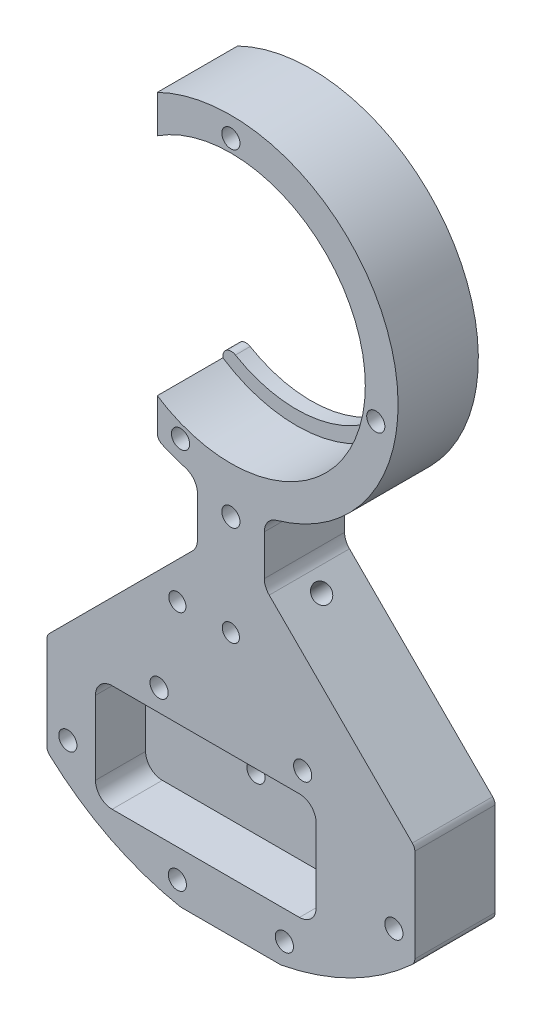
ISO-10303-21;
HEADER;
FILE_DESCRIPTION(('STEP AP214'),'2;1');
FILE_NAME('part.step','',(''),(''),'','','');
FILE_SCHEMA(('AUTOMOTIVE_DESIGN { 1 0 10303 214 1 1 1 1 }'));
ENDSEC;
DATA;
#1=APPLICATION_CONTEXT('core data for automotive mechanical design processes');
#2=APPLICATION_PROTOCOL_DEFINITION('international standard','automotive_design',2000,#1);
#3=PRODUCT_CONTEXT('',#1,'mechanical');
#4=PRODUCT('Part','Part','',(#3));
#5=PRODUCT_RELATED_PRODUCT_CATEGORY('part','',(#4));
#6=PRODUCT_DEFINITION_FORMATION('','',#4);
#7=PRODUCT_DEFINITION_CONTEXT('part definition',#1,'design');
#8=PRODUCT_DEFINITION('design','',#6,#7);
#9=PRODUCT_DEFINITION_SHAPE('','',#8);
#10=(LENGTH_UNIT() NAMED_UNIT(*) SI_UNIT(.MILLI.,.METRE.));
#11=(NAMED_UNIT(*) PLANE_ANGLE_UNIT() SI_UNIT($,.RADIAN.));
#12=(NAMED_UNIT(*) SI_UNIT($,.STERADIAN.) SOLID_ANGLE_UNIT());
#13=UNCERTAINTY_MEASURE_WITH_UNIT(LENGTH_MEASURE(1.E-05),#10,'distance_accuracy_value','');
#14=(GEOMETRIC_REPRESENTATION_CONTEXT(3) GLOBAL_UNCERTAINTY_ASSIGNED_CONTEXT((#13)) GLOBAL_UNIT_ASSIGNED_CONTEXT((#10,
#11,#12)) REPRESENTATION_CONTEXT('',''));
#15=CARTESIAN_POINT('',(0.,0.,0.));
#16=DIRECTION('',(0.,0.,1.));
#17=DIRECTION('',(1.,0.,0.));
#18=AXIS2_PLACEMENT_3D('',#15,#16,#17);
#19=CARTESIAN_POINT('',(-8.88178419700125E-13,-8.88178419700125E-13,-15.2400000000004));
#20=DIRECTION('',(0.,0.,0.999999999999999));
#21=DIRECTION('',(1.,0.,0.));
#22=AXIS2_PLACEMENT_3D('',#19,#20,#21);
#23=CYLINDRICAL_SURFACE('',#22,31.75);
#24=DIRECTION('',(0.,0.,0.999999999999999));
#25=VECTOR('',#24,1.);
#26=CARTESIAN_POINT('',(-13.9700000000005,28.5114292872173,-15.2400000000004));
#27=LINE('',#26,#25);
#28=CARTESIAN_POINT('',(-13.9700000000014,28.5114292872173,8.88178419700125E-13));
#29=VERTEX_POINT('',#28);
#30=CARTESIAN_POINT('',(-13.9700000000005,28.5114292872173,-15.2400000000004));
#31=VERTEX_POINT('',#30);
#32=EDGE_CURVE('E799',#29,#31,#27,.F.);
#33=ORIENTED_EDGE('',*,*,#32,.F.);
#34=CARTESIAN_POINT('',(0.,0.,0.));
#35=DIRECTION('',(0.,0.,1.));
#36=DIRECTION('',(1.,0.,0.));
#37=AXIS2_PLACEMENT_3D('',#34,#35,#36);
#38=CIRCLE('',#37,31.75);
#39=CARTESIAN_POINT('',(8.65909090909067,-30.5464015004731,0.));
#40=VERTEX_POINT('',#39);
#41=EDGE_CURVE('E410',#40,#29,#38,.T.);
#42=ORIENTED_EDGE('',*,*,#41,.F.);
#43=DIRECTION('',(0.,0.,0.999999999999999));
#44=VECTOR('',#43,1.);
#45=CARTESIAN_POINT('',(8.65909090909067,-30.5464015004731,-15.2399999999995));
#46=LINE('',#45,#44);
#47=CARTESIAN_POINT('',(8.65909090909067,-30.5464015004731,-15.2399999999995));
#48=VERTEX_POINT('',#47);
#49=EDGE_CURVE('E458',#40,#48,#46,.F.);
#50=ORIENTED_EDGE('',*,*,#49,.T.);
#51=CARTESIAN_POINT('',(-8.88178419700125E-13,-8.88178419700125E-13,-15.2400000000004));
#52=DIRECTION('',(0.,0.,1.));
#53=DIRECTION('',(1.,0.,0.));
#54=AXIS2_PLACEMENT_3D('',#51,#52,#53);
#55=CIRCLE('',#54,31.75);
#56=EDGE_CURVE('E379',#48,#31,#55,.T.);
#57=ORIENTED_EDGE('',*,*,#56,.T.);
#58=EDGE_LOOP('',(#33,#42,#50,#57));
#59=FACE_BOUND('',#58,.T.);
#60=ADVANCED_FACE('F36',(#59),#23,.T.);
#61=CARTESIAN_POINT('',(-8.88178419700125E-13,-8.88178419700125E-13,-15.2400000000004));
#62=DIRECTION('',(0.,0.,0.999999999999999));
#63=DIRECTION('',(1.,0.,0.));
#64=AXIS2_PLACEMENT_3D('',#61,#62,#63);
#65=CYLINDRICAL_SURFACE('',#64,22.86);
#66=CARTESIAN_POINT('',(-8.88178419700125E-13,-8.88178419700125E-13,-15.2400000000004));
#67=DIRECTION('',(0.,0.,1.));
#68=DIRECTION('',(1.,0.,0.));
#69=AXIS2_PLACEMENT_3D('',#66,#67,#68);
#70=CIRCLE('',#69,22.86);
#71=CARTESIAN_POINT('',(-11.5784415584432,-19.710892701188,-15.2400000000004));
#72=VERTEX_POINT('',#71);
#73=CARTESIAN_POINT('',(-11.5784415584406,19.710892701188,-15.2400000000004));
#74=VERTEX_POINT('',#73);
#75=EDGE_CURVE('E375',#72,#74,#70,.T.);
#76=ORIENTED_EDGE('',*,*,#75,.F.);
#77=DIRECTION('',(0.,0.,0.999999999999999));
#78=VECTOR('',#77,1.);
#79=CARTESIAN_POINT('',(-11.5784415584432,-19.710892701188,-15.2400000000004));
#80=LINE('',#79,#78);
#81=CARTESIAN_POINT('',(-11.5784415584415,-19.7108927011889,-12.4459999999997));
#82=VERTEX_POINT('',#81);
#83=EDGE_CURVE('E633',#72,#82,#80,.T.);
#84=ORIENTED_EDGE('',*,*,#83,.T.);
#85=CARTESIAN_POINT('',(0.,-4.44089209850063E-13,-12.4459999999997));
#86=DIRECTION('',(0.,0.,1.));
#87=DIRECTION('',(1.,0.,0.));
#88=AXIS2_PLACEMENT_3D('',#85,#86,#87);
#89=CIRCLE('',#88,22.86);
#90=CARTESIAN_POINT('',(-11.5784415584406,19.710892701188,-12.4459999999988));
#91=VERTEX_POINT('',#90);
#92=EDGE_CURVE('E372',#91,#82,#89,.F.);
#93=ORIENTED_EDGE('',*,*,#92,.F.);
#94=DIRECTION('',(0.,0.,0.999999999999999));
#95=VECTOR('',#94,1.);
#96=CARTESIAN_POINT('',(-11.5784415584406,19.710892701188,-15.2400000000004));
#97=LINE('',#96,#95);
#98=EDGE_CURVE('E630',#91,#74,#97,.F.);
#99=ORIENTED_EDGE('',*,*,#98,.T.);
#100=EDGE_LOOP('',(#76,#84,#93,#99));
#101=FACE_BOUND('',#100,.T.);
#102=ADVANCED_FACE('F746',(#101),#65,.F.);
#103=CARTESIAN_POINT('',(-13.0342105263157,-28.9511978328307,0.));
#104=VERTEX_POINT('',#103);
#105=CARTESIAN_POINT('',(-8.65909090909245,-30.5464015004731,8.88178419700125E-13));
#106=VERTEX_POINT('',#105);
#107=EDGE_CURVE('E378',#104,#106,#38,.T.);
#108=ORIENTED_EDGE('',*,*,#107,.F.);
#109=DIRECTION('',(0.,0.,0.999999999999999));
#110=VECTOR('',#109,1.);
#111=CARTESIAN_POINT('',(-13.0342105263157,-28.9511978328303,-15.2399999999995));
#112=LINE('',#111,#110);
#113=CARTESIAN_POINT('',(-13.0342105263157,-28.9511978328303,-15.2399999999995));
#114=VERTEX_POINT('',#113);
#115=EDGE_CURVE('E628',#104,#114,#112,.F.);
#116=ORIENTED_EDGE('',*,*,#115,.T.);
#117=CARTESIAN_POINT('',(-8.65909090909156,-30.5464015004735,-15.2399999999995));
#118=VERTEX_POINT('',#117);
#119=EDGE_CURVE('E383',#114,#118,#55,.T.);
#120=ORIENTED_EDGE('',*,*,#119,.T.);
#121=DIRECTION('',(0.,0.,0.999999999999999));
#122=VECTOR('',#121,1.);
#123=CARTESIAN_POINT('',(-8.65909090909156,-30.5464015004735,-15.2399999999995));
#124=LINE('',#123,#122);
#125=EDGE_CURVE('E455',#118,#106,#124,.T.);
#126=ORIENTED_EDGE('',*,*,#125,.T.);
#127=EDGE_LOOP('',(#108,#116,#120,#126));
#128=FACE_BOUND('',#127,.T.);
#129=ADVANCED_FACE('F749',(#128),#23,.T.);
#130=CARTESIAN_POINT('',(6.3500000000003,-42.6051663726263,-15.2400000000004));
#131=DIRECTION('',(0.999999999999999,0.,0.));
#132=DIRECTION('',(0.,0.,-1.));
#133=AXIS2_PLACEMENT_3D('',#130,#131,#132);
#134=PLANE('',#133);
#135=DIRECTION('',(0.,1.,0.));
#136=VECTOR('',#135,1.);
#137=CARTESIAN_POINT('',(6.34999999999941,-42.6051663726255,8.88178419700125E-13));
#138=LINE('',#137,#136);
#139=CARTESIAN_POINT('',(6.35000000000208,-41.2900383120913,0.));
#140=VERTEX_POINT('',#139);
#141=CARTESIAN_POINT('',(6.34999999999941,-33.6010416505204,0.));
#142=VERTEX_POINT('',#141);
#143=EDGE_CURVE('E436',#140,#142,#138,.T.);
#144=ORIENTED_EDGE('',*,*,#143,.F.);
#145=DIRECTION('',(0.,0.,1.));
#146=VECTOR('',#145,1.);
#147=CARTESIAN_POINT('',(6.3500000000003,-41.2900383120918,-15.2400000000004));
#148=LINE('',#147,#146);
#149=CARTESIAN_POINT('',(6.3500000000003,-41.2900383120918,-15.2400000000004));
#150=VERTEX_POINT('',#149);
#151=EDGE_CURVE('E453',#140,#150,#148,.F.);
#152=ORIENTED_EDGE('',*,*,#151,.T.);
#153=DIRECTION('',(0.,1.,0.));
#154=VECTOR('',#153,1.);
#155=CARTESIAN_POINT('',(6.3500000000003,-42.6051663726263,-15.2400000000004));
#156=LINE('',#155,#154);
#157=CARTESIAN_POINT('',(6.35000000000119,-33.6010416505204,-15.2400000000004));
#158=VERTEX_POINT('',#157);
#159=EDGE_CURVE('E406',#150,#158,#156,.T.);
#160=ORIENTED_EDGE('',*,*,#159,.T.);
#161=DIRECTION('',(0.,0.,-1.));
#162=VECTOR('',#161,1.);
#163=CARTESIAN_POINT('',(6.34999999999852,-33.6010416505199,-8.88178419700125E-13));
#164=LINE('',#163,#162);
#165=EDGE_CURVE('E450',#158,#142,#164,.F.);
#166=ORIENTED_EDGE('',*,*,#165,.T.);
#167=EDGE_LOOP('',(#144,#152,#160,#166));
#168=FACE_BOUND('',#167,.T.);
#169=ADVANCED_FACE('F759',(#168),#134,.T.);
#170=CARTESIAN_POINT('',(34.9249999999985,-71.1801663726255,-15.2400000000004));
#171=DIRECTION('',(0.707106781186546,0.707106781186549,0.));
#172=DIRECTION('',(-0.707106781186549,0.707106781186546,0.));
#173=AXIS2_PLACEMENT_3D('',#170,#171,#172);
#174=PLANE('',#173);
#175=CARTESIAN_POINT('',(9.61480256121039,-45.8699689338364,-7.62000000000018));
#176=DIRECTION('',(0.707106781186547,0.707106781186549,0.));
#177=DIRECTION('',(-0.707106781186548,0.707106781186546,0.));
#178=AXIS2_PLACEMENT_3D('',#175,#176,#177);
#179=CIRCLE('',#178,1.7272);
#180=CARTESIAN_POINT('',(8.39348772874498,-44.648654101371,-7.62000000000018));
#181=VERTEX_POINT('',#180);
#182=EDGE_CURVE('E339',#181,#181,#179,.T.);
#183=ORIENTED_EDGE('',*,*,#182,.F.);
#184=EDGE_LOOP('',(#183));
#185=FACE_BOUND('',#184,.T.);
#186=DIRECTION('',(-0.707106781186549,0.707106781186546,0.));
#187=VECTOR('',#186,1.);
#188=CARTESIAN_POINT('',(34.9249999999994,-71.1801663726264,0.));
#189=LINE('',#188,#187);
#190=CARTESIAN_POINT('',(34.4600320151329,-70.7151983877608,0.));
#191=VERTEX_POINT('',#190);
#192=CARTESIAN_POINT('',(7.27993596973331,-43.5351023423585,1.77635683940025E-12));
#193=VERTEX_POINT('',#192);
#194=EDGE_CURVE('E434',#191,#193,#189,.T.);
#195=ORIENTED_EDGE('',*,*,#194,.F.);
#196=DIRECTION('',(0.,0.,1.));
#197=VECTOR('',#196,1.);
#198=CARTESIAN_POINT('',(34.4600320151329,-70.715198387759,-15.2399999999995));
#199=LINE('',#198,#197);
#200=CARTESIAN_POINT('',(34.4600320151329,-70.715198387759,-15.2399999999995));
#201=VERTEX_POINT('',#200);
#202=EDGE_CURVE('E613',#191,#201,#199,.F.);
#203=ORIENTED_EDGE('',*,*,#202,.T.);
#204=DIRECTION('',(-0.707106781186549,0.707106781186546,0.));
#205=VECTOR('',#204,1.);
#206=CARTESIAN_POINT('',(34.9249999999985,-71.1801663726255,-15.2400000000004));
#207=LINE('',#206,#205);
#208=CARTESIAN_POINT('',(7.27993596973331,-43.5351023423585,-15.2400000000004));
#209=VERTEX_POINT('',#208);
#210=EDGE_CURVE('E404',#201,#209,#207,.T.);
#211=ORIENTED_EDGE('',*,*,#210,.T.);
#212=DIRECTION('',(0.,0.,1.));
#213=VECTOR('',#212,1.);
#214=CARTESIAN_POINT('',(7.27993596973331,-43.5351023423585,1.77635683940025E-12));
#215=LINE('',#214,#213);
#216=EDGE_CURVE('E447',#209,#193,#215,.T.);
#217=ORIENTED_EDGE('',*,*,#216,.T.);
#218=EDGE_LOOP('',(#195,#203,#211,#217));
#219=FACE_BOUND('',#218,.T.);
#220=ADVANCED_FACE('F764',(#185,#219),#174,.T.);
#221=CARTESIAN_POINT('',(34.9250000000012,-90.2301663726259,-15.2399999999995));
#222=DIRECTION('',(1.,0.,0.));
#223=DIRECTION('',(0.,1.,0.));
#224=AXIS2_PLACEMENT_3D('',#221,#222,#223);
#225=PLANE('',#224);
#226=DIRECTION('',(0.,1.,0.));
#227=VECTOR('',#226,1.);
#228=CARTESIAN_POINT('',(34.9250000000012,-90.2301663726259,-15.2399999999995));
#229=LINE('',#228,#227);
#230=CARTESIAN_POINT('',(34.9250000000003,-89.5405697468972,-15.2399999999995));
#231=VERTEX_POINT('',#230);
#232=CARTESIAN_POINT('',(34.9250000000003,-71.8377304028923,-15.2400000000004));
#233=VERTEX_POINT('',#232);
#234=EDGE_CURVE('E401',#231,#233,#229,.T.);
#235=ORIENTED_EDGE('',*,*,#234,.T.);
#236=DIRECTION('',(0.,0.,1.));
#237=VECTOR('',#236,1.);
#238=CARTESIAN_POINT('',(34.9250000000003,-71.8377304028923,-15.2400000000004));
#239=LINE('',#238,#237);
#240=CARTESIAN_POINT('',(34.9249999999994,-71.8377304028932,0.));
#241=VERTEX_POINT('',#240);
#242=EDGE_CURVE('E610',#233,#241,#239,.T.);
#243=ORIENTED_EDGE('',*,*,#242,.T.);
#244=DIRECTION('',(0.,1.,0.));
#245=VECTOR('',#244,1.);
#246=CARTESIAN_POINT('',(34.9250000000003,-90.2301663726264,8.88178419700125E-13));
#247=LINE('',#246,#245);
#248=CARTESIAN_POINT('',(34.9249999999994,-89.5405697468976,0.));
#249=VERTEX_POINT('',#248);
#250=EDGE_CURVE('E431',#249,#241,#247,.T.);
#251=ORIENTED_EDGE('',*,*,#250,.F.);
#252=DIRECTION('',(0.,0.,1.));
#253=VECTOR('',#252,1.);
#254=CARTESIAN_POINT('',(34.9250000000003,-89.5405697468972,-15.2399999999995));
#255=LINE('',#254,#253);
#256=EDGE_CURVE('E608',#249,#231,#255,.F.);
#257=ORIENTED_EDGE('',*,*,#256,.T.);
#258=EDGE_LOOP('',(#235,#243,#251,#257));
#259=FACE_BOUND('',#258,.T.);
#260=ADVANCED_FACE('F879',(#259),#225,.T.);
#261=CARTESIAN_POINT('',(-8.88178419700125E-13,-53.3399999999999,-15.2400000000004));
#262=DIRECTION('',(0.,0.,0.999999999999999));
#263=DIRECTION('',(1.,0.,0.));
#264=AXIS2_PLACEMENT_3D('',#261,#262,#263);
#265=CYLINDRICAL_SURFACE('',#264,50.8);
#266=CARTESIAN_POINT('',(8.88178419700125E-13,-53.3400000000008,1.77635683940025E-12));
#267=DIRECTION('',(0.,0.,1.));
#268=DIRECTION('',(1.,0.,0.));
#269=AXIS2_PLACEMENT_3D('',#266,#267,#268);
#270=CIRCLE('',#269,50.8);
#271=CARTESIAN_POINT('',(9.67601305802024,-103.209978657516,-8.88178419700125E-13));
#272=VERTEX_POINT('',#271);
#273=CARTESIAN_POINT('',(34.4129032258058,-90.7083300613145,0.));
#274=VERTEX_POINT('',#273);
#275=EDGE_CURVE('E428',#272,#274,#270,.T.);
#276=ORIENTED_EDGE('',*,*,#275,.F.);
#277=DIRECTION('',(0.,0.,0.999999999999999));
#278=VECTOR('',#277,1.);
#279=CARTESIAN_POINT('',(9.67601305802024,-103.209978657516,-15.2399999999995));
#280=LINE('',#279,#278);
#281=CARTESIAN_POINT('',(9.67601305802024,-103.209978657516,-15.2399999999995));
#282=VERTEX_POINT('',#281);
#283=EDGE_CURVE('E606',#272,#282,#280,.F.);
#284=ORIENTED_EDGE('',*,*,#283,.T.);
#285=CARTESIAN_POINT('',(-8.88178419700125E-13,-53.3399999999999,-15.2400000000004));
#286=DIRECTION('',(0.,0.,1.));
#287=DIRECTION('',(1.,0.,0.));
#288=AXIS2_PLACEMENT_3D('',#285,#286,#287);
#289=CIRCLE('',#288,50.8);
#290=CARTESIAN_POINT('',(34.4129032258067,-90.7083300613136,-15.2399999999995));
#291=VERTEX_POINT('',#290);
#292=EDGE_CURVE('E398',#282,#291,#289,.T.);
#293=ORIENTED_EDGE('',*,*,#292,.T.);
#294=DIRECTION('',(0.,0.,0.999999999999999));
#295=VECTOR('',#294,1.);
#296=CARTESIAN_POINT('',(34.4129032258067,-90.7083300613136,-15.2399999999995));
#297=LINE('',#296,#295);
#298=EDGE_CURVE('E603',#291,#274,#297,.T.);
#299=ORIENTED_EDGE('',*,*,#298,.T.);
#300=EDGE_LOOP('',(#276,#284,#293,#299));
#301=FACE_BOUND('',#300,.T.);
#302=ADVANCED_FACE('F883',(#301),#265,.T.);
#303=CARTESIAN_POINT('',(9.52500000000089,-103.239041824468,-15.2399999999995));
#304=DIRECTION('',(0.,-1.,0.));
#305=DIRECTION('',(0.,0.,-1.));
#306=AXIS2_PLACEMENT_3D('',#303,#304,#305);
#307=PLANE('',#306);
#308=DIRECTION('',(0.999999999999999,0.,0.));
#309=VECTOR('',#308,1.);
#310=CARTESIAN_POINT('',(9.52500000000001,-103.239041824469,0.));
#311=LINE('',#310,#309);
#312=CARTESIAN_POINT('',(-9.37363764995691,-103.239041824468,-1.77635683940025E-12));
#313=VERTEX_POINT('',#312);
#314=CARTESIAN_POINT('',(9.3736376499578,-103.239041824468,-8.88178419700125E-13));
#315=VERTEX_POINT('',#314);
#316=EDGE_CURVE('E425',#313,#315,#311,.T.);
#317=ORIENTED_EDGE('',*,*,#316,.F.);
#318=DIRECTION('',(0.,0.,1.));
#319=VECTOR('',#318,1.);
#320=CARTESIAN_POINT('',(-9.37363764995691,-103.239041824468,-15.2400000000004));
#321=LINE('',#320,#319);
#322=CARTESIAN_POINT('',(-9.37363764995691,-103.239041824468,-15.2400000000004));
#323=VERTEX_POINT('',#322);
#324=EDGE_CURVE('E583',#313,#323,#321,.F.);
#325=ORIENTED_EDGE('',*,*,#324,.T.);
#326=DIRECTION('',(0.999999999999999,0.,0.));
#327=VECTOR('',#326,1.);
#328=CARTESIAN_POINT('',(9.52500000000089,-103.239041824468,-15.2399999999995));
#329=LINE('',#328,#327);
#330=CARTESIAN_POINT('',(9.37363764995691,-103.239041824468,-15.2399999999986));
#331=VERTEX_POINT('',#330);
#332=EDGE_CURVE('E395',#323,#331,#329,.T.);
#333=ORIENTED_EDGE('',*,*,#332,.T.);
#334=DIRECTION('',(0.,0.,1.));
#335=VECTOR('',#334,1.);
#336=CARTESIAN_POINT('',(9.37363764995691,-103.239041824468,-15.2399999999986));
#337=LINE('',#336,#335);
#338=EDGE_CURVE('E580',#331,#315,#337,.T.);
#339=ORIENTED_EDGE('',*,*,#338,.T.);
#340=EDGE_LOOP('',(#317,#325,#333,#339));
#341=FACE_BOUND('',#340,.T.);
#342=ADVANCED_FACE('F887',(#341),#307,.T.);
#343=CARTESIAN_POINT('',(-8.88178419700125E-13,-53.3399999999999,-15.2400000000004));
#344=DIRECTION('',(0.,0.,0.999999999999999));
#345=DIRECTION('',(1.,0.,0.));
#346=AXIS2_PLACEMENT_3D('',#343,#344,#345);
#347=CYLINDRICAL_SURFACE('',#346,50.8);
#348=CARTESIAN_POINT('',(-8.88178419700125E-13,-53.3399999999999,-15.2400000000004));
#349=DIRECTION('',(0.,0.,1.));
#350=DIRECTION('',(1.,0.,0.));
#351=AXIS2_PLACEMENT_3D('',#348,#349,#350);
#352=CIRCLE('',#351,50.8);
#353=CARTESIAN_POINT('',(-34.4129032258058,-90.7083300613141,-15.2400000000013));
#354=VERTEX_POINT('',#353);
#355=CARTESIAN_POINT('',(-9.67601305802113,-103.209978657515,-15.2400000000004));
#356=VERTEX_POINT('',#355);
#357=EDGE_CURVE('E392',#354,#356,#352,.T.);
#358=ORIENTED_EDGE('',*,*,#357,.T.);
#359=DIRECTION('',(0.,0.,0.999999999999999));
#360=VECTOR('',#359,1.);
#361=CARTESIAN_POINT('',(-9.67601305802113,-103.209978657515,-15.2400000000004));
#362=LINE('',#361,#360);
#363=CARTESIAN_POINT('',(-9.67601305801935,-103.209978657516,0.));
#364=VERTEX_POINT('',#363);
#365=EDGE_CURVE('E563',#356,#364,#362,.T.);
#366=ORIENTED_EDGE('',*,*,#365,.T.);
#367=CARTESIAN_POINT('',(8.88178419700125E-13,-53.3400000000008,1.77635683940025E-12));
#368=DIRECTION('',(0.,0.,1.));
#369=DIRECTION('',(1.,0.,0.));
#370=AXIS2_PLACEMENT_3D('',#367,#368,#369);
#371=CIRCLE('',#370,50.8);
#372=CARTESIAN_POINT('',(-34.4129032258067,-90.7083300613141,8.88178419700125E-13));
#373=VERTEX_POINT('',#372);
#374=EDGE_CURVE('E422',#373,#364,#371,.T.);
#375=ORIENTED_EDGE('',*,*,#374,.F.);
#376=DIRECTION('',(0.,0.,0.999999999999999));
#377=VECTOR('',#376,1.);
#378=CARTESIAN_POINT('',(-34.4129032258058,-90.7083300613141,-15.2400000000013));
#379=LINE('',#378,#377);
#380=EDGE_CURVE('E561',#373,#354,#379,.F.);
#381=ORIENTED_EDGE('',*,*,#380,.T.);
#382=EDGE_LOOP('',(#358,#366,#375,#381));
#383=FACE_BOUND('',#382,.T.);
#384=ADVANCED_FACE('F891',(#383),#347,.T.);
#385=CARTESIAN_POINT('',(-34.9249999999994,-71.1801663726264,-15.2399999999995));
#386=DIRECTION('',(-0.999999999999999,0.,0.));
#387=DIRECTION('',(0.,-1.,0.));
#388=AXIS2_PLACEMENT_3D('',#385,#386,#387);
#389=PLANE('',#388);
#390=DIRECTION('',(0.,-1.,0.));
#391=VECTOR('',#390,1.);
#392=CARTESIAN_POINT('',(-34.9249999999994,-71.1801663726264,-15.2399999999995));
#393=LINE('',#392,#391);
#394=CARTESIAN_POINT('',(-34.9250000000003,-71.8377304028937,-15.2399999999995));
#395=VERTEX_POINT('',#394);
#396=CARTESIAN_POINT('',(-34.9250000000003,-89.5405697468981,-15.2400000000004));
#397=VERTEX_POINT('',#396);
#398=EDGE_CURVE('E389',#395,#397,#393,.T.);
#399=ORIENTED_EDGE('',*,*,#398,.T.);
#400=DIRECTION('',(0.,0.,1.));
#401=VECTOR('',#400,1.);
#402=CARTESIAN_POINT('',(-34.9250000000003,-89.5405697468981,-15.2400000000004));
#403=LINE('',#402,#401);
#404=CARTESIAN_POINT('',(-34.9249999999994,-89.5405697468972,0.));
#405=VERTEX_POINT('',#404);
#406=EDGE_CURVE('E617',#397,#405,#403,.T.);
#407=ORIENTED_EDGE('',*,*,#406,.T.);
#408=DIRECTION('',(0.,-1.,0.));
#409=VECTOR('',#408,1.);
#410=CARTESIAN_POINT('',(-34.9249999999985,-71.1801663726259,1.77635683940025E-12));
#411=LINE('',#410,#409);
#412=CARTESIAN_POINT('',(-34.9249999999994,-71.8377304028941,-1.77635683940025E-12));
#413=VERTEX_POINT('',#412);
#414=EDGE_CURVE('E419',#413,#405,#411,.T.);
#415=ORIENTED_EDGE('',*,*,#414,.F.);
#416=DIRECTION('',(0.,0.,1.));
#417=VECTOR('',#416,1.);
#418=CARTESIAN_POINT('',(-34.9250000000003,-71.8377304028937,-15.2399999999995));
#419=LINE('',#418,#417);
#420=EDGE_CURVE('E615',#413,#395,#419,.F.);
#421=ORIENTED_EDGE('',*,*,#420,.T.);
#422=EDGE_LOOP('',(#399,#407,#415,#421));
#423=FACE_BOUND('',#422,.T.);
#424=ADVANCED_FACE('F895',(#423),#389,.T.);
#425=CARTESIAN_POINT('',(-6.34999999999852,-42.6051663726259,-15.2400000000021));
#426=DIRECTION('',(-0.707106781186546,0.707106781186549,0.));
#427=DIRECTION('',(-0.707106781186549,-0.707106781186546,0.));
#428=AXIS2_PLACEMENT_3D('',#425,#426,#427);
#429=PLANE('',#428);
#430=DIRECTION('',(-0.707106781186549,-0.707106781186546,0.));
#431=VECTOR('',#430,1.);
#432=CARTESIAN_POINT('',(-6.34999999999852,-42.6051663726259,-15.2400000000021));
#433=LINE('',#432,#431);
#434=CARTESIAN_POINT('',(-7.27993596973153,-43.5351023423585,-15.2399999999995));
#435=VERTEX_POINT('',#434);
#436=CARTESIAN_POINT('',(-34.4600320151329,-70.715198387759,-15.2399999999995));
#437=VERTEX_POINT('',#436);
#438=EDGE_CURVE('E386',#435,#437,#433,.T.);
#439=ORIENTED_EDGE('',*,*,#438,.T.);
#440=DIRECTION('',(0.,0.,1.));
#441=VECTOR('',#440,1.);
#442=CARTESIAN_POINT('',(-34.4600320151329,-70.715198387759,-15.2399999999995));
#443=LINE('',#442,#441);
#444=CARTESIAN_POINT('',(-34.4600320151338,-70.7151983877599,8.88178419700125E-13));
#445=VERTEX_POINT('',#444);
#446=EDGE_CURVE('E620',#437,#445,#443,.T.);
#447=ORIENTED_EDGE('',*,*,#446,.T.);
#448=DIRECTION('',(-0.707106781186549,-0.707106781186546,0.));
#449=VECTOR('',#448,1.);
#450=CARTESIAN_POINT('',(-6.34999999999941,-42.6051663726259,0.));
#451=LINE('',#450,#449);
#452=CARTESIAN_POINT('',(-7.27993596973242,-43.5351023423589,0.));
#453=VERTEX_POINT('',#452);
#454=EDGE_CURVE('E416',#453,#445,#451,.T.);
#455=ORIENTED_EDGE('',*,*,#454,.F.);
#456=DIRECTION('',(0.,0.,1.));
#457=VECTOR('',#456,1.);
#458=CARTESIAN_POINT('',(-7.27993596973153,-43.5351023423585,-15.2399999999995));
#459=LINE('',#458,#457);
#460=EDGE_CURVE('E445',#453,#435,#459,.F.);
#461=ORIENTED_EDGE('',*,*,#460,.T.);
#462=EDGE_LOOP('',(#439,#447,#455,#461));
#463=FACE_BOUND('',#462,.T.);
#464=ADVANCED_FACE('F899',(#463),#429,.T.);
#465=CARTESIAN_POINT('',(-6.35000000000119,-31.1085197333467,-15.2400000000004));
#466=DIRECTION('',(-0.999999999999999,0.,0.));
#467=DIRECTION('',(0.,0.,1.));
#468=AXIS2_PLACEMENT_3D('',#465,#466,#467);
#469=PLANE('',#468);
#470=DIRECTION('',(0.,-1.,0.));
#471=VECTOR('',#470,1.);
#472=CARTESIAN_POINT('',(-6.35000000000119,-31.1085197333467,-15.2400000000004));
#473=LINE('',#472,#471);
#474=CARTESIAN_POINT('',(-6.34999999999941,-33.6010416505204,-15.2400000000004));
#475=VERTEX_POINT('',#474);
#476=CARTESIAN_POINT('',(-6.34999999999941,-41.2900383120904,-15.2400000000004));
#477=VERTEX_POINT('',#476);
#478=EDGE_CURVE('E382',#475,#477,#473,.T.);
#479=ORIENTED_EDGE('',*,*,#478,.T.);
#480=DIRECTION('',(0.,0.,1.));
#481=VECTOR('',#480,1.);
#482=CARTESIAN_POINT('',(-6.34999999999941,-41.2900383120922,8.88178419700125E-13));
#483=LINE('',#482,#481);
#484=CARTESIAN_POINT('',(-6.34999999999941,-41.2900383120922,8.88178419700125E-13));
#485=VERTEX_POINT('',#484);
#486=EDGE_CURVE('E442',#477,#485,#483,.T.);
#487=ORIENTED_EDGE('',*,*,#486,.T.);
#488=DIRECTION('',(0.,-1.,0.));
#489=VECTOR('',#488,1.);
#490=CARTESIAN_POINT('',(-6.34999999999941,-31.1085197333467,0.));
#491=LINE('',#490,#489);
#492=CARTESIAN_POINT('',(-6.34999999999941,-33.6010416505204,8.88178419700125E-13));
#493=VERTEX_POINT('',#492);
#494=EDGE_CURVE('E413',#493,#485,#491,.T.);
#495=ORIENTED_EDGE('',*,*,#494,.F.);
#496=DIRECTION('',(0.,0.,-1.));
#497=VECTOR('',#496,1.);
#498=CARTESIAN_POINT('',(-6.34999999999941,-33.6010416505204,-15.2400000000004));
#499=LINE('',#498,#497);
#500=EDGE_CURVE('E409',#493,#475,#499,.T.);
#501=ORIENTED_EDGE('',*,*,#500,.T.);
#502=EDGE_LOOP('',(#479,#487,#495,#501));
#503=FACE_BOUND('',#502,.T.);
#504=ADVANCED_FACE('F874',(#503),#469,.T.);
#505=CARTESIAN_POINT('',(-8.88178419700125E-13,-8.88178419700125E-13,-15.2400000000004));
#506=DIRECTION('',(0.,0.,1.));
#507=DIRECTION('',(1.,0.,0.));
#508=AXIS2_PLACEMENT_3D('',#505,#506,#507);
#509=PLANE('',#508);
#510=CARTESIAN_POINT('',(0.,-34.2780418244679,-15.2400000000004));
#511=DIRECTION('',(0.,0.,-1.));
#512=DIRECTION('',(-1.,0.,0.));
#513=AXIS2_PLACEMENT_3D('',#510,#511,#512);
#514=CIRCLE('',#513,1.72719999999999);
#515=CARTESIAN_POINT('',(-1.72719999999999,-34.2780418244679,-15.2400000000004));
#516=VERTEX_POINT('',#515);
#517=EDGE_CURVE('E338',#516,#516,#514,.T.);
#518=ORIENTED_EDGE('',*,*,#517,.F.);
#519=EDGE_LOOP('',(#518));
#520=FACE_BOUND('',#519,.T.);
#521=DIRECTION('',(0.,-1.,0.));
#522=VECTOR('',#521,1.);
#523=CARTESIAN_POINT('',(5.52449999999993,-28.1820418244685,-15.2399999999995));
#524=LINE('',#523,#522);
#525=CARTESIAN_POINT('',(5.52450000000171,-28.9757918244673,-15.2399999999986));
#526=VERTEX_POINT('',#525);
#527=CARTESIAN_POINT('',(5.52450000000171,-30.8172918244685,-15.2399999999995));
#528=VERTEX_POINT('',#527);
#529=EDGE_CURVE('E1479',#526,#528,#524,.T.);
#530=ORIENTED_EDGE('',*,*,#529,.F.);
#531=CARTESIAN_POINT('',(4.73075000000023,-28.9757918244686,-15.2399999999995));
#532=DIRECTION('',(0.,0.,1.));
#533=DIRECTION('',(1.,0.,0.));
#534=AXIS2_PLACEMENT_3D('',#531,#532,#533);
#535=CIRCLE('',#534,0.79375);
#536=CARTESIAN_POINT('',(4.73075000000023,-28.182041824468,-15.2399999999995));
#537=VERTEX_POINT('',#536);
#538=EDGE_CURVE('E559',#526,#537,#535,.T.);
#539=ORIENTED_EDGE('',*,*,#538,.T.);
#540=DIRECTION('',(0.999999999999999,0.,0.));
#541=VECTOR('',#540,1.);
#542=CARTESIAN_POINT('',(3.80999999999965,-28.182041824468,-15.2399999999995));
#543=LINE('',#542,#541);
#544=CARTESIAN_POINT('',(-4.73075000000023,-28.1820418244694,-15.2399999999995));
#545=VERTEX_POINT('',#544);
#546=EDGE_CURVE('E1469',#545,#537,#543,.T.);
#547=ORIENTED_EDGE('',*,*,#546,.F.);
#548=CARTESIAN_POINT('',(-4.73075000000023,-28.9757918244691,-15.2400000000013));
#549=DIRECTION('',(0.,0.,1.));
#550=DIRECTION('',(1.,0.,0.));
#551=AXIS2_PLACEMENT_3D('',#548,#549,#550);
#552=CIRCLE('',#551,0.79375);
#553=CARTESIAN_POINT('',(-5.52449999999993,-28.9757918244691,-15.2400000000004));
#554=VERTEX_POINT('',#553);
#555=EDGE_CURVE('E553',#545,#554,#552,.T.);
#556=ORIENTED_EDGE('',*,*,#555,.T.);
#557=DIRECTION('',(0.,1.,0.));
#558=VECTOR('',#557,1.);
#559=CARTESIAN_POINT('',(-5.52449999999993,-31.6110418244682,-15.2399999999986));
#560=LINE('',#559,#558);
#561=CARTESIAN_POINT('',(-5.52450000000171,-30.817291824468,-15.2400000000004));
#562=VERTEX_POINT('',#561);
#563=EDGE_CURVE('E1473',#562,#554,#560,.T.);
#564=ORIENTED_EDGE('',*,*,#563,.F.);
#565=CARTESIAN_POINT('',(-4.73075000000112,-30.817291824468,-15.2400000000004));
#566=DIRECTION('',(0.,0.,1.));
#567=DIRECTION('',(1.,0.,0.));
#568=AXIS2_PLACEMENT_3D('',#565,#566,#567);
#569=CIRCLE('',#568,0.79375);
#570=CARTESIAN_POINT('',(-4.73075000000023,-31.6110418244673,-15.2399999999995));
#571=VERTEX_POINT('',#570);
#572=EDGE_CURVE('E555',#562,#571,#569,.T.);
#573=ORIENTED_EDGE('',*,*,#572,.T.);
#574=DIRECTION('',(-1.,0.,0.));
#575=VECTOR('',#574,1.);
#576=CARTESIAN_POINT('',(-3.80999999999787,-31.6110418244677,-15.2400000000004));
#577=LINE('',#576,#575);
#578=CARTESIAN_POINT('',(4.73074999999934,-31.6110418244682,-15.2400000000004));
#579=VERTEX_POINT('',#578);
#580=EDGE_CURVE('E1476',#579,#571,#577,.T.);
#581=ORIENTED_EDGE('',*,*,#580,.F.);
#582=CARTESIAN_POINT('',(4.73075000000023,-30.817291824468,-15.2399999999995));
#583=DIRECTION('',(0.,0.,1.));
#584=DIRECTION('',(1.,0.,0.));
#585=AXIS2_PLACEMENT_3D('',#582,#583,#584);
#586=CIRCLE('',#585,0.79375);
#587=EDGE_CURVE('E557',#579,#528,#586,.T.);
#588=ORIENTED_EDGE('',*,*,#587,.T.);
#589=EDGE_LOOP('',(#530,#539,#547,#556,#564,#573,#581,#588));
#590=FACE_BOUND('',#589,.T.);
#591=CARTESIAN_POINT('',(-4.76249999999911,-83.5024999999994,-15.2399999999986));
#592=DIRECTION('',(0.,0.,1.));
#593=DIRECTION('',(1.,0.,0.));
#594=AXIS2_PLACEMENT_3D('',#591,#592,#593);
#595=CIRCLE('',#594,1.7272);
#596=CARTESIAN_POINT('',(-3.03530000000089,-83.5025000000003,-15.2399999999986));
#597=VERTEX_POINT('',#596);
#598=EDGE_CURVE('E488',#597,#597,#595,.T.);
#599=ORIENTED_EDGE('',*,*,#598,.T.);
#600=EDGE_LOOP('',(#599));
#601=FACE_BOUND('',#600,.T.);
#602=CARTESIAN_POINT('',(-9.55604280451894,-26.2550118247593,-15.2400000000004));
#603=DIRECTION('',(0.,0.,1.));
#604=DIRECTION('',(1.,0.,0.));
#605=AXIS2_PLACEMENT_3D('',#602,#603,#604);
#606=CIRCLE('',#605,1.7272);
#607=CARTESIAN_POINT('',(-7.82884280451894,-26.2550118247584,-15.2400000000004));
#608=VERTEX_POINT('',#607);
#609=EDGE_CURVE('E805',#608,#608,#606,.T.);
#610=ORIENTED_EDGE('',*,*,#609,.T.);
#611=EDGE_LOOP('',(#610));
#612=FACE_BOUND('',#611,.T.);
#613=CARTESIAN_POINT('',(-8.88178419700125E-13,27.9399999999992,-15.2399999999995));
#614=DIRECTION('',(0.,0.,1.));
#615=DIRECTION('',(1.,0.,0.));
#616=AXIS2_PLACEMENT_3D('',#613,#614,#615);
#617=CIRCLE('',#616,1.7272);
#618=CARTESIAN_POINT('',(1.72720000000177,27.9399999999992,-15.2399999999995));
#619=VERTEX_POINT('',#618);
#620=EDGE_CURVE('E811',#619,#619,#617,.T.);
#621=ORIENTED_EDGE('',*,*,#620,.T.);
#622=EDGE_LOOP('',(#621));
#623=FACE_BOUND('',#622,.T.);
#624=CARTESIAN_POINT('',(27.5155286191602,-4.85173008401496,-15.2400000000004));
#625=DIRECTION('',(0.,0.,1.));
#626=DIRECTION('',(1.,0.,0.));
#627=AXIS2_PLACEMENT_3D('',#624,#625,#626);
#628=CIRCLE('',#627,1.72719999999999);
#629=CARTESIAN_POINT('',(29.2427286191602,-4.85173008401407,-15.2400000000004));
#630=VERTEX_POINT('',#629);
#631=EDGE_CURVE('E817',#630,#630,#628,.T.);
#632=ORIENTED_EDGE('',*,*,#631,.T.);
#633=EDGE_LOOP('',(#632));
#634=FACE_BOUND('',#633,.T.);
#635=CARTESIAN_POINT('',(-13.6299359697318,-69.2149999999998,-15.2399999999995));
#636=DIRECTION('',(0.,0.,1.));
#637=DIRECTION('',(1.,0.,0.));
#638=AXIS2_PLACEMENT_3D('',#635,#636,#637);
#639=CIRCLE('',#638,1.7272);
#640=CARTESIAN_POINT('',(-11.9027359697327,-69.2149999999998,-15.2399999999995));
#641=VERTEX_POINT('',#640);
#642=EDGE_CURVE('E823',#641,#641,#639,.T.);
#643=ORIENTED_EDGE('',*,*,#642,.T.);
#644=EDGE_LOOP('',(#643));
#645=FACE_BOUND('',#644,.T.);
#646=CARTESIAN_POINT('',(-30.95625,-86.5413140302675,-15.2399999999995));
#647=DIRECTION('',(0.,0.,1.));
#648=DIRECTION('',(1.,0.,0.));
#649=AXIS2_PLACEMENT_3D('',#646,#647,#648);
#650=CIRCLE('',#649,1.72719999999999);
#651=CARTESIAN_POINT('',(-29.2290500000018,-86.5413140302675,-15.2399999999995));
#652=VERTEX_POINT('',#651);
#653=EDGE_CURVE('E829',#652,#652,#650,.T.);
#654=ORIENTED_EDGE('',*,*,#653,.T.);
#655=EDGE_LOOP('',(#654));
#656=FACE_BOUND('',#655,.T.);
#657=CARTESIAN_POINT('',(-10.1600000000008,-99.0600000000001,-15.2399999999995));
#658=DIRECTION('',(0.,0.,1.));
#659=DIRECTION('',(1.,0.,0.));
#660=AXIS2_PLACEMENT_3D('',#657,#658,#659);
#661=CIRCLE('',#660,1.7272);
#662=CARTESIAN_POINT('',(-8.43279999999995,-99.0600000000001,-15.2399999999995));
#663=VERTEX_POINT('',#662);
#664=EDGE_CURVE('E835',#663,#663,#661,.T.);
#665=ORIENTED_EDGE('',*,*,#664,.T.);
#666=EDGE_LOOP('',(#665));
#667=FACE_BOUND('',#666,.T.);
#668=CARTESIAN_POINT('',(13.6299359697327,-69.2150000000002,-15.2399999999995));
#669=DIRECTION('',(0.,0.,1.));
#670=DIRECTION('',(1.,0.,0.));
#671=AXIS2_PLACEMENT_3D('',#668,#669,#670);
#672=CIRCLE('',#671,1.7272);
#673=CARTESIAN_POINT('',(15.3571359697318,-69.2150000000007,-15.2399999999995));
#674=VERTEX_POINT('',#673);
#675=EDGE_CURVE('E841',#674,#674,#672,.T.);
#676=ORIENTED_EDGE('',*,*,#675,.T.);
#677=EDGE_LOOP('',(#676));
#678=FACE_BOUND('',#677,.T.);
#679=CARTESIAN_POINT('',(30.9562499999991,-86.541314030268,-15.2400000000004));
#680=DIRECTION('',(0.,0.,1.));
#681=DIRECTION('',(1.,0.,0.));
#682=AXIS2_PLACEMENT_3D('',#679,#680,#681);
#683=CIRCLE('',#682,1.7272);
#684=CARTESIAN_POINT('',(32.6834500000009,-86.5413140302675,-15.2400000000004));
#685=VERTEX_POINT('',#684);
#686=EDGE_CURVE('E847',#685,#685,#683,.T.);
#687=ORIENTED_EDGE('',*,*,#686,.T.);
#688=EDGE_LOOP('',(#687));
#689=FACE_BOUND('',#688,.T.);
#690=CARTESIAN_POINT('',(10.1599999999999,-99.0599999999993,-15.2399999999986));
#691=DIRECTION('',(0.,0.,1.));
#692=DIRECTION('',(1.,0.,0.));
#693=AXIS2_PLACEMENT_3D('',#690,#691,#692);
#694=CIRCLE('',#693,1.7272);
#695=CARTESIAN_POINT('',(11.8871999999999,-99.0599999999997,-15.2399999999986));
#696=VERTEX_POINT('',#695);
#697=EDGE_CURVE('E354',#696,#696,#694,.T.);
#698=ORIENTED_EDGE('',*,*,#697,.T.);
#699=EDGE_LOOP('',(#698));
#700=FACE_BOUND('',#699,.T.);
#701=CARTESIAN_POINT('',(-8.88178419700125E-13,-53.3399999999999,-15.2400000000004));
#702=DIRECTION('',(0.,0.,1.));
#703=DIRECTION('',(1.,0.,0.));
#704=AXIS2_PLACEMENT_3D('',#701,#702,#703);
#705=CIRCLE('',#704,1.63195);
#706=CARTESIAN_POINT('',(1.63194999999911,-53.3399999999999,-15.2400000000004));
#707=VERTEX_POINT('',#706);
#708=EDGE_CURVE('E349',#707,#707,#705,.T.);
#709=ORIENTED_EDGE('',*,*,#708,.T.);
#710=EDGE_LOOP('',(#709));
#711=FACE_BOUND('',#710,.T.);
#712=CARTESIAN_POINT('',(-10.1599999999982,-53.3399999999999,-15.2399999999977));
#713=DIRECTION('',(0.,0.,1.));
#714=DIRECTION('',(1.,0.,0.));
#715=AXIS2_PLACEMENT_3D('',#712,#713,#714);
#716=CIRCLE('',#715,1.63195);
#717=CARTESIAN_POINT('',(-8.52805000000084,-53.3399999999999,-15.2399999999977));
#718=VERTEX_POINT('',#717);
#719=EDGE_CURVE('E365',#718,#718,#716,.T.);
#720=ORIENTED_EDGE('',*,*,#719,.T.);
#721=EDGE_LOOP('',(#720));
#722=FACE_BOUND('',#721,.T.);
#723=ORIENTED_EDGE('',*,*,#332,.F.);
#724=CARTESIAN_POINT('',(-9.37363764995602,-101.651541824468,-15.2399999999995));
#725=DIRECTION('',(0.,0.,1.));
#726=DIRECTION('',(1.,0.,0.));
#727=AXIS2_PLACEMENT_3D('',#724,#725,#726);
#728=CIRCLE('',#727,1.5875);
#729=EDGE_CURVE('E601',#323,#356,#728,.F.);
#730=ORIENTED_EDGE('',*,*,#729,.T.);
#731=ORIENTED_EDGE('',*,*,#357,.F.);
#732=CARTESIAN_POINT('',(-33.3374999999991,-89.5405697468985,-15.2399999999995));
#733=DIRECTION('',(0.,0.,1.));
#734=DIRECTION('',(1.,0.,0.));
#735=AXIS2_PLACEMENT_3D('',#732,#733,#734);
#736=CIRCLE('',#735,1.5875);
#737=EDGE_CURVE('E593',#354,#397,#736,.F.);
#738=ORIENTED_EDGE('',*,*,#737,.T.);
#739=ORIENTED_EDGE('',*,*,#398,.F.);
#740=CARTESIAN_POINT('',(-33.3375,-71.8377304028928,-15.2400000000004));
#741=DIRECTION('',(0.,0.,1.));
#742=DIRECTION('',(1.,0.,0.));
#743=AXIS2_PLACEMENT_3D('',#740,#741,#742);
#744=CIRCLE('',#743,1.5875);
#745=EDGE_CURVE('E591',#395,#437,#744,.F.);
#746=ORIENTED_EDGE('',*,*,#745,.T.);
#747=ORIENTED_EDGE('',*,*,#438,.F.);
#748=CARTESIAN_POINT('',(-9.52500000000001,-41.2900383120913,-15.2399999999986));
#749=DIRECTION('',(0.,0.,1.));
#750=DIRECTION('',(1.,0.,0.));
#751=AXIS2_PLACEMENT_3D('',#748,#749,#750);
#752=CIRCLE('',#751,3.175);
#753=EDGE_CURVE('E462',#435,#477,#752,.T.);
#754=ORIENTED_EDGE('',*,*,#753,.T.);
#755=ORIENTED_EDGE('',*,*,#478,.F.);
#756=CARTESIAN_POINT('',(-9.52500000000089,-33.6010416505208,-15.2399999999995));
#757=DIRECTION('',(0.,0.,1.));
#758=DIRECTION('',(1.,0.,0.));
#759=AXIS2_PLACEMENT_3D('',#756,#757,#758);
#760=CIRCLE('',#759,3.175);
#761=EDGE_CURVE('E475',#475,#118,#760,.T.);
#762=ORIENTED_EDGE('',*,*,#761,.T.);
#763=ORIENTED_EDGE('',*,*,#119,.F.);
#764=CARTESIAN_POINT('',(-12.3824999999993,-27.5036379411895,-15.2399999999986));
#765=DIRECTION('',(0.,0.,1.));
#766=DIRECTION('',(1.,0.,0.));
#767=AXIS2_PLACEMENT_3D('',#764,#765,#766);
#768=CIRCLE('',#767,1.5875);
#769=CARTESIAN_POINT('',(-13.9700000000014,-27.5036379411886,-15.2400000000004));
#770=VERTEX_POINT('',#769);
#771=EDGE_CURVE('E589',#114,#770,#768,.F.);
#772=ORIENTED_EDGE('',*,*,#771,.T.);
#773=DIRECTION('',(0.,1.,0.));
#774=VECTOR('',#773,1.);
#775=CARTESIAN_POINT('',(-13.9700000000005,34.8370289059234,-15.2399999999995));
#776=LINE('',#775,#774);
#777=CARTESIAN_POINT('',(-13.9699999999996,-21.0797046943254,-15.2400000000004));
#778=VERTEX_POINT('',#777);
#779=EDGE_CURVE('E782',#770,#778,#776,.T.);
#780=ORIENTED_EDGE('',*,*,#779,.T.);
#781=CARTESIAN_POINT('',(-12.3825000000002,-21.0797046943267,-15.2399999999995));
#782=DIRECTION('',(0.,0.,1.));
#783=DIRECTION('',(1.,0.,0.));
#784=AXIS2_PLACEMENT_3D('',#781,#782,#783);
#785=CIRCLE('',#784,1.5875);
#786=EDGE_CURVE('E587',#778,#72,#785,.F.);
#787=ORIENTED_EDGE('',*,*,#786,.T.);
#788=ORIENTED_EDGE('',*,*,#75,.T.);
#789=CARTESIAN_POINT('',(-12.3824999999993,21.0797046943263,-15.2400000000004));
#790=DIRECTION('',(0.,0.,1.));
#791=DIRECTION('',(1.,0.,0.));
#792=AXIS2_PLACEMENT_3D('',#789,#790,#791);
#793=CIRCLE('',#792,1.5875);
#794=CARTESIAN_POINT('',(-13.9700000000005,21.0797046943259,-15.2399999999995));
#795=VERTEX_POINT('',#794);
#796=EDGE_CURVE('E585',#74,#795,#793,.F.);
#797=ORIENTED_EDGE('',*,*,#796,.T.);
#798=EDGE_CURVE('E789',#795,#31,#776,.T.);
#799=ORIENTED_EDGE('',*,*,#798,.T.);
#800=ORIENTED_EDGE('',*,*,#56,.F.);
#801=CARTESIAN_POINT('',(9.52499999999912,-33.6010416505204,-15.2399999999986));
#802=DIRECTION('',(0.,0.,1.));
#803=DIRECTION('',(1.,0.,0.));
#804=AXIS2_PLACEMENT_3D('',#801,#802,#803);
#805=CIRCLE('',#804,3.175);
#806=EDGE_CURVE('E471',#48,#158,#805,.T.);
#807=ORIENTED_EDGE('',*,*,#806,.T.);
#808=ORIENTED_EDGE('',*,*,#159,.F.);
#809=CARTESIAN_POINT('',(9.52500000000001,-41.2900383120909,-15.2400000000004));
#810=DIRECTION('',(0.,0.,1.));
#811=DIRECTION('',(1.,0.,0.));
#812=AXIS2_PLACEMENT_3D('',#809,#810,#811);
#813=CIRCLE('',#812,3.175);
#814=EDGE_CURVE('E466',#150,#209,#813,.T.);
#815=ORIENTED_EDGE('',*,*,#814,.T.);
#816=ORIENTED_EDGE('',*,*,#210,.F.);
#817=CARTESIAN_POINT('',(33.3375,-71.8377304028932,-15.2399999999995));
#818=DIRECTION('',(0.,0.,1.));
#819=DIRECTION('',(1.,0.,0.));
#820=AXIS2_PLACEMENT_3D('',#817,#818,#819);
#821=CIRCLE('',#820,1.5875);
#822=EDGE_CURVE('E597',#201,#233,#821,.F.);
#823=ORIENTED_EDGE('',*,*,#822,.T.);
#824=ORIENTED_EDGE('',*,*,#234,.F.);
#825=CARTESIAN_POINT('',(33.3375,-89.5405697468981,-15.2399999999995));
#826=DIRECTION('',(0.,0.,1.));
#827=DIRECTION('',(1.,0.,0.));
#828=AXIS2_PLACEMENT_3D('',#825,#826,#827);
#829=CIRCLE('',#828,1.5875);
#830=EDGE_CURVE('E595',#231,#291,#829,.F.);
#831=ORIENTED_EDGE('',*,*,#830,.T.);
#832=ORIENTED_EDGE('',*,*,#292,.F.);
#833=CARTESIAN_POINT('',(9.37363764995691,-101.651541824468,-15.2400000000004));
#834=DIRECTION('',(0.,0.,1.));
#835=DIRECTION('',(1.,0.,0.));
#836=AXIS2_PLACEMENT_3D('',#833,#834,#835);
#837=CIRCLE('',#836,1.5875);
#838=EDGE_CURVE('E599',#282,#331,#837,.F.);
#839=ORIENTED_EDGE('',*,*,#838,.T.);
#840=EDGE_LOOP('',(#723,#730,#731,#738,#739,#746,#747,#754,#755,#762,#763,#772,#780,#787,#788,
#797,#799,#800,#807,#808,#815,#816,#823,#824,#831,#832,#839));
#841=FACE_BOUND('',#840,.T.);
#842=ADVANCED_FACE('F781',(#520,#590,#601,#612,#623,#634,#645,#656,#667,#678,#689,#700,#711,
#722,#841),#509,.F.);
#843=CARTESIAN_POINT('',(0.,0.,0.));
#844=DIRECTION('',(0.,0.,1.));
#845=DIRECTION('',(1.,0.,0.));
#846=AXIS2_PLACEMENT_3D('',#843,#844,#845);
#847=PLANE('',#846);
#848=CARTESIAN_POINT('',(8.88178419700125E-13,-34.2780418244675,1.77635683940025E-12));
#849=DIRECTION('',(0.,0.,-1.));
#850=DIRECTION('',(-1.,0.,0.));
#851=AXIS2_PLACEMENT_3D('',#848,#849,#850);
#852=CIRCLE('',#851,1.7272);
#853=CARTESIAN_POINT('',(-1.72719999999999,-34.2780418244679,1.77809156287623E-12));
#854=VERTEX_POINT('',#853);
#855=EDGE_CURVE('E1482',#854,#854,#852,.T.);
#856=ORIENTED_EDGE('',*,*,#855,.T.);
#857=EDGE_LOOP('',(#856));
#858=FACE_BOUND('',#857,.T.);
#859=DIRECTION('',(0.,1.,0.));
#860=VECTOR('',#859,1.);
#861=CARTESIAN_POINT('',(16.1925000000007,-93.6624999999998,0.));
#862=LINE('',#861,#860);
#863=CARTESIAN_POINT('',(16.1925000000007,-90.4875000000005,0.));
#864=VERTEX_POINT('',#863);
#865=CARTESIAN_POINT('',(16.1924999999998,-76.5175,8.88178419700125E-13));
#866=VERTEX_POINT('',#865);
#867=EDGE_CURVE('E1452',#864,#866,#862,.T.);
#868=ORIENTED_EDGE('',*,*,#867,.F.);
#869=CARTESIAN_POINT('',(13.017500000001,-90.4875000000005,0.));
#870=DIRECTION('',(0.,0.,1.));
#871=DIRECTION('',(1.,0.,0.));
#872=AXIS2_PLACEMENT_3D('',#869,#870,#871);
#873=CIRCLE('',#872,3.175);
#874=CARTESIAN_POINT('',(13.0175000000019,-93.6625000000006,8.88178419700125E-13));
#875=VERTEX_POINT('',#874);
#876=EDGE_CURVE('E519',#864,#875,#873,.F.);
#877=ORIENTED_EDGE('',*,*,#876,.T.);
#878=DIRECTION('',(1.,0.,0.));
#879=VECTOR('',#878,1.);
#880=CARTESIAN_POINT('',(-25.7174999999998,-93.6624999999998,0.));
#881=LINE('',#880,#879);
#882=CARTESIAN_POINT('',(-22.5425000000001,-93.6625000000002,0.));
#883=VERTEX_POINT('',#882);
#884=EDGE_CURVE('E1461',#883,#875,#881,.T.);
#885=ORIENTED_EDGE('',*,*,#884,.F.);
#886=CARTESIAN_POINT('',(-22.5424999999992,-90.4875000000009,8.88178419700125E-13));
#887=DIRECTION('',(0.,0.,1.));
#888=DIRECTION('',(1.,0.,0.));
#889=AXIS2_PLACEMENT_3D('',#886,#887,#888);
#890=CIRCLE('',#889,3.175);
#891=CARTESIAN_POINT('',(-25.7175000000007,-90.4875000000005,-8.88178419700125E-13));
#892=VERTEX_POINT('',#891);
#893=EDGE_CURVE('E517',#883,#892,#890,.F.);
#894=ORIENTED_EDGE('',*,*,#893,.T.);
#895=DIRECTION('',(0.,-1.,0.));
#896=VECTOR('',#895,1.);
#897=CARTESIAN_POINT('',(-25.7174999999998,-93.6624999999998,0.));
#898=LINE('',#897,#896);
#899=CARTESIAN_POINT('',(-25.7174999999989,-76.5175000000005,0.));
#900=VERTEX_POINT('',#899);
#901=EDGE_CURVE('E1459',#900,#892,#898,.T.);
#902=ORIENTED_EDGE('',*,*,#901,.F.);
#903=CARTESIAN_POINT('',(-22.5424999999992,-76.5175000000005,1.77635683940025E-12));
#904=DIRECTION('',(0.,0.,1.));
#905=DIRECTION('',(1.,0.,0.));
#906=AXIS2_PLACEMENT_3D('',#903,#904,#905);
#907=CIRCLE('',#906,3.175);
#908=CARTESIAN_POINT('',(-22.5425000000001,-73.3425000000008,0.));
#909=VERTEX_POINT('',#908);
#910=EDGE_CURVE('E523',#900,#909,#907,.F.);
#911=ORIENTED_EDGE('',*,*,#910,.T.);
#912=DIRECTION('',(-1.,0.,0.));
#913=VECTOR('',#912,1.);
#914=CARTESIAN_POINT('',(-25.7174999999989,-73.3425000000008,8.88178419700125E-13));
#915=LINE('',#914,#913);
#916=CARTESIAN_POINT('',(13.0175000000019,-73.3425000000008,1.77635683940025E-12));
#917=VERTEX_POINT('',#916);
#918=EDGE_CURVE('E1455',#917,#909,#915,.T.);
#919=ORIENTED_EDGE('',*,*,#918,.F.);
#920=CARTESIAN_POINT('',(13.0175000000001,-76.5174999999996,0.));
#921=DIRECTION('',(0.,0.,1.));
#922=DIRECTION('',(1.,0.,0.));
#923=AXIS2_PLACEMENT_3D('',#920,#921,#922);
#924=CIRCLE('',#923,3.175);
#925=EDGE_CURVE('E521',#917,#866,#924,.F.);
#926=ORIENTED_EDGE('',*,*,#925,.T.);
#927=EDGE_LOOP('',(#868,#877,#885,#894,#902,#911,#919,#926));
#928=FACE_BOUND('',#927,.T.);
#929=ORIENTED_EDGE('',*,*,#374,.T.);
#930=CARTESIAN_POINT('',(-9.37363764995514,-101.651541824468,0.));
#931=DIRECTION('',(0.,0.,1.));
#932=DIRECTION('',(1.,0.,0.));
#933=AXIS2_PLACEMENT_3D('',#930,#931,#932);
#934=CIRCLE('',#933,1.5875);
#935=EDGE_CURVE('E578',#364,#313,#934,.T.);
#936=ORIENTED_EDGE('',*,*,#935,.T.);
#937=ORIENTED_EDGE('',*,*,#316,.T.);
#938=CARTESIAN_POINT('',(9.3736376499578,-101.651541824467,0.));
#939=DIRECTION('',(0.,0.,1.));
#940=DIRECTION('',(1.,0.,0.));
#941=AXIS2_PLACEMENT_3D('',#938,#939,#940);
#942=CIRCLE('',#941,1.5875);
#943=EDGE_CURVE('E576',#315,#272,#942,.T.);
#944=ORIENTED_EDGE('',*,*,#943,.T.);
#945=ORIENTED_EDGE('',*,*,#275,.T.);
#946=CARTESIAN_POINT('',(33.3375000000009,-89.5405697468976,8.88178419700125E-13));
#947=DIRECTION('',(0.,0.,1.));
#948=DIRECTION('',(1.,0.,0.));
#949=AXIS2_PLACEMENT_3D('',#946,#947,#948);
#950=CIRCLE('',#949,1.5875);
#951=EDGE_CURVE('E572',#274,#249,#950,.T.);
#952=ORIENTED_EDGE('',*,*,#951,.T.);
#953=ORIENTED_EDGE('',*,*,#250,.T.);
#954=CARTESIAN_POINT('',(33.3375000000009,-71.8377304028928,8.88178419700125E-13));
#955=DIRECTION('',(0.,0.,1.));
#956=DIRECTION('',(1.,0.,0.));
#957=AXIS2_PLACEMENT_3D('',#954,#955,#956);
#958=CIRCLE('',#957,1.5875);
#959=EDGE_CURVE('E574',#241,#191,#958,.T.);
#960=ORIENTED_EDGE('',*,*,#959,.T.);
#961=ORIENTED_EDGE('',*,*,#194,.T.);
#962=CARTESIAN_POINT('',(9.52499999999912,-41.2900383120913,0.));
#963=DIRECTION('',(0.,0.,1.));
#964=DIRECTION('',(1.,0.,0.));
#965=AXIS2_PLACEMENT_3D('',#962,#963,#964);
#966=CIRCLE('',#965,3.175);
#967=EDGE_CURVE('E464',#193,#140,#966,.F.);
#968=ORIENTED_EDGE('',*,*,#967,.T.);
#969=ORIENTED_EDGE('',*,*,#143,.T.);
#970=CARTESIAN_POINT('',(9.52499999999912,-33.6010416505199,8.88178419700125E-13));
#971=DIRECTION('',(0.,0.,1.));
#972=DIRECTION('',(1.,0.,0.));
#973=AXIS2_PLACEMENT_3D('',#970,#971,#972);
#974=CIRCLE('',#973,3.175);
#975=EDGE_CURVE('E469',#142,#40,#974,.F.);
#976=ORIENTED_EDGE('',*,*,#975,.T.);
#977=ORIENTED_EDGE('',*,*,#41,.T.);
#978=DIRECTION('',(0.,1.,0.));
#979=VECTOR('',#978,1.);
#980=CARTESIAN_POINT('',(-13.9700000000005,34.8370289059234,-1.77635683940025E-12));
#981=LINE('',#980,#979);
#982=CARTESIAN_POINT('',(-13.9699999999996,21.3650843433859,8.88178419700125E-13));
#983=VERTEX_POINT('',#982);
#984=EDGE_CURVE('E797',#983,#29,#981,.T.);
#985=ORIENTED_EDGE('',*,*,#984,.F.);
#986=CARTESIAN_POINT('',(0.,0.,0.));
#987=DIRECTION('',(0.,0.,1.));
#988=DIRECTION('',(1.,0.,0.));
#989=AXIS2_PLACEMENT_3D('',#986,#987,#988);
#990=CIRCLE('',#989,25.527);
#991=CARTESIAN_POINT('',(-13.9699999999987,-21.3650843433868,0.));
#992=VERTEX_POINT('',#991);
#993=EDGE_CURVE('E368',#992,#983,#990,.T.);
#994=ORIENTED_EDGE('',*,*,#993,.F.);
#995=CARTESIAN_POINT('',(-13.9699999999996,-27.5036379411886,0.));
#996=VERTEX_POINT('',#995);
#997=EDGE_CURVE('E793',#996,#992,#981,.T.);
#998=ORIENTED_EDGE('',*,*,#997,.F.);
#999=CARTESIAN_POINT('',(-12.3825000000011,-27.5036379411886,8.88178419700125E-13));
#1000=DIRECTION('',(0.,0.,1.));
#1001=DIRECTION('',(1.,0.,0.));
#1002=AXIS2_PLACEMENT_3D('',#999,#1000,#1001);
#1003=CIRCLE('',#1002,1.5875);
#1004=EDGE_CURVE('E566',#996,#104,#1003,.T.);
#1005=ORIENTED_EDGE('',*,*,#1004,.T.);
#1006=ORIENTED_EDGE('',*,*,#107,.T.);
#1007=CARTESIAN_POINT('',(-9.52500000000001,-33.6010416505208,8.88178419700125E-13));
#1008=DIRECTION('',(0.,0.,1.));
#1009=DIRECTION('',(1.,0.,0.));
#1010=AXIS2_PLACEMENT_3D('',#1007,#1008,#1009);
#1011=CIRCLE('',#1010,3.175);
#1012=EDGE_CURVE('E473',#106,#493,#1011,.F.);
#1013=ORIENTED_EDGE('',*,*,#1012,.T.);
#1014=ORIENTED_EDGE('',*,*,#494,.T.);
#1015=CARTESIAN_POINT('',(-9.52500000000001,-41.2900383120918,-1.77635683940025E-12));
#1016=DIRECTION('',(0.,0.,1.));
#1017=DIRECTION('',(1.,0.,0.));
#1018=AXIS2_PLACEMENT_3D('',#1015,#1016,#1017);
#1019=CIRCLE('',#1018,3.175);
#1020=EDGE_CURVE('E460',#485,#453,#1019,.F.);
#1021=ORIENTED_EDGE('',*,*,#1020,.T.);
#1022=ORIENTED_EDGE('',*,*,#454,.T.);
#1023=CARTESIAN_POINT('',(-33.3375000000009,-71.8377304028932,0.));
#1024=DIRECTION('',(0.,0.,1.));
#1025=DIRECTION('',(1.,0.,0.));
#1026=AXIS2_PLACEMENT_3D('',#1023,#1024,#1025);
#1027=CIRCLE('',#1026,1.5875);
#1028=EDGE_CURVE('E568',#445,#413,#1027,.T.);
#1029=ORIENTED_EDGE('',*,*,#1028,.T.);
#1030=ORIENTED_EDGE('',*,*,#414,.T.);
#1031=CARTESIAN_POINT('',(-33.3375,-89.5405697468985,8.88178419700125E-13));
#1032=DIRECTION('',(0.,0.,1.));
#1033=DIRECTION('',(1.,0.,0.));
#1034=AXIS2_PLACEMENT_3D('',#1031,#1032,#1033);
#1035=CIRCLE('',#1034,1.5875);
#1036=EDGE_CURVE('E570',#405,#373,#1035,.T.);
#1037=ORIENTED_EDGE('',*,*,#1036,.T.);
#1038=EDGE_LOOP('',(#929,#936,#937,#944,#945,#952,#953,#960,#961,#968,#969,#976,#977,#985,#994,
#998,#1005,#1006,#1013,#1014,#1021,#1022,#1029,#1030,#1037));
#1039=FACE_BOUND('',#1038,.T.);
#1040=CARTESIAN_POINT('',(-9.55604280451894,-26.2550118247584,0.));
#1041=DIRECTION('',(0.,0.,1.));
#1042=DIRECTION('',(1.,0.,0.));
#1043=AXIS2_PLACEMENT_3D('',#1040,#1041,#1042);
#1044=CIRCLE('',#1043,1.7272);
#1045=CARTESIAN_POINT('',(-7.82884280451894,-26.2550118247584,0.));
#1046=VERTEX_POINT('',#1045);
#1047=EDGE_CURVE('E802',#1046,#1046,#1044,.T.);
#1048=ORIENTED_EDGE('',*,*,#1047,.F.);
#1049=EDGE_LOOP('',(#1048));
#1050=FACE_BOUND('',#1049,.T.);
#1051=CARTESIAN_POINT('',(1.77635683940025E-12,27.9399999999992,-8.88178419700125E-13));
#1052=DIRECTION('',(0.,0.,1.));
#1053=DIRECTION('',(1.,0.,0.));
#1054=AXIS2_PLACEMENT_3D('',#1051,#1052,#1053);
#1055=CIRCLE('',#1054,1.7272);
#1056=CARTESIAN_POINT('',(1.72720000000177,27.9399999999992,-8.88274298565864E-13));
#1057=VERTEX_POINT('',#1056);
#1058=EDGE_CURVE('E808',#1057,#1057,#1055,.T.);
#1059=ORIENTED_EDGE('',*,*,#1058,.F.);
#1060=EDGE_LOOP('',(#1059));
#1061=FACE_BOUND('',#1060,.T.);
#1062=CARTESIAN_POINT('',(27.5155286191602,-4.85173008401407,8.88178419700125E-13));
#1063=DIRECTION('',(0.,0.,1.));
#1064=DIRECTION('',(1.,0.,0.));
#1065=AXIS2_PLACEMENT_3D('',#1062,#1063,#1064);
#1066=CIRCLE('',#1065,1.7272);
#1067=CARTESIAN_POINT('',(29.2427286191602,-4.85173008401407,8.88082540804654E-13));
#1068=VERTEX_POINT('',#1067);
#1069=EDGE_CURVE('E814',#1068,#1068,#1066,.T.);
#1070=ORIENTED_EDGE('',*,*,#1069,.F.);
#1071=EDGE_LOOP('',(#1070));
#1072=FACE_BOUND('',#1071,.T.);
#1073=CARTESIAN_POINT('',(-13.6299359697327,-69.2149999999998,0.));
#1074=DIRECTION('',(0.,0.,1.));
#1075=DIRECTION('',(1.,0.,0.));
#1076=AXIS2_PLACEMENT_3D('',#1073,#1074,#1075);
#1077=CIRCLE('',#1076,1.7272);
#1078=CARTESIAN_POINT('',(-11.9027359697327,-69.2149999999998,0.));
#1079=VERTEX_POINT('',#1078);
#1080=EDGE_CURVE('E820',#1079,#1079,#1077,.T.);
#1081=ORIENTED_EDGE('',*,*,#1080,.F.);
#1082=EDGE_LOOP('',(#1081));
#1083=FACE_BOUND('',#1082,.T.);
#1084=CARTESIAN_POINT('',(-30.9562500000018,-86.5413140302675,-8.88178419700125E-13));
#1085=DIRECTION('',(0.,0.,1.));
#1086=DIRECTION('',(1.,0.,0.));
#1087=AXIS2_PLACEMENT_3D('',#1084,#1085,#1086);
#1088=CIRCLE('',#1087,1.7272);
#1089=CARTESIAN_POINT('',(-29.2290500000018,-86.5413140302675,-8.88274298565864E-13));
#1090=VERTEX_POINT('',#1089);
#1091=EDGE_CURVE('E826',#1090,#1090,#1088,.T.);
#1092=ORIENTED_EDGE('',*,*,#1091,.F.);
#1093=EDGE_LOOP('',(#1092));
#1094=FACE_BOUND('',#1093,.T.);
#1095=CARTESIAN_POINT('',(-10.1599999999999,-99.0600000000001,8.88178419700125E-13));
#1096=DIRECTION('',(0.,0.,1.));
#1097=DIRECTION('',(1.,0.,0.));
#1098=AXIS2_PLACEMENT_3D('',#1095,#1096,#1097);
#1099=CIRCLE('',#1098,1.7272);
#1100=CARTESIAN_POINT('',(-8.43279999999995,-99.0600000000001,8.88082540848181E-13));
#1101=VERTEX_POINT('',#1100);
#1102=EDGE_CURVE('E832',#1101,#1101,#1099,.T.);
#1103=ORIENTED_EDGE('',*,*,#1102,.F.);
#1104=EDGE_LOOP('',(#1103));
#1105=FACE_BOUND('',#1104,.T.);
#1106=CARTESIAN_POINT('',(13.6299359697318,-69.2150000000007,8.88178419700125E-13));
#1107=DIRECTION('',(0.,0.,1.));
#1108=DIRECTION('',(1.,0.,0.));
#1109=AXIS2_PLACEMENT_3D('',#1106,#1107,#1108);
#1110=CIRCLE('',#1109,1.7272);
#1111=CARTESIAN_POINT('',(15.3571359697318,-69.2150000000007,8.88082540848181E-13));
#1112=VERTEX_POINT('',#1111);
#1113=EDGE_CURVE('E838',#1112,#1112,#1110,.T.);
#1114=ORIENTED_EDGE('',*,*,#1113,.F.);
#1115=EDGE_LOOP('',(#1114));
#1116=FACE_BOUND('',#1115,.T.);
#1117=CARTESIAN_POINT('',(30.9562500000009,-86.5413140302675,0.));
#1118=DIRECTION('',(0.,0.,1.));
#1119=DIRECTION('',(1.,0.,0.));
#1120=AXIS2_PLACEMENT_3D('',#1117,#1118,#1119);
#1121=CIRCLE('',#1120,1.7272);
#1122=CARTESIAN_POINT('',(32.6834500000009,-86.5413140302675,0.));
#1123=VERTEX_POINT('',#1122);
#1124=EDGE_CURVE('E844',#1123,#1123,#1121,.T.);
#1125=ORIENTED_EDGE('',*,*,#1124,.F.);
#1126=EDGE_LOOP('',(#1125));
#1127=FACE_BOUND('',#1126,.T.);
#1128=CARTESIAN_POINT('',(10.1599999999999,-99.0599999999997,0.));
#1129=DIRECTION('',(0.,0.,1.));
#1130=DIRECTION('',(1.,0.,0.));
#1131=AXIS2_PLACEMENT_3D('',#1128,#1129,#1130);
#1132=CIRCLE('',#1131,1.7272);
#1133=CARTESIAN_POINT('',(11.8871999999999,-99.0599999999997,0.));
#1134=VERTEX_POINT('',#1133);
#1135=EDGE_CURVE('E359',#1134,#1134,#1132,.T.);
#1136=ORIENTED_EDGE('',*,*,#1135,.F.);
#1137=EDGE_LOOP('',(#1136));
#1138=FACE_BOUND('',#1137,.T.);
#1139=CARTESIAN_POINT('',(8.88178419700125E-13,-53.3400000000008,1.77635683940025E-12));
#1140=DIRECTION('',(0.,0.,1.));
#1141=DIRECTION('',(1.,0.,0.));
#1142=AXIS2_PLACEMENT_3D('',#1139,#1140,#1141);
#1143=CIRCLE('',#1142,1.63195);
#1144=CARTESIAN_POINT('',(1.63195000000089,-53.3400000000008,1.77635683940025E-12));
#1145=VERTEX_POINT('',#1144);
#1146=EDGE_CURVE('E352',#1145,#1145,#1143,.T.);
#1147=ORIENTED_EDGE('',*,*,#1146,.F.);
#1148=EDGE_LOOP('',(#1147));
#1149=FACE_BOUND('',#1148,.T.);
#1150=CARTESIAN_POINT('',(-10.1600000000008,-53.3399999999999,0.));
#1151=DIRECTION('',(0.,0.,1.));
#1152=DIRECTION('',(1.,0.,0.));
#1153=AXIS2_PLACEMENT_3D('',#1150,#1151,#1152);
#1154=CIRCLE('',#1153,1.63195);
#1155=CARTESIAN_POINT('',(-8.52805000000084,-53.3399999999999,0.));
#1156=VERTEX_POINT('',#1155);
#1157=EDGE_CURVE('E356',#1156,#1156,#1154,.T.);
#1158=ORIENTED_EDGE('',*,*,#1157,.F.);
#1159=EDGE_LOOP('',(#1158));
#1160=FACE_BOUND('',#1159,.T.);
#1161=ADVANCED_FACE('F852',(#858,#928,#1039,#1050,#1061,#1072,#1083,#1094,#1105,#1116,#1127,
#1138,#1149,#1160),#847,.T.);
#1162=CARTESIAN_POINT('',(0.,-4.44089209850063E-13,-12.4459999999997));
#1163=DIRECTION('',(0.,0.,1.));
#1164=DIRECTION('',(1.,0.,0.));
#1165=AXIS2_PLACEMENT_3D('',#1162,#1163,#1164);
#1166=PLANE('',#1165);
#1167=ORIENTED_EDGE('',*,*,#92,.T.);
#1168=CARTESIAN_POINT('',(-12.3824999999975,-21.0797046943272,-12.445999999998));
#1169=DIRECTION('',(0.,0.,1.));
#1170=DIRECTION('',(1.,0.,0.));
#1171=AXIS2_PLACEMENT_3D('',#1168,#1169,#1170);
#1172=CIRCLE('',#1171,1.5875);
#1173=CARTESIAN_POINT('',(-13.9700000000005,-21.0797046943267,-12.4460000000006));
#1174=VERTEX_POINT('',#1173);
#1175=EDGE_CURVE('E638',#82,#1174,#1172,.T.);
#1176=ORIENTED_EDGE('',*,*,#1175,.T.);
#1177=DIRECTION('',(0.,1.,0.));
#1178=VECTOR('',#1177,1.);
#1179=CARTESIAN_POINT('',(-13.9699999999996,-4.44089209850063E-13,-12.4459999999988));
#1180=LINE('',#1179,#1178);
#1181=CARTESIAN_POINT('',(-13.9699999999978,-21.3650843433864,-12.4459999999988));
#1182=VERTEX_POINT('',#1181);
#1183=EDGE_CURVE('E788',#1182,#1174,#1180,.T.);
#1184=ORIENTED_EDGE('',*,*,#1183,.F.);
#1185=CARTESIAN_POINT('',(0.,-4.44089209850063E-13,-12.4459999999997));
#1186=DIRECTION('',(0.,0.,1.));
#1187=DIRECTION('',(1.,0.,0.));
#1188=AXIS2_PLACEMENT_3D('',#1185,#1186,#1187);
#1189=CIRCLE('',#1188,25.527);
#1190=CARTESIAN_POINT('',(-13.9699999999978,21.3650843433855,-12.445999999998));
#1191=VERTEX_POINT('',#1190);
#1192=EDGE_CURVE('E369',#1182,#1191,#1189,.T.);
#1193=ORIENTED_EDGE('',*,*,#1192,.T.);
#1194=CARTESIAN_POINT('',(-13.9699999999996,21.0797046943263,-12.4459999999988));
#1195=VERTEX_POINT('',#1194);
#1196=EDGE_CURVE('E791',#1195,#1191,#1180,.T.);
#1197=ORIENTED_EDGE('',*,*,#1196,.F.);
#1198=CARTESIAN_POINT('',(-12.3824999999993,21.0797046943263,-12.4459999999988));
#1199=DIRECTION('',(0.,0.,1.));
#1200=DIRECTION('',(1.,0.,0.));
#1201=AXIS2_PLACEMENT_3D('',#1198,#1199,#1200);
#1202=CIRCLE('',#1201,1.5875);
#1203=EDGE_CURVE('E636',#1195,#91,#1202,.T.);
#1204=ORIENTED_EDGE('',*,*,#1203,.T.);
#1205=EDGE_LOOP('',(#1167,#1176,#1184,#1193,#1197,#1204));
#1206=FACE_BOUND('',#1205,.T.);
#1207=ADVANCED_FACE('F854',(#1206),#1166,.T.);
#1208=CARTESIAN_POINT('',(0.,-4.44089209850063E-13,-12.4459999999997));
#1209=DIRECTION('',(0.,0.,1.));
#1210=DIRECTION('',(1.,0.,0.));
#1211=AXIS2_PLACEMENT_3D('',#1208,#1209,#1210);
#1212=CYLINDRICAL_SURFACE('',#1211,25.527);
#1213=ORIENTED_EDGE('',*,*,#993,.T.);
#1214=DIRECTION('',(0.,0.,1.));
#1215=VECTOR('',#1214,1.);
#1216=CARTESIAN_POINT('',(-13.9699999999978,21.3650843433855,-12.445999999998));
#1217=LINE('',#1216,#1215);
#1218=EDGE_CURVE('E481',#983,#1191,#1217,.F.);
#1219=ORIENTED_EDGE('',*,*,#1218,.T.);
#1220=ORIENTED_EDGE('',*,*,#1192,.F.);
#1221=DIRECTION('',(0.,0.,1.));
#1222=VECTOR('',#1221,1.);
#1223=CARTESIAN_POINT('',(-13.9699999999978,-21.3650843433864,-12.4459999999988));
#1224=LINE('',#1223,#1222);
#1225=EDGE_CURVE('E478',#1182,#992,#1224,.T.);
#1226=ORIENTED_EDGE('',*,*,#1225,.T.);
#1227=EDGE_LOOP('',(#1213,#1219,#1220,#1226));
#1228=FACE_BOUND('',#1227,.T.);
#1229=ADVANCED_FACE('F861',(#1228),#1212,.F.);
#1230=CARTESIAN_POINT('',(-10.1600000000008,-53.3399999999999,0.));
#1231=DIRECTION('',(0.,0.,1.));
#1232=DIRECTION('',(1.,0.,0.));
#1233=AXIS2_PLACEMENT_3D('',#1230,#1231,#1232);
#1234=CYLINDRICAL_SURFACE('',#1233,1.63195);
#1235=CARTESIAN_POINT('',(-8.52805000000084,-53.3399999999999,-15.2399999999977));
#1236=CARTESIAN_POINT('',(-8.52805000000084,-53.3399999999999,-15.0812499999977));
#1237=CARTESIAN_POINT('',(-8.52805000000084,-53.3399999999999,-14.9224999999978));
#1238=CARTESIAN_POINT('',(-8.52805000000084,-53.3399999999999,-14.6049999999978));
#1239=CARTESIAN_POINT('',(-8.52805000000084,-53.3399999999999,-14.4462499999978));
#1240=CARTESIAN_POINT('',(-8.52805000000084,-53.3399999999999,-14.1287499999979));
#1241=CARTESIAN_POINT('',(-8.52805000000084,-53.3399999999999,-13.9699999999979));
#1242=CARTESIAN_POINT('',(-8.52805000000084,-53.3399999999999,-13.6524999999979));
#1243=CARTESIAN_POINT('',(-8.52805000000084,-53.3399999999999,-13.493749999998));
#1244=CARTESIAN_POINT('',(-8.52805000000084,-53.3399999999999,-13.176249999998));
#1245=CARTESIAN_POINT('',(-8.52805000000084,-53.3399999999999,-13.017499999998));
#1246=CARTESIAN_POINT('',(-8.52805000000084,-53.3399999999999,-12.6999999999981));
#1247=CARTESIAN_POINT('',(-8.52805000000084,-53.3399999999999,-12.5412499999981));
#1248=CARTESIAN_POINT('',(-8.52805000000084,-53.3399999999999,-12.2237499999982));
#1249=CARTESIAN_POINT('',(-8.52805000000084,-53.3399999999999,-12.0649999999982));
#1250=CARTESIAN_POINT('',(-8.52805000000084,-53.3399999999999,-11.7474999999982));
#1251=CARTESIAN_POINT('',(-8.52805000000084,-53.3399999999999,-11.5887499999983));
#1252=CARTESIAN_POINT('',(-8.52805000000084,-53.3399999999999,-11.2712499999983));
#1253=CARTESIAN_POINT('',(-8.52805000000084,-53.3399999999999,-11.1124999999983));
#1254=CARTESIAN_POINT('',(-8.52805000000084,-53.3399999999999,-10.7949999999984));
#1255=CARTESIAN_POINT('',(-8.52805000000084,-53.3399999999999,-10.6362499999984));
#1256=CARTESIAN_POINT('',(-8.52805000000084,-53.3399999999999,-10.3187499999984));
#1257=CARTESIAN_POINT('',(-8.52805000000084,-53.3399999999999,-10.1599999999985));
#1258=CARTESIAN_POINT('',(-8.52805000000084,-53.3399999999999,-9.84249999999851));
#1259=CARTESIAN_POINT('',(-8.52805000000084,-53.3399999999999,-9.68374999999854));
#1260=CARTESIAN_POINT('',(-8.52805000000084,-53.3399999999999,-9.36624999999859));
#1261=CARTESIAN_POINT('',(-8.52805000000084,-53.3399999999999,-9.20749999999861));
#1262=CARTESIAN_POINT('',(-8.52805000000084,-53.3399999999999,-8.88999999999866));
#1263=CARTESIAN_POINT('',(-8.52805000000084,-53.3399999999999,-8.73124999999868));
#1264=CARTESIAN_POINT('',(-8.52805000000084,-53.3399999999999,-8.41374999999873));
#1265=CARTESIAN_POINT('',(-8.52805000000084,-53.3399999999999,-8.25499999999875));
#1266=CARTESIAN_POINT('',(-8.52805000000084,-53.3399999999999,-7.9374999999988));
#1267=CARTESIAN_POINT('',(-8.52805000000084,-53.3399999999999,-7.77874999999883));
#1268=CARTESIAN_POINT('',(-8.52805000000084,-53.3399999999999,-7.46124999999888));
#1269=CARTESIAN_POINT('',(-8.52805000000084,-53.3399999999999,-7.3024999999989));
#1270=CARTESIAN_POINT('',(-8.52805000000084,-53.3399999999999,-6.98499999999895));
#1271=CARTESIAN_POINT('',(-8.52805000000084,-53.3399999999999,-6.82624999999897));
#1272=CARTESIAN_POINT('',(-8.52805000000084,-53.3399999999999,-6.50874999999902));
#1273=CARTESIAN_POINT('',(-8.52805000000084,-53.3399999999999,-6.34999999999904));
#1274=CARTESIAN_POINT('',(-8.52805000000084,-53.3399999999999,-6.03249999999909));
#1275=CARTESIAN_POINT('',(-8.52805000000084,-53.3399999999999,-5.87374999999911));
#1276=CARTESIAN_POINT('',(-8.52805000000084,-53.3399999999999,-5.55624999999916));
#1277=CARTESIAN_POINT('',(-8.52805000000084,-53.3399999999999,-5.39749999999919));
#1278=CARTESIAN_POINT('',(-8.52805000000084,-53.3399999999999,-5.07999999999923));
#1279=CARTESIAN_POINT('',(-8.52805000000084,-53.3399999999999,-4.92124999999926));
#1280=CARTESIAN_POINT('',(-8.52805000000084,-53.3399999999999,-4.60374999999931));
#1281=CARTESIAN_POINT('',(-8.52805000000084,-53.3399999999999,-4.44499999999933));
#1282=CARTESIAN_POINT('',(-8.52805000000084,-53.3399999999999,-4.12749999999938));
#1283=CARTESIAN_POINT('',(-8.52805000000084,-53.3399999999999,-3.9687499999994));
#1284=CARTESIAN_POINT('',(-8.52805000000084,-53.3399999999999,-3.65124999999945));
#1285=CARTESIAN_POINT('',(-8.52805000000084,-53.3399999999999,-3.49249999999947));
#1286=CARTESIAN_POINT('',(-8.52805000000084,-53.3399999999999,-3.17499999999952));
#1287=CARTESIAN_POINT('',(-8.52805000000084,-53.3399999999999,-3.01624999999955));
#1288=CARTESIAN_POINT('',(-8.52805000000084,-53.3399999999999,-2.69874999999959));
#1289=CARTESIAN_POINT('',(-8.52805000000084,-53.3399999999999,-2.53999999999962));
#1290=CARTESIAN_POINT('',(-8.52805000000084,-53.3399999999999,-2.22249999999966));
#1291=CARTESIAN_POINT('',(-8.52805000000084,-53.3399999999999,-2.06374999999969));
#1292=CARTESIAN_POINT('',(-8.52805000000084,-53.3399999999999,-1.74624999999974));
#1293=CARTESIAN_POINT('',(-8.52805000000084,-53.3399999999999,-1.58749999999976));
#1294=CARTESIAN_POINT('',(-8.52805000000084,-53.3399999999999,-1.26999999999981));
#1295=CARTESIAN_POINT('',(-8.52805000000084,-53.3399999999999,-1.11124999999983));
#1296=CARTESIAN_POINT('',(-8.52805000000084,-53.3399999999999,-0.79374999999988));
#1297=CARTESIAN_POINT('',(-8.52805000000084,-53.3399999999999,-0.634999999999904));
#1298=CARTESIAN_POINT('',(-8.52805000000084,-53.3399999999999,-0.317499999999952));
#1299=CARTESIAN_POINT('',(-8.52805000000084,-53.3399999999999,-0.158749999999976));
#1300=CARTESIAN_POINT('',(-8.52805000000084,-53.3399999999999,0.));
#1301=B_SPLINE_CURVE_WITH_KNOTS('',3,(#1235,#1236,#1237,#1238,#1239,#1240,#1241,#1242,#1243,
#1244,#1245,#1246,#1247,#1248,#1249,#1250,#1251,#1252,#1253,#1254,#1255,#1256,#1257,#1258,#1259,
#1260,#1261,#1262,#1263,#1264,#1265,#1266,#1267,#1268,#1269,#1270,#1271,#1272,#1273,#1274,#1275,
#1276,#1277,#1278,#1279,#1280,#1281,#1282,#1283,#1284,#1285,#1286,#1287,#1288,#1289,#1290,#1291,
#1292,#1293,#1294,#1295,#1296,#1297,#1298,#1299,#1300),.UNSPECIFIED.,.F.,.F.,(4,2,2,2,2,2,2,2,2,
2,2,2,2,2,2,2,2,2,2,2,2,2,2,2,2,2,2,2,2,2,2,2,4),(0.,0.476249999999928,0.952499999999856,
1.42874999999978,1.90499999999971,2.38124999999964,2.85749999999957,3.3337499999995,
3.80999999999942,4.28624999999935,4.76249999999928,5.23874999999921,5.71499999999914,
6.19124999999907,6.667499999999,7.14374999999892,7.61999999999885,8.09624999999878,
8.57249999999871,9.04874999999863,9.52499999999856,10.0012499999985,10.4774999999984,
10.9537499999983,11.4299999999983,11.9062499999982,12.3824999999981,12.8587499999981,
13.334999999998,13.8112499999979,14.2874999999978,14.7637499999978,15.2399999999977),.UNSPECIFIED.);
#1302=EDGE_CURVE('BSEAM345',#718,#1156,#1301,.T.);
#1303=ORIENTED_EDGE('',*,*,#719,.F.);
#1304=ORIENTED_EDGE('',*,*,#1157,.T.);
#1305=ORIENTED_EDGE('',*,*,#1302,.T.);
#1306=ORIENTED_EDGE('',*,*,#1302,.F.);
#1307=EDGE_LOOP('',(#1303,#1305,#1304,#1306));
#1308=FACE_BOUND('',#1307,.T.);
#1309=ADVANCED_FACE('F345',(#1308),#1234,.F.);
#1310=CARTESIAN_POINT('',(8.88178419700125E-13,-53.3400000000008,1.77635683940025E-12));
#1311=DIRECTION('',(0.,0.,1.));
#1312=DIRECTION('',(1.,0.,0.));
#1313=AXIS2_PLACEMENT_3D('',#1310,#1311,#1312);
#1314=CYLINDRICAL_SURFACE('',#1313,1.63195);
#1315=CARTESIAN_POINT('',(1.58909300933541,-53.7115430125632,-5.54715999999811));
#1316=CARTESIAN_POINT('',(1.57934893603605,-53.7531480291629,-5.60629915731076));
#1317=CARTESIAN_POINT('',(1.56819688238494,-53.7935444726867,-5.66603221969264));
#1318=CARTESIAN_POINT('',(1.54333144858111,-53.8720693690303,-5.78641655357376));
#1319=CARTESIAN_POINT('',(1.52961910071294,-53.9101987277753,-5.84706744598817));
#1320=CARTESIAN_POINT('',(1.4998885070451,-53.9843492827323,-5.96902874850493));
#1321=CARTESIAN_POINT('',(1.4838716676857,-54.0203717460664,-6.03033873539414));
#1322=CARTESIAN_POINT('',(1.44969226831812,-54.0904482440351,-6.15348719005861));
#1323=CARTESIAN_POINT('',(1.43152947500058,-54.1245020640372,-6.21532571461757));
#1324=CARTESIAN_POINT('',(1.37568683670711,-54.22097366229,-6.39604221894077));
#1325=CARTESIAN_POINT('',(1.33533082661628,-54.2808941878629,-6.51543841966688));
#1326=CARTESIAN_POINT('',(1.24785376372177,-54.3941498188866,-6.75480503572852));
#1327=CARTESIAN_POINT('',(1.20073527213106,-54.4474874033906,-6.87477521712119));
#1328=CARTESIAN_POINT('',(1.14025719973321,-54.5075956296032,-7.01903773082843));
#1329=CARTESIAN_POINT('',(1.12995134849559,-54.517572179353,-7.04331100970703));
#1330=CARTESIAN_POINT('',(1.10908031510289,-54.5372500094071,-7.09187110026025));
#1331=CARTESIAN_POINT('',(1.09851503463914,-54.5469511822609,-7.11615791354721));
#1332=CARTESIAN_POINT('',(1.076983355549,-54.5662052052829,-7.1650873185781));
#1333=CARTESIAN_POINT('',(1.06601336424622,-54.5757538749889,-7.18972997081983));
#1334=CARTESIAN_POINT('',(1.04385368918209,-54.5945280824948,-7.23898688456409));
#1335=CARTESIAN_POINT('',(1.03266438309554,-54.6037541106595,-7.2636011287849));
#1336=CARTESIAN_POINT('',(1.01000833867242,-54.6219346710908,-7.31303014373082));
#1337=CARTESIAN_POINT('',(0.998540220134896,-54.6308868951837,-7.33784512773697));
#1338=CARTESIAN_POINT('',(0.975407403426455,-54.6484541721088,-7.38770503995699));
#1339=CARTESIAN_POINT('',(0.963741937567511,-54.6570668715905,-7.41275045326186));
#1340=CARTESIAN_POINT('',(0.946499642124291,-54.6694540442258,-7.45021994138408));
#1341=CARTESIAN_POINT('',(0.940861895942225,-54.6734489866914,-7.46254412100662));
#1342=CARTESIAN_POINT('',(0.929702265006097,-54.68125341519,-7.48735765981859));
#1343=CARTESIAN_POINT('',(0.924180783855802,-54.6850623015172,-7.49984740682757));
#1344=CARTESIAN_POINT('',(0.913562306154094,-54.6922963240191,-7.52490451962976));
#1345=CARTESIAN_POINT('',(0.908460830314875,-54.6957256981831,-7.5374689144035));
#1346=CARTESIAN_POINT('',(0.899197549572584,-54.7018861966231,-7.56309833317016));
#1347=CARTESIAN_POINT('',(0.895029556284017,-54.7046219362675,-7.57615934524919));
#1348=CARTESIAN_POINT('',(0.891567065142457,-54.7068832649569,-7.59306783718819));
#1349=CARTESIAN_POINT('',(0.890958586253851,-54.7072797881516,-7.59650402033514));
#1350=CARTESIAN_POINT('',(0.889971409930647,-54.7079225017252,-7.60342239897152));
#1351=CARTESIAN_POINT('',(0.889592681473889,-54.7081687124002,-7.60690458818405));
#1352=CARTESIAN_POINT('',(0.888865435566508,-54.7086415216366,-7.6173193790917));
#1353=CARTESIAN_POINT('',(0.888908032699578,-54.7086138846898,-7.62429878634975));
#1354=CARTESIAN_POINT('',(0.89021548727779,-54.7077637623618,-7.64034302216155));
#1355=CARTESIAN_POINT('',(0.891869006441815,-54.7066885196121,-7.64935668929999));
#1356=CARTESIAN_POINT('',(0.896244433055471,-54.7038230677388,-7.66712247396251));
#1357=CARTESIAN_POINT('',(0.898984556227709,-54.7020206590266,-7.67586723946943));
#1358=CARTESIAN_POINT('',(0.905290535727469,-54.6978386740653,-7.6940283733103));
#1359=CARTESIAN_POINT('',(0.908913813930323,-54.6954176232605,-7.70341419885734));
#1360=CARTESIAN_POINT('',(0.91645037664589,-54.6903334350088,-7.72200434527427));
#1361=CARTESIAN_POINT('',(0.920363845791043,-54.6876701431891,-7.73120854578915));
#1362=CARTESIAN_POINT('',(0.932317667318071,-54.6794542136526,-7.75869637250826));
#1363=CARTESIAN_POINT('',(0.940559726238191,-54.6736832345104,-7.77682571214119));
#1364=CARTESIAN_POINT('',(0.957092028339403,-54.661869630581,-7.81282741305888));
#1365=CARTESIAN_POINT('',(0.965381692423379,-54.6558288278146,-7.83070066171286));
#1366=CARTESIAN_POINT('',(0.981932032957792,-54.6435246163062,-7.86636008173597));
#1367=CARTESIAN_POINT('',(0.990192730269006,-54.6372614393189,-7.88414632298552));
#1368=CARTESIAN_POINT('',(1.01484900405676,-54.6181916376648,-7.93745228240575));
#1369=CARTESIAN_POINT('',(1.03112262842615,-54.6051019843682,-7.97292745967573));
#1370=CARTESIAN_POINT('',(1.0631861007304,-54.5782785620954,-8.04385389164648));
#1371=CARTESIAN_POINT('',(1.07897592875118,-54.5645447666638,-8.07930514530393));
#1372=CARTESIAN_POINT('',(1.12556109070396,-54.5224239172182,-8.18568258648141));
#1373=CARTESIAN_POINT('',(1.15555813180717,-54.4931282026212,-8.25660259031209));
#1374=CARTESIAN_POINT('',(1.21333971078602,-54.4321704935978,-8.39852052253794));
#1375=CARTESIAN_POINT('',(1.24111960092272,-54.4005037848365,-8.46951831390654));
#1376=CARTESIAN_POINT('',(1.29432750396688,-54.3348675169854,-8.6113284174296));
#1377=CARTESIAN_POINT('',(1.31975558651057,-54.3008980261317,-8.68214073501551));
#1378=CARTESIAN_POINT('',(1.37136664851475,-54.2259740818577,-8.83278783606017));
#1379=CARTESIAN_POINT('',(1.39720489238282,-54.184689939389,-8.91257760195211));
#1380=CARTESIAN_POINT('',(1.44553848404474,-54.0990099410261,-9.07148388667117));
#1381=CARTESIAN_POINT('',(1.46803429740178,-54.0546145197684,-9.15060049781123));
#1382=CARTESIAN_POINT('',(1.50937095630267,-53.9625844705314,-9.3077517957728));
#1383=CARTESIAN_POINT('',(1.52821716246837,-53.914954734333,-9.38578791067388));
#1384=CARTESIAN_POINT('',(1.56183525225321,-53.8160539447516,-9.54047950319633));
#1385=CARTESIAN_POINT('',(1.57660459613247,-53.7647806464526,-9.6171340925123));
#1386=CARTESIAN_POINT('',(1.5890930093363,-53.7115430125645,-9.69284000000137));
#1387=B_SPLINE_CURVE_WITH_KNOTS('',3,(#1315,#1316,#1317,#1318,#1319,#1320,#1321,#1322,#1323,
#1324,#1325,#1326,#1327,#1328,#1329,#1330,#1331,#1332,#1333,#1334,#1335,#1336,#1337,#1338,#1339,
#1340,#1341,#1342,#1343,#1344,#1345,#1346,#1347,#1348,#1349,#1350,#1351,#1352,#1353,#1354,#1355,
#1356,#1357,#1358,#1359,#1360,#1361,#1362,#1363,#1364,#1365,#1366,#1367,#1368,#1369,#1370,#1371,
#1372,#1373,#1374,#1375,#1376,#1377,#1378,#1379,#1380,#1381,#1382,#1383,#1384,#1385,#1386),
.UNSPECIFIED.,.F.,.F.,(4,2,2,2,2,2,2,2,2,2,2,2,2,2,2,2,2,2,2,2,2,2,2,2,2,2,2,2,2,2,2,2,2,2,2,4),
(0.,0.218829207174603,0.437570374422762,0.656178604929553,0.87481062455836,1.29310110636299,
1.71123358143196,1.79581648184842,1.88043194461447,1.96627238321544,2.05197612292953,
2.1382702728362,2.22508374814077,2.2674719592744,2.30998882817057,2.35196888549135,
2.39366181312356,2.40418729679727,2.41471135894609,2.4355186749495,2.46301742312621,
2.49099808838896,2.5220252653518,2.55307235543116,2.61526444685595,2.67708623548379,
2.73884538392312,2.86233519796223,2.98583008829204,3.2329238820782,3.48052274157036,
3.72811426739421,4.00844280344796,4.28873225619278,4.56860683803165,4.84865538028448),.UNSPECIFIED.);
#1388=CARTESIAN_POINT('',(1.5184201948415,-53.9380475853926,-5.89291595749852));
#1389=VERTEX_POINT('',#1388);
#1390=CARTESIAN_POINT('',(1.51842019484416,-53.938047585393,-9.34708404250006));
#1391=VERTEX_POINT('',#1390);
#1392=EDGE_CURVE('E50',#1389,#1391,#1387,.T.);
#1393=ORIENTED_EDGE('',*,*,#1392,.T.);
#1394=CARTESIAN_POINT('',(1.51842019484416,-53.938047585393,-9.34708404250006));
#1395=CARTESIAN_POINT('',(1.5336736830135,-53.8993183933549,-9.34688645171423));
#1396=CARTESIAN_POINT('',(1.54743885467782,-53.860020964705,-9.34644318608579));
#1397=CARTESIAN_POINT('',(1.57193063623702,-53.780487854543,-9.34477395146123));
#1398=CARTESIAN_POINT('',(1.58265585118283,-53.740251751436,-9.34354762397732));
#1399=CARTESIAN_POINT('',(1.61023132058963,-53.6181697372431,-9.33824323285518));
#1400=CARTESIAN_POINT('',(1.62236086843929,-53.5352565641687,-9.33253671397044));
#1401=CARTESIAN_POINT('',(1.63382998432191,-53.3689408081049,-9.31414989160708));
#1402=CARTESIAN_POINT('',(1.63311614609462,-53.2855376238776,-9.30144068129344));
#1403=CARTESIAN_POINT('',(1.61938977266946,-53.1219763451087,-9.26653981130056));
#1404=CARTESIAN_POINT('',(1.60641705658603,-53.041808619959,-9.24437898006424));
#1405=CARTESIAN_POINT('',(1.57168168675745,-52.8947015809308,-9.1913259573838));
#1406=CARTESIAN_POINT('',(1.55078838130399,-52.8272186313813,-9.16136846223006));
#1407=CARTESIAN_POINT('',(1.50269858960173,-52.6998457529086,-9.09180906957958));
#1408=CARTESIAN_POINT('',(1.47549782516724,-52.6399610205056,-9.05220062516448));
#1409=CARTESIAN_POINT('',(1.41919636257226,-52.5321271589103,-8.96626724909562));
#1410=CARTESIAN_POINT('',(1.39026859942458,-52.4837185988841,-8.9204000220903));
#1411=CARTESIAN_POINT('',(1.3317931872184,-52.3953308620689,-8.82154185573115));
#1412=CARTESIAN_POINT('',(1.30224543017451,-52.3553531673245,-8.76854966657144));
#1413=CARTESIAN_POINT('',(1.24161613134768,-52.279692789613,-8.65055127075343));
#1414=CARTESIAN_POINT('',(1.21071043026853,-52.2449318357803,-8.58486604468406));
#1415=CARTESIAN_POINT('',(1.15324964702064,-52.1845713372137,-8.44763454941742));
#1416=CARTESIAN_POINT('',(1.12669763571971,-52.1589782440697,-8.3760841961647));
#1417=CARTESIAN_POINT('',(1.07637650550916,-52.1127997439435,-8.21739350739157));
#1418=CARTESIAN_POINT('',(1.05363544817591,-52.0935569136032,-8.12953186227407));
#1419=CARTESIAN_POINT('',(1.01874548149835,-52.0648799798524,-7.95018312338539));
#1420=CARTESIAN_POINT('',(1.00659771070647,-52.0554469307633,-7.85869564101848));
#1421=CARTESIAN_POINT('',(0.993797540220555,-52.0455100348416,-7.66985060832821));
#1422=CARTESIAN_POINT('',(0.993743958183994,-52.0454713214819,-7.57242666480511));
#1423=CARTESIAN_POINT('',(1.00665781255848,-52.0554908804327,-7.37896306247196));
#1424=CARTESIAN_POINT('',(1.0196279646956,-52.0655512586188,-7.28292369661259));
#1425=CARTESIAN_POINT('',(1.05707408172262,-52.0964431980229,-7.09543520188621));
#1426=CARTESIAN_POINT('',(1.08149050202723,-52.1172190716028,-7.00396499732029));
#1427=CARTESIAN_POINT('',(1.13925057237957,-52.1708460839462,-6.82756308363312));
#1428=CARTESIAN_POINT('',(1.17259819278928,-52.2037025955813,-6.74263430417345));
#1429=CARTESIAN_POINT('',(1.24461787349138,-52.2831011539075,-6.58199622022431));
#1430=CARTESIAN_POINT('',(1.28327816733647,-52.3296132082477,-6.50626721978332));
#1431=CARTESIAN_POINT('',(1.34171352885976,-52.410394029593,-6.40161401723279));
#1432=CARTESIAN_POINT('',(1.36126227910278,-52.4391497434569,-6.3682253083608));
#1433=CARTESIAN_POINT('',(1.39984229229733,-52.5003489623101,-6.30469542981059));
#1434=CARTESIAN_POINT('',(1.41887366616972,-52.5327916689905,-6.27455355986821));
#1435=CARTESIAN_POINT('',(1.46944863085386,-52.626860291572,-6.19664057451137));
#1436=CARTESIAN_POINT('',(1.49975583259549,-52.6922271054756,-6.15245672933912));
#1437=CARTESIAN_POINT('',(1.55273010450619,-52.8321895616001,-6.07581364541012));
#1438=CARTESIAN_POINT('',(1.57540357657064,-52.9067773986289,-6.04334458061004));
#1439=CARTESIAN_POINT('',(1.60777817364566,-53.0517619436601,-5.9931416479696));
#1440=CARTESIAN_POINT('',(1.61880510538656,-53.121393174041,-5.97402097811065));
#1441=CARTESIAN_POINT('',(1.63168885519,-53.2630865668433,-5.94297709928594));
#1442=CARTESIAN_POINT('',(1.6335396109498,-53.3351503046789,-5.93105865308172));
#1443=CARTESIAN_POINT('',(1.6274670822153,-53.4822780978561,-5.91249516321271));
#1444=CARTESIAN_POINT('',(1.61917165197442,-53.5573525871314,-5.90606651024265));
#1445=CARTESIAN_POINT('',(1.59221786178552,-53.7057602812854,-5.89731498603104));
#1446=CARTESIAN_POINT('',(1.57357159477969,-53.7790954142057,-5.89498733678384));
#1447=CARTESIAN_POINT('',(1.54027893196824,-53.8801558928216,-5.89334510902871));
#1448=CARTESIAN_POINT('',(1.52975962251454,-53.9092715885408,-5.89306312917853));
#1449=CARTESIAN_POINT('',(1.5184201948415,-53.9380475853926,-5.89291595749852));
#1450=B_SPLINE_CURVE_WITH_KNOTS('',3,(#1394,#1395,#1396,#1397,#1398,#1399,#1400,#1401,#1402,
#1403,#1404,#1405,#1406,#1407,#1408,#1409,#1410,#1411,#1412,#1413,#1414,#1415,#1416,#1417,#1418,
#1419,#1420,#1421,#1422,#1423,#1424,#1425,#1426,#1427,#1428,#1429,#1430,#1431,#1432,#1433,#1434,
#1435,#1436,#1437,#1438,#1439,#1440,#1441,#1442,#1443,#1444,#1445,#1446,#1447,#1448,#1449),
.UNSPECIFIED.,.F.,.F.,(4,2,2,2,2,2,2,2,2,2,2,2,2,2,2,2,2,2,2,2,2,2,2,2,2,2,2,4),(0.,
0.12481103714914,0.249679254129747,0.500392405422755,0.752148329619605,1.00308930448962,
1.23205238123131,1.46117121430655,1.67834741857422,1.89556176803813,2.13609333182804,
2.3767938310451,2.65389427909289,2.93102450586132,3.22187337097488,3.51278289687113,
3.8021955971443,4.09173716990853,4.38064750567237,4.5250463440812,4.66941397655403,
4.92129085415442,5.17295597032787,5.39109318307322,5.60937449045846,5.83590776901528,
6.06217694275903,6.15499451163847),.UNSPECIFIED.);
#1451=EDGE_CURVE('E11',#1391,#1389,#1450,.T.);
#1452=ORIENTED_EDGE('',*,*,#1451,.T.);
#1453=EDGE_LOOP('',(#1393,#1452));
#1454=FACE_BOUND('',#1453,.T.);
#1455=ORIENTED_EDGE('',*,*,#708,.F.);
#1456=EDGE_LOOP('',(#1455));
#1457=FACE_BOUND('',#1456,.T.);
#1458=ORIENTED_EDGE('',*,*,#1146,.T.);
#1459=EDGE_LOOP('',(#1458));
#1460=FACE_BOUND('',#1459,.T.);
#1461=ADVANCED_FACE('F341',(#1454,#1457,#1460),#1314,.F.);
#1462=CARTESIAN_POINT('',(10.1599999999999,-99.0599999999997,0.));
#1463=DIRECTION('',(0.,0.,1.));
#1464=DIRECTION('',(1.,0.,0.));
#1465=AXIS2_PLACEMENT_3D('',#1462,#1463,#1464);
#1466=CYLINDRICAL_SURFACE('',#1465,1.7272);
#1467=CARTESIAN_POINT('',(11.8871999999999,-99.0599999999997,-15.2399999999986));
#1468=CARTESIAN_POINT('',(11.8871999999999,-99.0599999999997,-15.0812499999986));
#1469=CARTESIAN_POINT('',(11.8871999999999,-99.0599999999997,-14.9224999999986));
#1470=CARTESIAN_POINT('',(11.8871999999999,-99.0599999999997,-14.6049999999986));
#1471=CARTESIAN_POINT('',(11.8871999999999,-99.0599999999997,-14.4462499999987));
#1472=CARTESIAN_POINT('',(11.8871999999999,-99.0599999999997,-14.1287499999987));
#1473=CARTESIAN_POINT('',(11.8871999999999,-99.0599999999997,-13.9699999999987));
#1474=CARTESIAN_POINT('',(11.8871999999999,-99.0599999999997,-13.6524999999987));
#1475=CARTESIAN_POINT('',(11.8871999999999,-99.0599999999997,-13.4937499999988));
#1476=CARTESIAN_POINT('',(11.8871999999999,-99.0599999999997,-13.1762499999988));
#1477=CARTESIAN_POINT('',(11.8871999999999,-99.0599999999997,-13.0174999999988));
#1478=CARTESIAN_POINT('',(11.8871999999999,-99.0599999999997,-12.6999999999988));
#1479=CARTESIAN_POINT('',(11.8871999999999,-99.0599999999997,-12.5412499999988));
#1480=CARTESIAN_POINT('',(11.8871999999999,-99.0599999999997,-12.2237499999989));
#1481=CARTESIAN_POINT('',(11.8871999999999,-99.0599999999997,-12.0649999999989));
#1482=CARTESIAN_POINT('',(11.8871999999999,-99.0599999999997,-11.7474999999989));
#1483=CARTESIAN_POINT('',(11.8871999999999,-99.0599999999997,-11.5887499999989));
#1484=CARTESIAN_POINT('',(11.8871999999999,-99.0599999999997,-11.271249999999));
#1485=CARTESIAN_POINT('',(11.8871999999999,-99.0599999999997,-11.112499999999));
#1486=CARTESIAN_POINT('',(11.8871999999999,-99.0599999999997,-10.794999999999));
#1487=CARTESIAN_POINT('',(11.8871999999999,-99.0599999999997,-10.636249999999));
#1488=CARTESIAN_POINT('',(11.8871999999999,-99.0599999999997,-10.318749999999));
#1489=CARTESIAN_POINT('',(11.8871999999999,-99.0599999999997,-10.1599999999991));
#1490=CARTESIAN_POINT('',(11.8871999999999,-99.0599999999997,-9.84249999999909));
#1491=CARTESIAN_POINT('',(11.8871999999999,-99.0599999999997,-9.6837499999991));
#1492=CARTESIAN_POINT('',(11.8871999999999,-99.0599999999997,-9.36624999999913));
#1493=CARTESIAN_POINT('',(11.8871999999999,-99.0599999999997,-9.20749999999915));
#1494=CARTESIAN_POINT('',(11.8871999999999,-99.0599999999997,-8.88999999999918));
#1495=CARTESIAN_POINT('',(11.8871999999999,-99.0599999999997,-8.73124999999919));
#1496=CARTESIAN_POINT('',(11.8871999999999,-99.0599999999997,-8.41374999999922));
#1497=CARTESIAN_POINT('',(11.8871999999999,-99.0599999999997,-8.25499999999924));
#1498=CARTESIAN_POINT('',(11.8871999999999,-99.0599999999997,-7.93749999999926));
#1499=CARTESIAN_POINT('',(11.8871999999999,-99.0599999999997,-7.77874999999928));
#1500=CARTESIAN_POINT('',(11.8871999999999,-99.0599999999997,-7.46124999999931));
#1501=CARTESIAN_POINT('',(11.8871999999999,-99.0599999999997,-7.30249999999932));
#1502=CARTESIAN_POINT('',(11.8871999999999,-99.0599999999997,-6.98499999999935));
#1503=CARTESIAN_POINT('',(11.8871999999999,-99.0599999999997,-6.82624999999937));
#1504=CARTESIAN_POINT('',(11.8871999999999,-99.0599999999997,-6.5087499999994));
#1505=CARTESIAN_POINT('',(11.8871999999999,-99.0599999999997,-6.34999999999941));
#1506=CARTESIAN_POINT('',(11.8871999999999,-99.0599999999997,-6.03249999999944));
#1507=CARTESIAN_POINT('',(11.8871999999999,-99.0599999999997,-5.87374999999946));
#1508=CARTESIAN_POINT('',(11.8871999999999,-99.0599999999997,-5.55624999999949));
#1509=CARTESIAN_POINT('',(11.8871999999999,-99.0599999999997,-5.3974999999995));
#1510=CARTESIAN_POINT('',(11.8871999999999,-99.0599999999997,-5.07999999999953));
#1511=CARTESIAN_POINT('',(11.8871999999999,-99.0599999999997,-4.92124999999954));
#1512=CARTESIAN_POINT('',(11.8871999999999,-99.0599999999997,-4.60374999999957));
#1513=CARTESIAN_POINT('',(11.8871999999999,-99.0599999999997,-4.44499999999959));
#1514=CARTESIAN_POINT('',(11.8871999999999,-99.0599999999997,-4.12749999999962));
#1515=CARTESIAN_POINT('',(11.8871999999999,-99.0599999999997,-3.96874999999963));
#1516=CARTESIAN_POINT('',(11.8871999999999,-99.0599999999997,-3.65124999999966));
#1517=CARTESIAN_POINT('',(11.8871999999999,-99.0599999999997,-3.49249999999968));
#1518=CARTESIAN_POINT('',(11.8871999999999,-99.0599999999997,-3.17499999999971));
#1519=CARTESIAN_POINT('',(11.8871999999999,-99.0599999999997,-3.01624999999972));
#1520=CARTESIAN_POINT('',(11.8871999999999,-99.0599999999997,-2.69874999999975));
#1521=CARTESIAN_POINT('',(11.8871999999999,-99.0599999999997,-2.53999999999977));
#1522=CARTESIAN_POINT('',(11.8871999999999,-99.0599999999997,-2.22249999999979));
#1523=CARTESIAN_POINT('',(11.8871999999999,-99.0599999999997,-2.06374999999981));
#1524=CARTESIAN_POINT('',(11.8871999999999,-99.0599999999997,-1.74624999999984));
#1525=CARTESIAN_POINT('',(11.8871999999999,-99.0599999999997,-1.58749999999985));
#1526=CARTESIAN_POINT('',(11.8871999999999,-99.0599999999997,-1.26999999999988));
#1527=CARTESIAN_POINT('',(11.8871999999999,-99.0599999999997,-1.1112499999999));
#1528=CARTESIAN_POINT('',(11.8871999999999,-99.0599999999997,-0.793749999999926));
#1529=CARTESIAN_POINT('',(11.8871999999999,-99.0599999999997,-0.634999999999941));
#1530=CARTESIAN_POINT('',(11.8871999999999,-99.0599999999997,-0.31749999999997));
#1531=CARTESIAN_POINT('',(11.8871999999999,-99.0599999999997,-0.158749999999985));
#1532=CARTESIAN_POINT('',(11.8871999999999,-99.0599999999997,0.));
#1533=B_SPLINE_CURVE_WITH_KNOTS('',3,(#1467,#1468,#1469,#1470,#1471,#1472,#1473,#1474,#1475,
#1476,#1477,#1478,#1479,#1480,#1481,#1482,#1483,#1484,#1485,#1486,#1487,#1488,#1489,#1490,#1491,
#1492,#1493,#1494,#1495,#1496,#1497,#1498,#1499,#1500,#1501,#1502,#1503,#1504,#1505,#1506,#1507,
#1508,#1509,#1510,#1511,#1512,#1513,#1514,#1515,#1516,#1517,#1518,#1519,#1520,#1521,#1522,#1523,
#1524,#1525,#1526,#1527,#1528,#1529,#1530,#1531,#1532),.UNSPECIFIED.,.F.,.F.,(4,2,2,2,2,2,2,2,2,
2,2,2,2,2,2,2,2,2,2,2,2,2,2,2,2,2,2,2,2,2,2,2,4),(0.,0.476249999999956,0.952499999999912,
1.42874999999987,1.90499999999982,2.38124999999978,2.85749999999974,3.33374999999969,
3.80999999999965,4.2862499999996,4.76249999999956,5.23874999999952,5.71499999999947,
6.19124999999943,6.66749999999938,7.14374999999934,7.61999999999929,8.09624999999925,
8.57249999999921,9.04874999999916,9.52499999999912,10.0012499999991,10.477499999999,
10.953749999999,11.4299999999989,11.9062499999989,12.3824999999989,12.8587499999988,
13.3349999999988,13.8112499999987,14.2874999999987,14.7637499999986,15.2399999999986),.UNSPECIFIED.);
#1534=EDGE_CURVE('BSEAM344',#696,#1134,#1533,.T.);
#1535=ORIENTED_EDGE('',*,*,#697,.F.);
#1536=ORIENTED_EDGE('',*,*,#1135,.T.);
#1537=ORIENTED_EDGE('',*,*,#1534,.T.);
#1538=ORIENTED_EDGE('',*,*,#1534,.F.);
#1539=EDGE_LOOP('',(#1535,#1537,#1536,#1538));
#1540=FACE_BOUND('',#1539,.T.);
#1541=ADVANCED_FACE('F344',(#1540),#1466,.F.);
#1542=CARTESIAN_POINT('',(30.9562500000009,-86.5413140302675,0.));
#1543=DIRECTION('',(0.,0.,1.));
#1544=DIRECTION('',(1.,0.,0.));
#1545=AXIS2_PLACEMENT_3D('',#1542,#1543,#1544);
#1546=CYLINDRICAL_SURFACE('',#1545,1.7272);
#1547=CARTESIAN_POINT('',(32.6834500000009,-86.5413140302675,-15.2400000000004));
#1548=CARTESIAN_POINT('',(32.6834500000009,-86.5413140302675,-15.0812500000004));
#1549=CARTESIAN_POINT('',(32.6834500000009,-86.5413140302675,-14.9225000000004));
#1550=CARTESIAN_POINT('',(32.6834500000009,-86.5413140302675,-14.6050000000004));
#1551=CARTESIAN_POINT('',(32.6834500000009,-86.5413140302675,-14.4462500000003));
#1552=CARTESIAN_POINT('',(32.6834500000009,-86.5413140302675,-14.1287500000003));
#1553=CARTESIAN_POINT('',(32.6834500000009,-86.5413140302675,-13.9700000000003));
#1554=CARTESIAN_POINT('',(32.6834500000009,-86.5413140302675,-13.6525000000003));
#1555=CARTESIAN_POINT('',(32.6834500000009,-86.5413140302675,-13.4937500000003));
#1556=CARTESIAN_POINT('',(32.6834500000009,-86.5413140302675,-13.1762500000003));
#1557=CARTESIAN_POINT('',(32.6834500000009,-86.5413140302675,-13.0175000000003));
#1558=CARTESIAN_POINT('',(32.6834500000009,-86.5413140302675,-12.7000000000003));
#1559=CARTESIAN_POINT('',(32.6834500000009,-86.5413140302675,-12.5412500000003));
#1560=CARTESIAN_POINT('',(32.6834500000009,-86.5413140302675,-12.2237500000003));
#1561=CARTESIAN_POINT('',(32.6834500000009,-86.5413140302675,-12.0650000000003));
#1562=CARTESIAN_POINT('',(32.6834500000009,-86.5413140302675,-11.7475000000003));
#1563=CARTESIAN_POINT('',(32.6834500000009,-86.5413140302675,-11.5887500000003));
#1564=CARTESIAN_POINT('',(32.6834500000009,-86.5413140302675,-11.2712500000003));
#1565=CARTESIAN_POINT('',(32.6834500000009,-86.5413140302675,-11.1125000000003));
#1566=CARTESIAN_POINT('',(32.6834500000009,-86.5413140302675,-10.7950000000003));
#1567=CARTESIAN_POINT('',(32.6834500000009,-86.5413140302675,-10.6362500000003));
#1568=CARTESIAN_POINT('',(32.6834500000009,-86.5413140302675,-10.3187500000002));
#1569=CARTESIAN_POINT('',(32.6834500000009,-86.5413140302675,-10.1600000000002));
#1570=CARTESIAN_POINT('',(32.6834500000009,-86.5413140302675,-9.84250000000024));
#1571=CARTESIAN_POINT('',(32.6834500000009,-86.5413140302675,-9.68375000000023));
#1572=CARTESIAN_POINT('',(32.6834500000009,-86.5413140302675,-9.36625000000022));
#1573=CARTESIAN_POINT('',(32.6834500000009,-86.5413140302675,-9.20750000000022));
#1574=CARTESIAN_POINT('',(32.6834500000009,-86.5413140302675,-8.89000000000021));
#1575=CARTESIAN_POINT('',(32.6834500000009,-86.5413140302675,-8.73125000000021));
#1576=CARTESIAN_POINT('',(32.6834500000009,-86.5413140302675,-8.4137500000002));
#1577=CARTESIAN_POINT('',(32.6834500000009,-86.5413140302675,-8.2550000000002));
#1578=CARTESIAN_POINT('',(32.6834500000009,-86.5413140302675,-7.93750000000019));
#1579=CARTESIAN_POINT('',(32.6834500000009,-86.5413140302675,-7.77875000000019));
#1580=CARTESIAN_POINT('',(32.6834500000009,-86.5413140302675,-7.46125000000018));
#1581=CARTESIAN_POINT('',(32.6834500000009,-86.5413140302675,-7.30250000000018));
#1582=CARTESIAN_POINT('',(32.6834500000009,-86.5413140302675,-6.98500000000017));
#1583=CARTESIAN_POINT('',(32.6834500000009,-86.5413140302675,-6.82625000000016));
#1584=CARTESIAN_POINT('',(32.6834500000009,-86.5413140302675,-6.50875000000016));
#1585=CARTESIAN_POINT('',(32.6834500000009,-86.5413140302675,-6.35000000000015));
#1586=CARTESIAN_POINT('',(32.6834500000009,-86.5413140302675,-6.03250000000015));
#1587=CARTESIAN_POINT('',(32.6834500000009,-86.5413140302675,-5.87375000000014));
#1588=CARTESIAN_POINT('',(32.6834500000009,-86.5413140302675,-5.55625000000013));
#1589=CARTESIAN_POINT('',(32.6834500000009,-86.5413140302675,-5.39750000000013));
#1590=CARTESIAN_POINT('',(32.6834500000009,-86.5413140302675,-5.08000000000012));
#1591=CARTESIAN_POINT('',(32.6834500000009,-86.5413140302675,-4.92125000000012));
#1592=CARTESIAN_POINT('',(32.6834500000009,-86.5413140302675,-4.60375000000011));
#1593=CARTESIAN_POINT('',(32.6834500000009,-86.5413140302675,-4.44500000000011));
#1594=CARTESIAN_POINT('',(32.6834500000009,-86.5413140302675,-4.1275000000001));
#1595=CARTESIAN_POINT('',(32.6834500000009,-86.5413140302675,-3.9687500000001));
#1596=CARTESIAN_POINT('',(32.6834500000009,-86.5413140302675,-3.65125000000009));
#1597=CARTESIAN_POINT('',(32.6834500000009,-86.5413140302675,-3.49250000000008));
#1598=CARTESIAN_POINT('',(32.6834500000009,-86.5413140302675,-3.17500000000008));
#1599=CARTESIAN_POINT('',(32.6834500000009,-86.5413140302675,-3.01625000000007));
#1600=CARTESIAN_POINT('',(32.6834500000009,-86.5413140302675,-2.69875000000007));
#1601=CARTESIAN_POINT('',(32.6834500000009,-86.5413140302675,-2.54000000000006));
#1602=CARTESIAN_POINT('',(32.6834500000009,-86.5413140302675,-2.22250000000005));
#1603=CARTESIAN_POINT('',(32.6834500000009,-86.5413140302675,-2.06375000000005));
#1604=CARTESIAN_POINT('',(32.6834500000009,-86.5413140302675,-1.74625000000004));
#1605=CARTESIAN_POINT('',(32.6834500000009,-86.5413140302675,-1.58750000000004));
#1606=CARTESIAN_POINT('',(32.6834500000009,-86.5413140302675,-1.27000000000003));
#1607=CARTESIAN_POINT('',(32.6834500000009,-86.5413140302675,-1.11125000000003));
#1608=CARTESIAN_POINT('',(32.6834500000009,-86.5413140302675,-0.793750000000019));
#1609=CARTESIAN_POINT('',(32.6834500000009,-86.5413140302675,-0.635000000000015));
#1610=CARTESIAN_POINT('',(32.6834500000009,-86.5413140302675,-0.317500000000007));
#1611=CARTESIAN_POINT('',(32.6834500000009,-86.5413140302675,-0.158750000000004));
#1612=CARTESIAN_POINT('',(32.6834500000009,-86.5413140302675,0.));
#1613=B_SPLINE_CURVE_WITH_KNOTS('',3,(#1547,#1548,#1549,#1550,#1551,#1552,#1553,#1554,#1555,
#1556,#1557,#1558,#1559,#1560,#1561,#1562,#1563,#1564,#1565,#1566,#1567,#1568,#1569,#1570,#1571,
#1572,#1573,#1574,#1575,#1576,#1577,#1578,#1579,#1580,#1581,#1582,#1583,#1584,#1585,#1586,#1587,
#1588,#1589,#1590,#1591,#1592,#1593,#1594,#1595,#1596,#1597,#1598,#1599,#1600,#1601,#1602,#1603,
#1604,#1605,#1606,#1607,#1608,#1609,#1610,#1611,#1612),.UNSPECIFIED.,.F.,.F.,(4,2,2,2,2,2,2,2,2,
2,2,2,2,2,2,2,2,2,2,2,2,2,2,2,2,2,2,2,2,2,2,2,4),(0.,0.476250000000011,0.952500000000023,
1.42875000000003,1.90500000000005,2.38125000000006,2.85750000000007,3.33375000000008,
3.81000000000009,4.2862500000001,4.76250000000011,5.23875000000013,5.71500000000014,
6.19125000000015,6.66750000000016,7.14375000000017,7.62000000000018,8.09625000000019,
8.5725000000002,9.04875000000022,9.52500000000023,10.0012500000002,10.4775000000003,
10.9537500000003,11.4300000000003,11.9062500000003,12.3825000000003,12.8587500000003,
13.3350000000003,13.8112500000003,14.2875000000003,14.7637500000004,15.2400000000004),.UNSPECIFIED.);
#1614=EDGE_CURVE('BSEAM735',#685,#1123,#1613,.T.);
#1615=ORIENTED_EDGE('',*,*,#686,.F.);
#1616=ORIENTED_EDGE('',*,*,#1124,.T.);
#1617=ORIENTED_EDGE('',*,*,#1614,.T.);
#1618=ORIENTED_EDGE('',*,*,#1614,.F.);
#1619=EDGE_LOOP('',(#1615,#1617,#1616,#1618));
#1620=FACE_BOUND('',#1619,.T.);
#1621=ADVANCED_FACE('F735',(#1620),#1546,.F.);
#1622=CARTESIAN_POINT('',(13.6299359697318,-69.2150000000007,8.88178419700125E-13));
#1623=DIRECTION('',(0.,0.,1.));
#1624=DIRECTION('',(1.,0.,0.));
#1625=AXIS2_PLACEMENT_3D('',#1622,#1623,#1624);
#1626=CYLINDRICAL_SURFACE('',#1625,1.7272);
#1627=CARTESIAN_POINT('',(15.3571359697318,-69.2150000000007,-15.2399999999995));
#1628=CARTESIAN_POINT('',(15.3571359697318,-69.2150000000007,-15.0812499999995));
#1629=CARTESIAN_POINT('',(15.3571359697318,-69.2150000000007,-14.9224999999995));
#1630=CARTESIAN_POINT('',(15.3571359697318,-69.2150000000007,-14.6049999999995));
#1631=CARTESIAN_POINT('',(15.3571359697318,-69.2150000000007,-14.4462499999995));
#1632=CARTESIAN_POINT('',(15.3571359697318,-69.2150000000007,-14.1287499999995));
#1633=CARTESIAN_POINT('',(15.3571359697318,-69.2150000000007,-13.9699999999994));
#1634=CARTESIAN_POINT('',(15.3571359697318,-69.2150000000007,-13.6524999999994));
#1635=CARTESIAN_POINT('',(15.3571359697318,-69.2150000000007,-13.4937499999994));
#1636=CARTESIAN_POINT('',(15.3571359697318,-69.2150000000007,-13.1762499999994));
#1637=CARTESIAN_POINT('',(15.3571359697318,-69.2150000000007,-13.0174999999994));
#1638=CARTESIAN_POINT('',(15.3571359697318,-69.2150000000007,-12.6999999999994));
#1639=CARTESIAN_POINT('',(15.3571359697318,-69.2150000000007,-12.5412499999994));
#1640=CARTESIAN_POINT('',(15.3571359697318,-69.2150000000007,-12.2237499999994));
#1641=CARTESIAN_POINT('',(15.3571359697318,-69.2150000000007,-12.0649999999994));
#1642=CARTESIAN_POINT('',(15.3571359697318,-69.2150000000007,-11.7474999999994));
#1643=CARTESIAN_POINT('',(15.3571359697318,-69.2150000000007,-11.5887499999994));
#1644=CARTESIAN_POINT('',(15.3571359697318,-69.2150000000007,-11.2712499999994));
#1645=CARTESIAN_POINT('',(15.3571359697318,-69.2150000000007,-11.1124999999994));
#1646=CARTESIAN_POINT('',(15.3571359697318,-69.2150000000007,-10.7949999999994));
#1647=CARTESIAN_POINT('',(15.3571359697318,-69.2150000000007,-10.6362499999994));
#1648=CARTESIAN_POINT('',(15.3571359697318,-69.2150000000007,-10.3187499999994));
#1649=CARTESIAN_POINT('',(15.3571359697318,-69.2150000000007,-10.1599999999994));
#1650=CARTESIAN_POINT('',(15.3571359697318,-69.2150000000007,-9.84249999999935));
#1651=CARTESIAN_POINT('',(15.3571359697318,-69.2150000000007,-9.68374999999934));
#1652=CARTESIAN_POINT('',(15.3571359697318,-69.2150000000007,-9.36624999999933));
#1653=CARTESIAN_POINT('',(15.3571359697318,-69.2150000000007,-9.20749999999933));
#1654=CARTESIAN_POINT('',(15.3571359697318,-69.2150000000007,-8.88999999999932));
#1655=CARTESIAN_POINT('',(15.3571359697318,-69.2150000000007,-8.73124999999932));
#1656=CARTESIAN_POINT('',(15.3571359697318,-69.2150000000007,-8.41374999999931));
#1657=CARTESIAN_POINT('',(15.3571359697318,-69.2150000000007,-8.25499999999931));
#1658=CARTESIAN_POINT('',(15.3571359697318,-69.2150000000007,-7.9374999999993));
#1659=CARTESIAN_POINT('',(15.3571359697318,-69.2150000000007,-7.7787499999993));
#1660=CARTESIAN_POINT('',(15.3571359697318,-69.2150000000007,-7.46124999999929));
#1661=CARTESIAN_POINT('',(15.3571359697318,-69.2150000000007,-7.30249999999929));
#1662=CARTESIAN_POINT('',(15.3571359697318,-69.2150000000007,-6.98499999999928));
#1663=CARTESIAN_POINT('',(15.3571359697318,-69.2150000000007,-6.82624999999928));
#1664=CARTESIAN_POINT('',(15.3571359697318,-69.2150000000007,-6.50874999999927));
#1665=CARTESIAN_POINT('',(15.3571359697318,-69.2150000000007,-6.34999999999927));
#1666=CARTESIAN_POINT('',(15.3571359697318,-69.2150000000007,-6.03249999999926));
#1667=CARTESIAN_POINT('',(15.3571359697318,-69.2150000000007,-5.87374999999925));
#1668=CARTESIAN_POINT('',(15.3571359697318,-69.2150000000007,-5.55624999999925));
#1669=CARTESIAN_POINT('',(15.3571359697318,-69.2150000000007,-5.39749999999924));
#1670=CARTESIAN_POINT('',(15.3571359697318,-69.2150000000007,-5.07999999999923));
#1671=CARTESIAN_POINT('',(15.3571359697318,-69.2150000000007,-4.92124999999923));
#1672=CARTESIAN_POINT('',(15.3571359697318,-69.2150000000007,-4.60374999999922));
#1673=CARTESIAN_POINT('',(15.3571359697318,-69.2150000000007,-4.44499999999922));
#1674=CARTESIAN_POINT('',(15.3571359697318,-69.2150000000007,-4.12749999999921));
#1675=CARTESIAN_POINT('',(15.3571359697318,-69.2150000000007,-3.96874999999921));
#1676=CARTESIAN_POINT('',(15.3571359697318,-69.2150000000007,-3.6512499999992));
#1677=CARTESIAN_POINT('',(15.3571359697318,-69.2150000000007,-3.4924999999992));
#1678=CARTESIAN_POINT('',(15.3571359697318,-69.2150000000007,-3.17499999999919));
#1679=CARTESIAN_POINT('',(15.3571359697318,-69.2150000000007,-3.01624999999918));
#1680=CARTESIAN_POINT('',(15.3571359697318,-69.2150000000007,-2.69874999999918));
#1681=CARTESIAN_POINT('',(15.3571359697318,-69.2150000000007,-2.53999999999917));
#1682=CARTESIAN_POINT('',(15.3571359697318,-69.2150000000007,-2.22249999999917));
#1683=CARTESIAN_POINT('',(15.3571359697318,-69.2150000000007,-2.06374999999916));
#1684=CARTESIAN_POINT('',(15.3571359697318,-69.2150000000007,-1.74624999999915));
#1685=CARTESIAN_POINT('',(15.3571359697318,-69.2150000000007,-1.58749999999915));
#1686=CARTESIAN_POINT('',(15.3571359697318,-69.2150000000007,-1.26999999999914));
#1687=CARTESIAN_POINT('',(15.3571359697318,-69.2150000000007,-1.11124999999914));
#1688=CARTESIAN_POINT('',(15.3571359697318,-69.2150000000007,-0.793749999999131));
#1689=CARTESIAN_POINT('',(15.3571359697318,-69.2150000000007,-0.634999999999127));
#1690=CARTESIAN_POINT('',(15.3571359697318,-69.2150000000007,-0.317499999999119));
#1691=CARTESIAN_POINT('',(15.3571359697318,-69.2150000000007,-0.158749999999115));
#1692=CARTESIAN_POINT('',(15.3571359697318,-69.2150000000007,8.88178419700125E-13));
#1693=B_SPLINE_CURVE_WITH_KNOTS('',3,(#1627,#1628,#1629,#1630,#1631,#1632,#1633,#1634,#1635,
#1636,#1637,#1638,#1639,#1640,#1641,#1642,#1643,#1644,#1645,#1646,#1647,#1648,#1649,#1650,#1651,
#1652,#1653,#1654,#1655,#1656,#1657,#1658,#1659,#1660,#1661,#1662,#1663,#1664,#1665,#1666,#1667,
#1668,#1669,#1670,#1671,#1672,#1673,#1674,#1675,#1676,#1677,#1678,#1679,#1680,#1681,#1682,#1683,
#1684,#1685,#1686,#1687,#1688,#1689,#1690,#1691,#1692),.UNSPECIFIED.,.F.,.F.,(4,2,2,2,2,2,2,2,2,
2,2,2,2,2,2,2,2,2,2,2,2,2,2,2,2,2,2,2,2,2,2,2,4),(0.,0.476250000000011,0.952500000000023,
1.42875000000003,1.90500000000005,2.38125000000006,2.85750000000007,3.33375000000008,
3.81000000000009,4.2862500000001,4.76250000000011,5.23875000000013,5.71500000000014,
6.19125000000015,6.66750000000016,7.14375000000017,7.62000000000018,8.09625000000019,
8.5725000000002,9.04875000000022,9.52500000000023,10.0012500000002,10.4775000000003,
10.9537500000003,11.4300000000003,11.9062500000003,12.3825000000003,12.8587500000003,
13.3350000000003,13.8112500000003,14.2875000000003,14.7637500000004,15.2400000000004),.UNSPECIFIED.);
#1694=EDGE_CURVE('BSEAM731',#674,#1112,#1693,.T.);
#1695=ORIENTED_EDGE('',*,*,#675,.F.);
#1696=ORIENTED_EDGE('',*,*,#1113,.T.);
#1697=ORIENTED_EDGE('',*,*,#1694,.T.);
#1698=ORIENTED_EDGE('',*,*,#1694,.F.);
#1699=EDGE_LOOP('',(#1695,#1697,#1696,#1698));
#1700=FACE_BOUND('',#1699,.T.);
#1701=ADVANCED_FACE('F731',(#1700),#1626,.F.);
#1702=CARTESIAN_POINT('',(-10.1599999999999,-99.0600000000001,8.88178419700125E-13));
#1703=DIRECTION('',(0.,0.,1.));
#1704=DIRECTION('',(1.,0.,0.));
#1705=AXIS2_PLACEMENT_3D('',#1702,#1703,#1704);
#1706=CYLINDRICAL_SURFACE('',#1705,1.7272);
#1707=CARTESIAN_POINT('',(-8.43279999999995,-99.0600000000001,-15.2399999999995));
#1708=CARTESIAN_POINT('',(-8.43279999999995,-99.0600000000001,-15.0812499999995));
#1709=CARTESIAN_POINT('',(-8.43279999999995,-99.0600000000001,-14.9224999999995));
#1710=CARTESIAN_POINT('',(-8.43279999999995,-99.0600000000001,-14.6049999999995));
#1711=CARTESIAN_POINT('',(-8.43279999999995,-99.0600000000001,-14.4462499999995));
#1712=CARTESIAN_POINT('',(-8.43279999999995,-99.0600000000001,-14.1287499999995));
#1713=CARTESIAN_POINT('',(-8.43279999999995,-99.0600000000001,-13.9699999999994));
#1714=CARTESIAN_POINT('',(-8.43279999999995,-99.0600000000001,-13.6524999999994));
#1715=CARTESIAN_POINT('',(-8.43279999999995,-99.0600000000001,-13.4937499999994));
#1716=CARTESIAN_POINT('',(-8.43279999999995,-99.0600000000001,-13.1762499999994));
#1717=CARTESIAN_POINT('',(-8.43279999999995,-99.0600000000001,-13.0174999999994));
#1718=CARTESIAN_POINT('',(-8.43279999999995,-99.0600000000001,-12.6999999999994));
#1719=CARTESIAN_POINT('',(-8.43279999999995,-99.0600000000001,-12.5412499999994));
#1720=CARTESIAN_POINT('',(-8.43279999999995,-99.0600000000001,-12.2237499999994));
#1721=CARTESIAN_POINT('',(-8.43279999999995,-99.0600000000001,-12.0649999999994));
#1722=CARTESIAN_POINT('',(-8.43279999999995,-99.0600000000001,-11.7474999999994));
#1723=CARTESIAN_POINT('',(-8.43279999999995,-99.0600000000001,-11.5887499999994));
#1724=CARTESIAN_POINT('',(-8.43279999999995,-99.0600000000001,-11.2712499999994));
#1725=CARTESIAN_POINT('',(-8.43279999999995,-99.0600000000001,-11.1124999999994));
#1726=CARTESIAN_POINT('',(-8.43279999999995,-99.0600000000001,-10.7949999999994));
#1727=CARTESIAN_POINT('',(-8.43279999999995,-99.0600000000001,-10.6362499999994));
#1728=CARTESIAN_POINT('',(-8.43279999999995,-99.0600000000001,-10.3187499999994));
#1729=CARTESIAN_POINT('',(-8.43279999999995,-99.0600000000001,-10.1599999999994));
#1730=CARTESIAN_POINT('',(-8.43279999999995,-99.0600000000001,-9.84249999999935));
#1731=CARTESIAN_POINT('',(-8.43279999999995,-99.0600000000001,-9.68374999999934));
#1732=CARTESIAN_POINT('',(-8.43279999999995,-99.0600000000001,-9.36624999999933));
#1733=CARTESIAN_POINT('',(-8.43279999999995,-99.0600000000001,-9.20749999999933));
#1734=CARTESIAN_POINT('',(-8.43279999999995,-99.0600000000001,-8.88999999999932));
#1735=CARTESIAN_POINT('',(-8.43279999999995,-99.0600000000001,-8.73124999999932));
#1736=CARTESIAN_POINT('',(-8.43279999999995,-99.0600000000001,-8.41374999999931));
#1737=CARTESIAN_POINT('',(-8.43279999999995,-99.0600000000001,-8.25499999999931));
#1738=CARTESIAN_POINT('',(-8.43279999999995,-99.0600000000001,-7.9374999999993));
#1739=CARTESIAN_POINT('',(-8.43279999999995,-99.0600000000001,-7.7787499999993));
#1740=CARTESIAN_POINT('',(-8.43279999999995,-99.0600000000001,-7.46124999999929));
#1741=CARTESIAN_POINT('',(-8.43279999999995,-99.0600000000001,-7.30249999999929));
#1742=CARTESIAN_POINT('',(-8.43279999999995,-99.0600000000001,-6.98499999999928));
#1743=CARTESIAN_POINT('',(-8.43279999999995,-99.0600000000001,-6.82624999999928));
#1744=CARTESIAN_POINT('',(-8.43279999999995,-99.0600000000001,-6.50874999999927));
#1745=CARTESIAN_POINT('',(-8.43279999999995,-99.0600000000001,-6.34999999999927));
#1746=CARTESIAN_POINT('',(-8.43279999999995,-99.0600000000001,-6.03249999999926));
#1747=CARTESIAN_POINT('',(-8.43279999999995,-99.0600000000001,-5.87374999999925));
#1748=CARTESIAN_POINT('',(-8.43279999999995,-99.0600000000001,-5.55624999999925));
#1749=CARTESIAN_POINT('',(-8.43279999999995,-99.0600000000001,-5.39749999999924));
#1750=CARTESIAN_POINT('',(-8.43279999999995,-99.0600000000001,-5.07999999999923));
#1751=CARTESIAN_POINT('',(-8.43279999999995,-99.0600000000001,-4.92124999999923));
#1752=CARTESIAN_POINT('',(-8.43279999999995,-99.0600000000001,-4.60374999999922));
#1753=CARTESIAN_POINT('',(-8.43279999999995,-99.0600000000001,-4.44499999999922));
#1754=CARTESIAN_POINT('',(-8.43279999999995,-99.0600000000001,-4.12749999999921));
#1755=CARTESIAN_POINT('',(-8.43279999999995,-99.0600000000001,-3.96874999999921));
#1756=CARTESIAN_POINT('',(-8.43279999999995,-99.0600000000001,-3.6512499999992));
#1757=CARTESIAN_POINT('',(-8.43279999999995,-99.0600000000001,-3.4924999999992));
#1758=CARTESIAN_POINT('',(-8.43279999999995,-99.0600000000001,-3.17499999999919));
#1759=CARTESIAN_POINT('',(-8.43279999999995,-99.0600000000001,-3.01624999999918));
#1760=CARTESIAN_POINT('',(-8.43279999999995,-99.0600000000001,-2.69874999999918));
#1761=CARTESIAN_POINT('',(-8.43279999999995,-99.0600000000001,-2.53999999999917));
#1762=CARTESIAN_POINT('',(-8.43279999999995,-99.0600000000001,-2.22249999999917));
#1763=CARTESIAN_POINT('',(-8.43279999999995,-99.0600000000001,-2.06374999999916));
#1764=CARTESIAN_POINT('',(-8.43279999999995,-99.0600000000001,-1.74624999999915));
#1765=CARTESIAN_POINT('',(-8.43279999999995,-99.0600000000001,-1.58749999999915));
#1766=CARTESIAN_POINT('',(-8.43279999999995,-99.0600000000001,-1.26999999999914));
#1767=CARTESIAN_POINT('',(-8.43279999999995,-99.0600000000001,-1.11124999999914));
#1768=CARTESIAN_POINT('',(-8.43279999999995,-99.0600000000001,-0.793749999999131));
#1769=CARTESIAN_POINT('',(-8.43279999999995,-99.0600000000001,-0.634999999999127));
#1770=CARTESIAN_POINT('',(-8.43279999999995,-99.0600000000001,-0.317499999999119));
#1771=CARTESIAN_POINT('',(-8.43279999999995,-99.0600000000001,-0.158749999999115));
#1772=CARTESIAN_POINT('',(-8.43279999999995,-99.0600000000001,8.88178419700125E-13));
#1773=B_SPLINE_CURVE_WITH_KNOTS('',3,(#1707,#1708,#1709,#1710,#1711,#1712,#1713,#1714,#1715,
#1716,#1717,#1718,#1719,#1720,#1721,#1722,#1723,#1724,#1725,#1726,#1727,#1728,#1729,#1730,#1731,
#1732,#1733,#1734,#1735,#1736,#1737,#1738,#1739,#1740,#1741,#1742,#1743,#1744,#1745,#1746,#1747,
#1748,#1749,#1750,#1751,#1752,#1753,#1754,#1755,#1756,#1757,#1758,#1759,#1760,#1761,#1762,#1763,
#1764,#1765,#1766,#1767,#1768,#1769,#1770,#1771,#1772),.UNSPECIFIED.,.F.,.F.,(4,2,2,2,2,2,2,2,2,
2,2,2,2,2,2,2,2,2,2,2,2,2,2,2,2,2,2,2,2,2,2,2,4),(0.,0.476250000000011,0.952500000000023,
1.42875000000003,1.90500000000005,2.38125000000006,2.85750000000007,3.33375000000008,
3.81000000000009,4.2862500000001,4.76250000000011,5.23875000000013,5.71500000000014,
6.19125000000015,6.66750000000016,7.14375000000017,7.62000000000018,8.09625000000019,
8.5725000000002,9.04875000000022,9.52500000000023,10.0012500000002,10.4775000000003,
10.9537500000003,11.4300000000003,11.9062500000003,12.3825000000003,12.8587500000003,
13.3350000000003,13.8112500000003,14.2875000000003,14.7637500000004,15.2400000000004),.UNSPECIFIED.);
#1774=EDGE_CURVE('BSEAM727',#663,#1101,#1773,.T.);
#1775=ORIENTED_EDGE('',*,*,#664,.F.);
#1776=ORIENTED_EDGE('',*,*,#1102,.T.);
#1777=ORIENTED_EDGE('',*,*,#1774,.T.);
#1778=ORIENTED_EDGE('',*,*,#1774,.F.);
#1779=EDGE_LOOP('',(#1775,#1777,#1776,#1778));
#1780=FACE_BOUND('',#1779,.T.);
#1781=ADVANCED_FACE('F727',(#1780),#1706,.F.);
#1782=CARTESIAN_POINT('',(-30.9562500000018,-86.5413140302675,-8.88178419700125E-13));
#1783=DIRECTION('',(0.,0.,1.));
#1784=DIRECTION('',(1.,0.,0.));
#1785=AXIS2_PLACEMENT_3D('',#1782,#1783,#1784);
#1786=CYLINDRICAL_SURFACE('',#1785,1.7272);
#1787=CARTESIAN_POINT('',(-29.2290500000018,-86.5413140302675,-15.2399999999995));
#1788=CARTESIAN_POINT('',(-29.2290500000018,-86.5413140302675,-15.0812499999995));
#1789=CARTESIAN_POINT('',(-29.2290500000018,-86.5413140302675,-14.9224999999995));
#1790=CARTESIAN_POINT('',(-29.2290500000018,-86.5413140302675,-14.6049999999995));
#1791=CARTESIAN_POINT('',(-29.2290500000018,-86.5413140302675,-14.4462499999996));
#1792=CARTESIAN_POINT('',(-29.2290500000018,-86.5413140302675,-14.1287499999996));
#1793=CARTESIAN_POINT('',(-29.2290500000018,-86.5413140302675,-13.9699999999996));
#1794=CARTESIAN_POINT('',(-29.2290500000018,-86.5413140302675,-13.6524999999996));
#1795=CARTESIAN_POINT('',(-29.2290500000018,-86.5413140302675,-13.4937499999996));
#1796=CARTESIAN_POINT('',(-29.2290500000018,-86.5413140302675,-13.1762499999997));
#1797=CARTESIAN_POINT('',(-29.2290500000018,-86.5413140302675,-13.0174999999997));
#1798=CARTESIAN_POINT('',(-29.2290500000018,-86.5413140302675,-12.6999999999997));
#1799=CARTESIAN_POINT('',(-29.2290500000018,-86.5413140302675,-12.5412499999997));
#1800=CARTESIAN_POINT('',(-29.2290500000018,-86.5413140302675,-12.2237499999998));
#1801=CARTESIAN_POINT('',(-29.2290500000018,-86.5413140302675,-12.0649999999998));
#1802=CARTESIAN_POINT('',(-29.2290500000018,-86.5413140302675,-11.7474999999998));
#1803=CARTESIAN_POINT('',(-29.2290500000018,-86.5413140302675,-11.5887499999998));
#1804=CARTESIAN_POINT('',(-29.2290500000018,-86.5413140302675,-11.2712499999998));
#1805=CARTESIAN_POINT('',(-29.2290500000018,-86.5413140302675,-11.1124999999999));
#1806=CARTESIAN_POINT('',(-29.2290500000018,-86.5413140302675,-10.7949999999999));
#1807=CARTESIAN_POINT('',(-29.2290500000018,-86.5413140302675,-10.6362499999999));
#1808=CARTESIAN_POINT('',(-29.2290500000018,-86.5413140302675,-10.3187499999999));
#1809=CARTESIAN_POINT('',(-29.2290500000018,-86.5413140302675,-10.1599999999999));
#1810=CARTESIAN_POINT('',(-29.2290500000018,-86.5413140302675,-9.84249999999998));
#1811=CARTESIAN_POINT('',(-29.2290500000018,-86.5413140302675,-9.68374999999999));
#1812=CARTESIAN_POINT('',(-29.2290500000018,-86.5413140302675,-9.36625000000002));
#1813=CARTESIAN_POINT('',(-29.2290500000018,-86.5413140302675,-9.20750000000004));
#1814=CARTESIAN_POINT('',(-29.2290500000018,-86.5413140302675,-8.89000000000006));
#1815=CARTESIAN_POINT('',(-29.2290500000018,-86.5413140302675,-8.73125000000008));
#1816=CARTESIAN_POINT('',(-29.2290500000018,-86.5413140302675,-8.41375000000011));
#1817=CARTESIAN_POINT('',(-29.2290500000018,-86.5413140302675,-8.25500000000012));
#1818=CARTESIAN_POINT('',(-29.2290500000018,-86.5413140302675,-7.93750000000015));
#1819=CARTESIAN_POINT('',(-29.2290500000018,-86.5413140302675,-7.77875000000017));
#1820=CARTESIAN_POINT('',(-29.2290500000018,-86.5413140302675,-7.4612500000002));
#1821=CARTESIAN_POINT('',(-29.2290500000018,-86.5413140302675,-7.30250000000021));
#1822=CARTESIAN_POINT('',(-29.2290500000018,-86.5413140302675,-6.98500000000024));
#1823=CARTESIAN_POINT('',(-29.2290500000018,-86.5413140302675,-6.82625000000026));
#1824=CARTESIAN_POINT('',(-29.2290500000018,-86.5413140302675,-6.50875000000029));
#1825=CARTESIAN_POINT('',(-29.2290500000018,-86.5413140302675,-6.3500000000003));
#1826=CARTESIAN_POINT('',(-29.2290500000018,-86.5413140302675,-6.03250000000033));
#1827=CARTESIAN_POINT('',(-29.2290500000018,-86.5413140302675,-5.87375000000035));
#1828=CARTESIAN_POINT('',(-29.2290500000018,-86.5413140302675,-5.55625000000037));
#1829=CARTESIAN_POINT('',(-29.2290500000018,-86.5413140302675,-5.39750000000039));
#1830=CARTESIAN_POINT('',(-29.2290500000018,-86.5413140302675,-5.08000000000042));
#1831=CARTESIAN_POINT('',(-29.2290500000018,-86.5413140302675,-4.92125000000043));
#1832=CARTESIAN_POINT('',(-29.2290500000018,-86.5413140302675,-4.60375000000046));
#1833=CARTESIAN_POINT('',(-29.2290500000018,-86.5413140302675,-4.44500000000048));
#1834=CARTESIAN_POINT('',(-29.2290500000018,-86.5413140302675,-4.12750000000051));
#1835=CARTESIAN_POINT('',(-29.2290500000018,-86.5413140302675,-3.96875000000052));
#1836=CARTESIAN_POINT('',(-29.2290500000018,-86.5413140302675,-3.65125000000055));
#1837=CARTESIAN_POINT('',(-29.2290500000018,-86.5413140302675,-3.49250000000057));
#1838=CARTESIAN_POINT('',(-29.2290500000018,-86.5413140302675,-3.17500000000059));
#1839=CARTESIAN_POINT('',(-29.2290500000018,-86.5413140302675,-3.01625000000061));
#1840=CARTESIAN_POINT('',(-29.2290500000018,-86.5413140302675,-2.69875000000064));
#1841=CARTESIAN_POINT('',(-29.2290500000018,-86.5413140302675,-2.54000000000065));
#1842=CARTESIAN_POINT('',(-29.2290500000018,-86.5413140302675,-2.22250000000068));
#1843=CARTESIAN_POINT('',(-29.2290500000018,-86.5413140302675,-2.0637500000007));
#1844=CARTESIAN_POINT('',(-29.2290500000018,-86.5413140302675,-1.74625000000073));
#1845=CARTESIAN_POINT('',(-29.2290500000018,-86.5413140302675,-1.58750000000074));
#1846=CARTESIAN_POINT('',(-29.2290500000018,-86.5413140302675,-1.27000000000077));
#1847=CARTESIAN_POINT('',(-29.2290500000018,-86.5413140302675,-1.11125000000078));
#1848=CARTESIAN_POINT('',(-29.2290500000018,-86.5413140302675,-0.793750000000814));
#1849=CARTESIAN_POINT('',(-29.2290500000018,-86.5413140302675,-0.635000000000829));
#1850=CARTESIAN_POINT('',(-29.2290500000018,-86.5413140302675,-0.317500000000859));
#1851=CARTESIAN_POINT('',(-29.2290500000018,-86.5413140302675,-0.158750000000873));
#1852=CARTESIAN_POINT('',(-29.2290500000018,-86.5413140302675,-8.88178419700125E-13));
#1853=B_SPLINE_CURVE_WITH_KNOTS('',3,(#1787,#1788,#1789,#1790,#1791,#1792,#1793,#1794,#1795,
#1796,#1797,#1798,#1799,#1800,#1801,#1802,#1803,#1804,#1805,#1806,#1807,#1808,#1809,#1810,#1811,
#1812,#1813,#1814,#1815,#1816,#1817,#1818,#1819,#1820,#1821,#1822,#1823,#1824,#1825,#1826,#1827,
#1828,#1829,#1830,#1831,#1832,#1833,#1834,#1835,#1836,#1837,#1838,#1839,#1840,#1841,#1842,#1843,
#1844,#1845,#1846,#1847,#1848,#1849,#1850,#1851,#1852),.UNSPECIFIED.,.F.,.F.,(4,2,2,2,2,2,2,2,2,
2,2,2,2,2,2,2,2,2,2,2,2,2,2,2,2,2,2,2,2,2,2,2,4),(0.,0.476249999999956,0.952499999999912,
1.42874999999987,1.90499999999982,2.38124999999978,2.85749999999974,3.33374999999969,
3.80999999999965,4.2862499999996,4.76249999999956,5.23874999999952,5.71499999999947,
6.19124999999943,6.66749999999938,7.14374999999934,7.61999999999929,8.09624999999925,
8.57249999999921,9.04874999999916,9.52499999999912,10.0012499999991,10.477499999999,
10.953749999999,11.4299999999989,11.9062499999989,12.3824999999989,12.8587499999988,
13.3349999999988,13.8112499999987,14.2874999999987,14.7637499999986,15.2399999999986),.UNSPECIFIED.);
#1854=EDGE_CURVE('BSEAM723',#652,#1090,#1853,.T.);
#1855=ORIENTED_EDGE('',*,*,#653,.F.);
#1856=ORIENTED_EDGE('',*,*,#1091,.T.);
#1857=ORIENTED_EDGE('',*,*,#1854,.T.);
#1858=ORIENTED_EDGE('',*,*,#1854,.F.);
#1859=EDGE_LOOP('',(#1855,#1857,#1856,#1858));
#1860=FACE_BOUND('',#1859,.T.);
#1861=ADVANCED_FACE('F723',(#1860),#1786,.F.);
#1862=CARTESIAN_POINT('',(-13.6299359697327,-69.2149999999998,0.));
#1863=DIRECTION('',(0.,0.,1.));
#1864=DIRECTION('',(1.,0.,0.));
#1865=AXIS2_PLACEMENT_3D('',#1862,#1863,#1864);
#1866=CYLINDRICAL_SURFACE('',#1865,1.7272);
#1867=CARTESIAN_POINT('',(-11.9027359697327,-69.2149999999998,-15.2399999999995));
#1868=CARTESIAN_POINT('',(-11.9027359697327,-69.2149999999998,-15.0812499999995));
#1869=CARTESIAN_POINT('',(-11.9027359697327,-69.2149999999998,-14.9224999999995));
#1870=CARTESIAN_POINT('',(-11.9027359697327,-69.2149999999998,-14.6049999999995));
#1871=CARTESIAN_POINT('',(-11.9027359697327,-69.2149999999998,-14.4462499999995));
#1872=CARTESIAN_POINT('',(-11.9027359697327,-69.2149999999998,-14.1287499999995));
#1873=CARTESIAN_POINT('',(-11.9027359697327,-69.2149999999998,-13.9699999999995));
#1874=CARTESIAN_POINT('',(-11.9027359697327,-69.2149999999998,-13.6524999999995));
#1875=CARTESIAN_POINT('',(-11.9027359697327,-69.2149999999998,-13.4937499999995));
#1876=CARTESIAN_POINT('',(-11.9027359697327,-69.2149999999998,-13.1762499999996));
#1877=CARTESIAN_POINT('',(-11.9027359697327,-69.2149999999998,-13.0174999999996));
#1878=CARTESIAN_POINT('',(-11.9027359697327,-69.2149999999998,-12.6999999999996));
#1879=CARTESIAN_POINT('',(-11.9027359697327,-69.2149999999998,-12.5412499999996));
#1880=CARTESIAN_POINT('',(-11.9027359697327,-69.2149999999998,-12.2237499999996));
#1881=CARTESIAN_POINT('',(-11.9027359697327,-69.2149999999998,-12.0649999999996));
#1882=CARTESIAN_POINT('',(-11.9027359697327,-69.2149999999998,-11.7474999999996));
#1883=CARTESIAN_POINT('',(-11.9027359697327,-69.2149999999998,-11.5887499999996));
#1884=CARTESIAN_POINT('',(-11.9027359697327,-69.2149999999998,-11.2712499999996));
#1885=CARTESIAN_POINT('',(-11.9027359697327,-69.2149999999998,-11.1124999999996));
#1886=CARTESIAN_POINT('',(-11.9027359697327,-69.2149999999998,-10.7949999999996));
#1887=CARTESIAN_POINT('',(-11.9027359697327,-69.2149999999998,-10.6362499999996));
#1888=CARTESIAN_POINT('',(-11.9027359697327,-69.2149999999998,-10.3187499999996));
#1889=CARTESIAN_POINT('',(-11.9027359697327,-69.2149999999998,-10.1599999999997));
#1890=CARTESIAN_POINT('',(-11.9027359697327,-69.2149999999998,-9.84249999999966));
#1891=CARTESIAN_POINT('',(-11.9027359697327,-69.2149999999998,-9.68374999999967));
#1892=CARTESIAN_POINT('',(-11.9027359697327,-69.2149999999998,-9.36624999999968));
#1893=CARTESIAN_POINT('',(-11.9027359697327,-69.2149999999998,-9.20749999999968));
#1894=CARTESIAN_POINT('',(-11.9027359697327,-69.2149999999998,-8.8899999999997));
#1895=CARTESIAN_POINT('',(-11.9027359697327,-69.2149999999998,-8.7312499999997));
#1896=CARTESIAN_POINT('',(-11.9027359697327,-69.2149999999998,-8.41374999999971));
#1897=CARTESIAN_POINT('',(-11.9027359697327,-69.2149999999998,-8.25499999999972));
#1898=CARTESIAN_POINT('',(-11.9027359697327,-69.2149999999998,-7.93749999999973));
#1899=CARTESIAN_POINT('',(-11.9027359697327,-69.2149999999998,-7.77874999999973));
#1900=CARTESIAN_POINT('',(-11.9027359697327,-69.2149999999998,-7.46124999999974));
#1901=CARTESIAN_POINT('',(-11.9027359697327,-69.2149999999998,-7.30249999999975));
#1902=CARTESIAN_POINT('',(-11.9027359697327,-69.2149999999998,-6.98499999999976));
#1903=CARTESIAN_POINT('',(-11.9027359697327,-69.2149999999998,-6.82624999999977));
#1904=CARTESIAN_POINT('',(-11.9027359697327,-69.2149999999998,-6.50874999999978));
#1905=CARTESIAN_POINT('',(-11.9027359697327,-69.2149999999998,-6.34999999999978));
#1906=CARTESIAN_POINT('',(-11.9027359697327,-69.2149999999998,-6.03249999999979));
#1907=CARTESIAN_POINT('',(-11.9027359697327,-69.2149999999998,-5.8737499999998));
#1908=CARTESIAN_POINT('',(-11.9027359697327,-69.2149999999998,-5.55624999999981));
#1909=CARTESIAN_POINT('',(-11.9027359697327,-69.2149999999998,-5.39749999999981));
#1910=CARTESIAN_POINT('',(-11.9027359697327,-69.2149999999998,-5.07999999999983));
#1911=CARTESIAN_POINT('',(-11.9027359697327,-69.2149999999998,-4.92124999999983));
#1912=CARTESIAN_POINT('',(-11.9027359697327,-69.2149999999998,-4.60374999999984));
#1913=CARTESIAN_POINT('',(-11.9027359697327,-69.2149999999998,-4.44499999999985));
#1914=CARTESIAN_POINT('',(-11.9027359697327,-69.2149999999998,-4.12749999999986));
#1915=CARTESIAN_POINT('',(-11.9027359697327,-69.2149999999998,-3.96874999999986));
#1916=CARTESIAN_POINT('',(-11.9027359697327,-69.2149999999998,-3.65124999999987));
#1917=CARTESIAN_POINT('',(-11.9027359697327,-69.2149999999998,-3.49249999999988));
#1918=CARTESIAN_POINT('',(-11.9027359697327,-69.2149999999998,-3.17499999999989));
#1919=CARTESIAN_POINT('',(-11.9027359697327,-69.2149999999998,-3.0162499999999));
#1920=CARTESIAN_POINT('',(-11.9027359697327,-69.2149999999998,-2.69874999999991));
#1921=CARTESIAN_POINT('',(-11.9027359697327,-69.2149999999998,-2.53999999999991));
#1922=CARTESIAN_POINT('',(-11.9027359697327,-69.2149999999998,-2.22249999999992));
#1923=CARTESIAN_POINT('',(-11.9027359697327,-69.2149999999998,-2.06374999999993));
#1924=CARTESIAN_POINT('',(-11.9027359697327,-69.2149999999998,-1.74624999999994));
#1925=CARTESIAN_POINT('',(-11.9027359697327,-69.2149999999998,-1.58749999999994));
#1926=CARTESIAN_POINT('',(-11.9027359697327,-69.2149999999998,-1.26999999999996));
#1927=CARTESIAN_POINT('',(-11.9027359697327,-69.2149999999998,-1.11124999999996));
#1928=CARTESIAN_POINT('',(-11.9027359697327,-69.2149999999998,-0.793749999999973));
#1929=CARTESIAN_POINT('',(-11.9027359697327,-69.2149999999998,-0.634999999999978));
#1930=CARTESIAN_POINT('',(-11.9027359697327,-69.2149999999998,-0.317499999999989));
#1931=CARTESIAN_POINT('',(-11.9027359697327,-69.2149999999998,-0.158749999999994));
#1932=CARTESIAN_POINT('',(-11.9027359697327,-69.2149999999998,0.));
#1933=B_SPLINE_CURVE_WITH_KNOTS('',3,(#1867,#1868,#1869,#1870,#1871,#1872,#1873,#1874,#1875,
#1876,#1877,#1878,#1879,#1880,#1881,#1882,#1883,#1884,#1885,#1886,#1887,#1888,#1889,#1890,#1891,
#1892,#1893,#1894,#1895,#1896,#1897,#1898,#1899,#1900,#1901,#1902,#1903,#1904,#1905,#1906,#1907,
#1908,#1909,#1910,#1911,#1912,#1913,#1914,#1915,#1916,#1917,#1918,#1919,#1920,#1921,#1922,#1923,
#1924,#1925,#1926,#1927,#1928,#1929,#1930,#1931,#1932),.UNSPECIFIED.,.F.,.F.,(4,2,2,2,2,2,2,2,2,
2,2,2,2,2,2,2,2,2,2,2,2,2,2,2,2,2,2,2,2,2,2,2,4),(0.,0.476249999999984,0.952499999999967,
1.42874999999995,1.90499999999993,2.38124999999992,2.8574999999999,3.33374999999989,
3.80999999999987,4.28624999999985,4.76249999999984,5.23874999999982,5.71499999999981,
6.19124999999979,6.66749999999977,7.14374999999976,7.61999999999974,8.09624999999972,
8.5724999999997,9.04874999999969,9.52499999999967,10.0012499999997,10.4774999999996,
10.9537499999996,11.4299999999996,11.9062499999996,12.3824999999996,12.8587499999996,
13.3349999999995,13.8112499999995,14.2874999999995,14.7637499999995,15.2399999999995),.UNSPECIFIED.);
#1934=EDGE_CURVE('BSEAM719',#641,#1079,#1933,.T.);
#1935=ORIENTED_EDGE('',*,*,#642,.F.);
#1936=ORIENTED_EDGE('',*,*,#1080,.T.);
#1937=ORIENTED_EDGE('',*,*,#1934,.T.);
#1938=ORIENTED_EDGE('',*,*,#1934,.F.);
#1939=EDGE_LOOP('',(#1935,#1937,#1936,#1938));
#1940=FACE_BOUND('',#1939,.T.);
#1941=ADVANCED_FACE('F719',(#1940),#1866,.F.);
#1942=CARTESIAN_POINT('',(27.5155286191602,-4.85173008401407,8.88178419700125E-13));
#1943=DIRECTION('',(0.,0.,1.));
#1944=DIRECTION('',(1.,0.,0.));
#1945=AXIS2_PLACEMENT_3D('',#1942,#1943,#1944);
#1946=CYLINDRICAL_SURFACE('',#1945,1.7272);
#1947=CARTESIAN_POINT('',(29.2427286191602,-4.85173008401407,-15.2400000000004));
#1948=CARTESIAN_POINT('',(29.2427286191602,-4.85173008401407,-15.0812500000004));
#1949=CARTESIAN_POINT('',(29.2427286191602,-4.85173008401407,-14.9225000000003));
#1950=CARTESIAN_POINT('',(29.2427286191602,-4.85173008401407,-14.6050000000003));
#1951=CARTESIAN_POINT('',(29.2427286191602,-4.85173008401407,-14.4462500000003));
#1952=CARTESIAN_POINT('',(29.2427286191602,-4.85173008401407,-14.1287500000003));
#1953=CARTESIAN_POINT('',(29.2427286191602,-4.85173008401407,-13.9700000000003));
#1954=CARTESIAN_POINT('',(29.2427286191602,-4.85173008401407,-13.6525000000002));
#1955=CARTESIAN_POINT('',(29.2427286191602,-4.85173008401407,-13.4937500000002));
#1956=CARTESIAN_POINT('',(29.2427286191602,-4.85173008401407,-13.1762500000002));
#1957=CARTESIAN_POINT('',(29.2427286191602,-4.85173008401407,-13.0175000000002));
#1958=CARTESIAN_POINT('',(29.2427286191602,-4.85173008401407,-12.7000000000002));
#1959=CARTESIAN_POINT('',(29.2427286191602,-4.85173008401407,-12.5412500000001));
#1960=CARTESIAN_POINT('',(29.2427286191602,-4.85173008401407,-12.2237500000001));
#1961=CARTESIAN_POINT('',(29.2427286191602,-4.85173008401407,-12.0650000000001));
#1962=CARTESIAN_POINT('',(29.2427286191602,-4.85173008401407,-11.7475000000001));
#1963=CARTESIAN_POINT('',(29.2427286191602,-4.85173008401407,-11.5887500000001));
#1964=CARTESIAN_POINT('',(29.2427286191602,-4.85173008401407,-11.27125));
#1965=CARTESIAN_POINT('',(29.2427286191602,-4.85173008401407,-11.1125));
#1966=CARTESIAN_POINT('',(29.2427286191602,-4.85173008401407,-10.795));
#1967=CARTESIAN_POINT('',(29.2427286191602,-4.85173008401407,-10.63625));
#1968=CARTESIAN_POINT('',(29.2427286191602,-4.85173008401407,-10.31875));
#1969=CARTESIAN_POINT('',(29.2427286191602,-4.85173008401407,-10.1599999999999));
#1970=CARTESIAN_POINT('',(29.2427286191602,-4.85173008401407,-9.84249999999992));
#1971=CARTESIAN_POINT('',(29.2427286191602,-4.85173008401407,-9.68374999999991));
#1972=CARTESIAN_POINT('',(29.2427286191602,-4.85173008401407,-9.36624999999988));
#1973=CARTESIAN_POINT('',(29.2427286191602,-4.85173008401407,-9.20749999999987));
#1974=CARTESIAN_POINT('',(29.2427286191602,-4.85173008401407,-8.88999999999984));
#1975=CARTESIAN_POINT('',(29.2427286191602,-4.85173008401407,-8.73124999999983));
#1976=CARTESIAN_POINT('',(29.2427286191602,-4.85173008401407,-8.4137499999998));
#1977=CARTESIAN_POINT('',(29.2427286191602,-4.85173008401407,-8.25499999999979));
#1978=CARTESIAN_POINT('',(29.2427286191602,-4.85173008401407,-7.93749999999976));
#1979=CARTESIAN_POINT('',(29.2427286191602,-4.85173008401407,-7.77874999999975));
#1980=CARTESIAN_POINT('',(29.2427286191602,-4.85173008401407,-7.46124999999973));
#1981=CARTESIAN_POINT('',(29.2427286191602,-4.85173008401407,-7.30249999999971));
#1982=CARTESIAN_POINT('',(29.2427286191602,-4.85173008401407,-6.98499999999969));
#1983=CARTESIAN_POINT('',(29.2427286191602,-4.85173008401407,-6.82624999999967));
#1984=CARTESIAN_POINT('',(29.2427286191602,-4.85173008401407,-6.50874999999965));
#1985=CARTESIAN_POINT('',(29.2427286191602,-4.85173008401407,-6.34999999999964));
#1986=CARTESIAN_POINT('',(29.2427286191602,-4.85173008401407,-6.03249999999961));
#1987=CARTESIAN_POINT('',(29.2427286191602,-4.85173008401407,-5.8737499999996));
#1988=CARTESIAN_POINT('',(29.2427286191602,-4.85173008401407,-5.55624999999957));
#1989=CARTESIAN_POINT('',(29.2427286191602,-4.85173008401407,-5.39749999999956));
#1990=CARTESIAN_POINT('',(29.2427286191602,-4.85173008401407,-5.07999999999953));
#1991=CARTESIAN_POINT('',(29.2427286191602,-4.85173008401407,-4.92124999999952));
#1992=CARTESIAN_POINT('',(29.2427286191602,-4.85173008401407,-4.60374999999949));
#1993=CARTESIAN_POINT('',(29.2427286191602,-4.85173008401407,-4.44499999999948));
#1994=CARTESIAN_POINT('',(29.2427286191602,-4.85173008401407,-4.12749999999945));
#1995=CARTESIAN_POINT('',(29.2427286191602,-4.85173008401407,-3.96874999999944));
#1996=CARTESIAN_POINT('',(29.2427286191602,-4.85173008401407,-3.65124999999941));
#1997=CARTESIAN_POINT('',(29.2427286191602,-4.85173008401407,-3.4924999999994));
#1998=CARTESIAN_POINT('',(29.2427286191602,-4.85173008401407,-3.17499999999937));
#1999=CARTESIAN_POINT('',(29.2427286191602,-4.85173008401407,-3.01624999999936));
#2000=CARTESIAN_POINT('',(29.2427286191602,-4.85173008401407,-2.69874999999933));
#2001=CARTESIAN_POINT('',(29.2427286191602,-4.85173008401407,-2.53999999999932));
#2002=CARTESIAN_POINT('',(29.2427286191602,-4.85173008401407,-2.22249999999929));
#2003=CARTESIAN_POINT('',(29.2427286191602,-4.85173008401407,-2.06374999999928));
#2004=CARTESIAN_POINT('',(29.2427286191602,-4.85173008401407,-1.74624999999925));
#2005=CARTESIAN_POINT('',(29.2427286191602,-4.85173008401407,-1.58749999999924));
#2006=CARTESIAN_POINT('',(29.2427286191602,-4.85173008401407,-1.26999999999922));
#2007=CARTESIAN_POINT('',(29.2427286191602,-4.85173008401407,-1.1112499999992));
#2008=CARTESIAN_POINT('',(29.2427286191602,-4.85173008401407,-0.793749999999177));
#2009=CARTESIAN_POINT('',(29.2427286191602,-4.85173008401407,-0.634999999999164));
#2010=CARTESIAN_POINT('',(29.2427286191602,-4.85173008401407,-0.317499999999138));
#2011=CARTESIAN_POINT('',(29.2427286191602,-4.85173008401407,-0.158749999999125));
#2012=CARTESIAN_POINT('',(29.2427286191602,-4.85173008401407,8.88178419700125E-13));
#2013=B_SPLINE_CURVE_WITH_KNOTS('',3,(#1947,#1948,#1949,#1950,#1951,#1952,#1953,#1954,#1955,
#1956,#1957,#1958,#1959,#1960,#1961,#1962,#1963,#1964,#1965,#1966,#1967,#1968,#1969,#1970,#1971,
#1972,#1973,#1974,#1975,#1976,#1977,#1978,#1979,#1980,#1981,#1982,#1983,#1984,#1985,#1986,#1987,
#1988,#1989,#1990,#1991,#1992,#1993,#1994,#1995,#1996,#1997,#1998,#1999,#2000,#2001,#2002,#2003,
#2004,#2005,#2006,#2007,#2008,#2009,#2010,#2011,#2012),.UNSPECIFIED.,.F.,.F.,(4,2,2,2,2,2,2,2,2,
2,2,2,2,2,2,2,2,2,2,2,2,2,2,2,2,2,2,2,2,2,2,2,4),(0.,0.476250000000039,0.952500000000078,
1.42875000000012,1.90500000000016,2.38125000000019,2.85750000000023,3.33375000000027,
3.81000000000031,4.28625000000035,4.76250000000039,5.23875000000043,5.71500000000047,
6.19125000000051,6.66750000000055,7.14375000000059,7.62000000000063,8.09625000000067,
8.57250000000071,9.04875000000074,9.52500000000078,10.0012500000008,10.4775000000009,
10.9537500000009,11.4300000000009,11.906250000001,12.382500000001,12.8587500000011,
13.3350000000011,13.8112500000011,14.2875000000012,14.7637500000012,15.2400000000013),.UNSPECIFIED.);
#2014=EDGE_CURVE('BSEAM715',#630,#1068,#2013,.T.);
#2015=ORIENTED_EDGE('',*,*,#631,.F.);
#2016=ORIENTED_EDGE('',*,*,#1069,.T.);
#2017=ORIENTED_EDGE('',*,*,#2014,.T.);
#2018=ORIENTED_EDGE('',*,*,#2014,.F.);
#2019=EDGE_LOOP('',(#2015,#2017,#2016,#2018));
#2020=FACE_BOUND('',#2019,.T.);
#2021=ADVANCED_FACE('F715',(#2020),#1946,.F.);
#2022=CARTESIAN_POINT('',(1.77635683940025E-12,27.9399999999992,-8.88178419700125E-13));
#2023=DIRECTION('',(0.,0.,1.));
#2024=DIRECTION('',(1.,0.,0.));
#2025=AXIS2_PLACEMENT_3D('',#2022,#2023,#2024);
#2026=CYLINDRICAL_SURFACE('',#2025,1.7272);
#2027=CARTESIAN_POINT('',(1.72720000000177,27.9399999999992,-15.2399999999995));
#2028=CARTESIAN_POINT('',(1.72720000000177,27.9399999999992,-15.0812499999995));
#2029=CARTESIAN_POINT('',(1.72720000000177,27.9399999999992,-14.9224999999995));
#2030=CARTESIAN_POINT('',(1.72720000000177,27.9399999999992,-14.6049999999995));
#2031=CARTESIAN_POINT('',(1.72720000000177,27.9399999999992,-14.4462499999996));
#2032=CARTESIAN_POINT('',(1.72720000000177,27.9399999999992,-14.1287499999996));
#2033=CARTESIAN_POINT('',(1.72720000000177,27.9399999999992,-13.9699999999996));
#2034=CARTESIAN_POINT('',(1.72720000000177,27.9399999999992,-13.6524999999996));
#2035=CARTESIAN_POINT('',(1.72720000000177,27.9399999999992,-13.4937499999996));
#2036=CARTESIAN_POINT('',(1.72720000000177,27.9399999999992,-13.1762499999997));
#2037=CARTESIAN_POINT('',(1.72720000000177,27.9399999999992,-13.0174999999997));
#2038=CARTESIAN_POINT('',(1.72720000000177,27.9399999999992,-12.6999999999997));
#2039=CARTESIAN_POINT('',(1.72720000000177,27.9399999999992,-12.5412499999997));
#2040=CARTESIAN_POINT('',(1.72720000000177,27.9399999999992,-12.2237499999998));
#2041=CARTESIAN_POINT('',(1.72720000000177,27.9399999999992,-12.0649999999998));
#2042=CARTESIAN_POINT('',(1.72720000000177,27.9399999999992,-11.7474999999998));
#2043=CARTESIAN_POINT('',(1.72720000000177,27.9399999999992,-11.5887499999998));
#2044=CARTESIAN_POINT('',(1.72720000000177,27.9399999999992,-11.2712499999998));
#2045=CARTESIAN_POINT('',(1.72720000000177,27.9399999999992,-11.1124999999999));
#2046=CARTESIAN_POINT('',(1.72720000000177,27.9399999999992,-10.7949999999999));
#2047=CARTESIAN_POINT('',(1.72720000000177,27.9399999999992,-10.6362499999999));
#2048=CARTESIAN_POINT('',(1.72720000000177,27.9399999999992,-10.3187499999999));
#2049=CARTESIAN_POINT('',(1.72720000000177,27.9399999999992,-10.1599999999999));
#2050=CARTESIAN_POINT('',(1.72720000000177,27.9399999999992,-9.84249999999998));
#2051=CARTESIAN_POINT('',(1.72720000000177,27.9399999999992,-9.68374999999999));
#2052=CARTESIAN_POINT('',(1.72720000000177,27.9399999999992,-9.36625000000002));
#2053=CARTESIAN_POINT('',(1.72720000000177,27.9399999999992,-9.20750000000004));
#2054=CARTESIAN_POINT('',(1.72720000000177,27.9399999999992,-8.89000000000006));
#2055=CARTESIAN_POINT('',(1.72720000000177,27.9399999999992,-8.73125000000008));
#2056=CARTESIAN_POINT('',(1.72720000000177,27.9399999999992,-8.41375000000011));
#2057=CARTESIAN_POINT('',(1.72720000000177,27.9399999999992,-8.25500000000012));
#2058=CARTESIAN_POINT('',(1.72720000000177,27.9399999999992,-7.93750000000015));
#2059=CARTESIAN_POINT('',(1.72720000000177,27.9399999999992,-7.77875000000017));
#2060=CARTESIAN_POINT('',(1.72720000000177,27.9399999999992,-7.4612500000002));
#2061=CARTESIAN_POINT('',(1.72720000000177,27.9399999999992,-7.30250000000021));
#2062=CARTESIAN_POINT('',(1.72720000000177,27.9399999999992,-6.98500000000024));
#2063=CARTESIAN_POINT('',(1.72720000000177,27.9399999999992,-6.82625000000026));
#2064=CARTESIAN_POINT('',(1.72720000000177,27.9399999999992,-6.50875000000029));
#2065=CARTESIAN_POINT('',(1.72720000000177,27.9399999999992,-6.3500000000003));
#2066=CARTESIAN_POINT('',(1.72720000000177,27.9399999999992,-6.03250000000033));
#2067=CARTESIAN_POINT('',(1.72720000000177,27.9399999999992,-5.87375000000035));
#2068=CARTESIAN_POINT('',(1.72720000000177,27.9399999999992,-5.55625000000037));
#2069=CARTESIAN_POINT('',(1.72720000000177,27.9399999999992,-5.39750000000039));
#2070=CARTESIAN_POINT('',(1.72720000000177,27.9399999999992,-5.08000000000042));
#2071=CARTESIAN_POINT('',(1.72720000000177,27.9399999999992,-4.92125000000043));
#2072=CARTESIAN_POINT('',(1.72720000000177,27.9399999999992,-4.60375000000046));
#2073=CARTESIAN_POINT('',(1.72720000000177,27.9399999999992,-4.44500000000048));
#2074=CARTESIAN_POINT('',(1.72720000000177,27.9399999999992,-4.12750000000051));
#2075=CARTESIAN_POINT('',(1.72720000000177,27.9399999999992,-3.96875000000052));
#2076=CARTESIAN_POINT('',(1.72720000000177,27.9399999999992,-3.65125000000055));
#2077=CARTESIAN_POINT('',(1.72720000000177,27.9399999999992,-3.49250000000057));
#2078=CARTESIAN_POINT('',(1.72720000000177,27.9399999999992,-3.17500000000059));
#2079=CARTESIAN_POINT('',(1.72720000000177,27.9399999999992,-3.01625000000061));
#2080=CARTESIAN_POINT('',(1.72720000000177,27.9399999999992,-2.69875000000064));
#2081=CARTESIAN_POINT('',(1.72720000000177,27.9399999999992,-2.54000000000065));
#2082=CARTESIAN_POINT('',(1.72720000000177,27.9399999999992,-2.22250000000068));
#2083=CARTESIAN_POINT('',(1.72720000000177,27.9399999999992,-2.0637500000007));
#2084=CARTESIAN_POINT('',(1.72720000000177,27.9399999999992,-1.74625000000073));
#2085=CARTESIAN_POINT('',(1.72720000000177,27.9399999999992,-1.58750000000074));
#2086=CARTESIAN_POINT('',(1.72720000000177,27.9399999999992,-1.27000000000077));
#2087=CARTESIAN_POINT('',(1.72720000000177,27.9399999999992,-1.11125000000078));
#2088=CARTESIAN_POINT('',(1.72720000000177,27.9399999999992,-0.793750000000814));
#2089=CARTESIAN_POINT('',(1.72720000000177,27.9399999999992,-0.635000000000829));
#2090=CARTESIAN_POINT('',(1.72720000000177,27.9399999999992,-0.317500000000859));
#2091=CARTESIAN_POINT('',(1.72720000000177,27.9399999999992,-0.158750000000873));
#2092=CARTESIAN_POINT('',(1.72720000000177,27.9399999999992,-8.88178419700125E-13));
#2093=B_SPLINE_CURVE_WITH_KNOTS('',3,(#2027,#2028,#2029,#2030,#2031,#2032,#2033,#2034,#2035,
#2036,#2037,#2038,#2039,#2040,#2041,#2042,#2043,#2044,#2045,#2046,#2047,#2048,#2049,#2050,#2051,
#2052,#2053,#2054,#2055,#2056,#2057,#2058,#2059,#2060,#2061,#2062,#2063,#2064,#2065,#2066,#2067,
#2068,#2069,#2070,#2071,#2072,#2073,#2074,#2075,#2076,#2077,#2078,#2079,#2080,#2081,#2082,#2083,
#2084,#2085,#2086,#2087,#2088,#2089,#2090,#2091,#2092),.UNSPECIFIED.,.F.,.F.,(4,2,2,2,2,2,2,2,2,
2,2,2,2,2,2,2,2,2,2,2,2,2,2,2,2,2,2,2,2,2,2,2,4),(0.,0.476249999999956,0.952499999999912,
1.42874999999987,1.90499999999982,2.38124999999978,2.85749999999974,3.33374999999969,
3.80999999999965,4.2862499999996,4.76249999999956,5.23874999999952,5.71499999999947,
6.19124999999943,6.66749999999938,7.14374999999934,7.61999999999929,8.09624999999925,
8.57249999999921,9.04874999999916,9.52499999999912,10.0012499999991,10.477499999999,
10.953749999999,11.4299999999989,11.9062499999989,12.3824999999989,12.8587499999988,
13.3349999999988,13.8112499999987,14.2874999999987,14.7637499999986,15.2399999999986),.UNSPECIFIED.);
#2094=EDGE_CURVE('BSEAM711',#619,#1057,#2093,.T.);
#2095=ORIENTED_EDGE('',*,*,#620,.F.);
#2096=ORIENTED_EDGE('',*,*,#1058,.T.);
#2097=ORIENTED_EDGE('',*,*,#2094,.T.);
#2098=ORIENTED_EDGE('',*,*,#2094,.F.);
#2099=EDGE_LOOP('',(#2095,#2097,#2096,#2098));
#2100=FACE_BOUND('',#2099,.T.);
#2101=ADVANCED_FACE('F711',(#2100),#2026,.F.);
#2102=CARTESIAN_POINT('',(-9.55604280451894,-26.2550118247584,0.));
#2103=DIRECTION('',(0.,0.,1.));
#2104=DIRECTION('',(1.,0.,0.));
#2105=AXIS2_PLACEMENT_3D('',#2102,#2103,#2104);
#2106=CYLINDRICAL_SURFACE('',#2105,1.7272);
#2107=CARTESIAN_POINT('',(-7.82884280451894,-26.2550118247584,-15.2400000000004));
#2108=CARTESIAN_POINT('',(-7.82884280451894,-26.2550118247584,-15.0812500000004));
#2109=CARTESIAN_POINT('',(-7.82884280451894,-26.2550118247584,-14.9225000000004));
#2110=CARTESIAN_POINT('',(-7.82884280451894,-26.2550118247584,-14.6050000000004));
#2111=CARTESIAN_POINT('',(-7.82884280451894,-26.2550118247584,-14.4462500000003));
#2112=CARTESIAN_POINT('',(-7.82884280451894,-26.2550118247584,-14.1287500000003));
#2113=CARTESIAN_POINT('',(-7.82884280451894,-26.2550118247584,-13.9700000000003));
#2114=CARTESIAN_POINT('',(-7.82884280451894,-26.2550118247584,-13.6525000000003));
#2115=CARTESIAN_POINT('',(-7.82884280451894,-26.2550118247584,-13.4937500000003));
#2116=CARTESIAN_POINT('',(-7.82884280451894,-26.2550118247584,-13.1762500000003));
#2117=CARTESIAN_POINT('',(-7.82884280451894,-26.2550118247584,-13.0175000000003));
#2118=CARTESIAN_POINT('',(-7.82884280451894,-26.2550118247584,-12.7000000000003));
#2119=CARTESIAN_POINT('',(-7.82884280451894,-26.2550118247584,-12.5412500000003));
#2120=CARTESIAN_POINT('',(-7.82884280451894,-26.2550118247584,-12.2237500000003));
#2121=CARTESIAN_POINT('',(-7.82884280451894,-26.2550118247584,-12.0650000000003));
#2122=CARTESIAN_POINT('',(-7.82884280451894,-26.2550118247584,-11.7475000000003));
#2123=CARTESIAN_POINT('',(-7.82884280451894,-26.2550118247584,-11.5887500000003));
#2124=CARTESIAN_POINT('',(-7.82884280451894,-26.2550118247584,-11.2712500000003));
#2125=CARTESIAN_POINT('',(-7.82884280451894,-26.2550118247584,-11.1125000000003));
#2126=CARTESIAN_POINT('',(-7.82884280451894,-26.2550118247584,-10.7950000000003));
#2127=CARTESIAN_POINT('',(-7.82884280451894,-26.2550118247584,-10.6362500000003));
#2128=CARTESIAN_POINT('',(-7.82884280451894,-26.2550118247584,-10.3187500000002));
#2129=CARTESIAN_POINT('',(-7.82884280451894,-26.2550118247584,-10.1600000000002));
#2130=CARTESIAN_POINT('',(-7.82884280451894,-26.2550118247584,-9.84250000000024));
#2131=CARTESIAN_POINT('',(-7.82884280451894,-26.2550118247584,-9.68375000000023));
#2132=CARTESIAN_POINT('',(-7.82884280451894,-26.2550118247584,-9.36625000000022));
#2133=CARTESIAN_POINT('',(-7.82884280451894,-26.2550118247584,-9.20750000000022));
#2134=CARTESIAN_POINT('',(-7.82884280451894,-26.2550118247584,-8.89000000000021));
#2135=CARTESIAN_POINT('',(-7.82884280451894,-26.2550118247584,-8.73125000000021));
#2136=CARTESIAN_POINT('',(-7.82884280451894,-26.2550118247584,-8.4137500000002));
#2137=CARTESIAN_POINT('',(-7.82884280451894,-26.2550118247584,-8.2550000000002));
#2138=CARTESIAN_POINT('',(-7.82884280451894,-26.2550118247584,-7.93750000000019));
#2139=CARTESIAN_POINT('',(-7.82884280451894,-26.2550118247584,-7.77875000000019));
#2140=CARTESIAN_POINT('',(-7.82884280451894,-26.2550118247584,-7.46125000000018));
#2141=CARTESIAN_POINT('',(-7.82884280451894,-26.2550118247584,-7.30250000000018));
#2142=CARTESIAN_POINT('',(-7.82884280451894,-26.2550118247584,-6.98500000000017));
#2143=CARTESIAN_POINT('',(-7.82884280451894,-26.2550118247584,-6.82625000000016));
#2144=CARTESIAN_POINT('',(-7.82884280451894,-26.2550118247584,-6.50875000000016));
#2145=CARTESIAN_POINT('',(-7.82884280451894,-26.2550118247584,-6.35000000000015));
#2146=CARTESIAN_POINT('',(-7.82884280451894,-26.2550118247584,-6.03250000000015));
#2147=CARTESIAN_POINT('',(-7.82884280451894,-26.2550118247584,-5.87375000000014));
#2148=CARTESIAN_POINT('',(-7.82884280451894,-26.2550118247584,-5.55625000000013));
#2149=CARTESIAN_POINT('',(-7.82884280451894,-26.2550118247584,-5.39750000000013));
#2150=CARTESIAN_POINT('',(-7.82884280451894,-26.2550118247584,-5.08000000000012));
#2151=CARTESIAN_POINT('',(-7.82884280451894,-26.2550118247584,-4.92125000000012));
#2152=CARTESIAN_POINT('',(-7.82884280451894,-26.2550118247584,-4.60375000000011));
#2153=CARTESIAN_POINT('',(-7.82884280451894,-26.2550118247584,-4.44500000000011));
#2154=CARTESIAN_POINT('',(-7.82884280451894,-26.2550118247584,-4.1275000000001));
#2155=CARTESIAN_POINT('',(-7.82884280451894,-26.2550118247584,-3.9687500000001));
#2156=CARTESIAN_POINT('',(-7.82884280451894,-26.2550118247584,-3.65125000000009));
#2157=CARTESIAN_POINT('',(-7.82884280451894,-26.2550118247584,-3.49250000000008));
#2158=CARTESIAN_POINT('',(-7.82884280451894,-26.2550118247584,-3.17500000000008));
#2159=CARTESIAN_POINT('',(-7.82884280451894,-26.2550118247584,-3.01625000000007));
#2160=CARTESIAN_POINT('',(-7.82884280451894,-26.2550118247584,-2.69875000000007));
#2161=CARTESIAN_POINT('',(-7.82884280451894,-26.2550118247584,-2.54000000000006));
#2162=CARTESIAN_POINT('',(-7.82884280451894,-26.2550118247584,-2.22250000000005));
#2163=CARTESIAN_POINT('',(-7.82884280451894,-26.2550118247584,-2.06375000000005));
#2164=CARTESIAN_POINT('',(-7.82884280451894,-26.2550118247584,-1.74625000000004));
#2165=CARTESIAN_POINT('',(-7.82884280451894,-26.2550118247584,-1.58750000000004));
#2166=CARTESIAN_POINT('',(-7.82884280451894,-26.2550118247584,-1.27000000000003));
#2167=CARTESIAN_POINT('',(-7.82884280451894,-26.2550118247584,-1.11125000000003));
#2168=CARTESIAN_POINT('',(-7.82884280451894,-26.2550118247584,-0.793750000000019));
#2169=CARTESIAN_POINT('',(-7.82884280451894,-26.2550118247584,-0.635000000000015));
#2170=CARTESIAN_POINT('',(-7.82884280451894,-26.2550118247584,-0.317500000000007));
#2171=CARTESIAN_POINT('',(-7.82884280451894,-26.2550118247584,-0.158750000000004));
#2172=CARTESIAN_POINT('',(-7.82884280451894,-26.2550118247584,0.));
#2173=B_SPLINE_CURVE_WITH_KNOTS('',3,(#2107,#2108,#2109,#2110,#2111,#2112,#2113,#2114,#2115,
#2116,#2117,#2118,#2119,#2120,#2121,#2122,#2123,#2124,#2125,#2126,#2127,#2128,#2129,#2130,#2131,
#2132,#2133,#2134,#2135,#2136,#2137,#2138,#2139,#2140,#2141,#2142,#2143,#2144,#2145,#2146,#2147,
#2148,#2149,#2150,#2151,#2152,#2153,#2154,#2155,#2156,#2157,#2158,#2159,#2160,#2161,#2162,#2163,
#2164,#2165,#2166,#2167,#2168,#2169,#2170,#2171,#2172),.UNSPECIFIED.,.F.,.F.,(4,2,2,2,2,2,2,2,2,
2,2,2,2,2,2,2,2,2,2,2,2,2,2,2,2,2,2,2,2,2,2,2,4),(0.,0.476250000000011,0.952500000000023,
1.42875000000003,1.90500000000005,2.38125000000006,2.85750000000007,3.33375000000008,
3.81000000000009,4.2862500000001,4.76250000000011,5.23875000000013,5.71500000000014,
6.19125000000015,6.66750000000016,7.14375000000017,7.62000000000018,8.09625000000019,
8.5725000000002,9.04875000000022,9.52500000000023,10.0012500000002,10.4775000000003,
10.9537500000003,11.4300000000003,11.9062500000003,12.3825000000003,12.8587500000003,
13.3350000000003,13.8112500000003,14.2875000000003,14.7637500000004,15.2400000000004),.UNSPECIFIED.);
#2174=EDGE_CURVE('BSEAM707',#608,#1046,#2173,.T.);
#2175=ORIENTED_EDGE('',*,*,#609,.F.);
#2176=ORIENTED_EDGE('',*,*,#1047,.T.);
#2177=ORIENTED_EDGE('',*,*,#2174,.T.);
#2178=ORIENTED_EDGE('',*,*,#2174,.F.);
#2179=EDGE_LOOP('',(#2175,#2177,#2176,#2178));
#2180=FACE_BOUND('',#2179,.T.);
#2181=ADVANCED_FACE('F707',(#2180),#2106,.F.);
#2182=CARTESIAN_POINT('',(-9.52500000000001,-41.2900383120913,-15.2399999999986));
#2183=DIRECTION('',(0.,0.,-1.));
#2184=DIRECTION('',(-1.,0.,0.));
#2185=AXIS2_PLACEMENT_3D('',#2182,#2183,#2184);
#2186=CYLINDRICAL_SURFACE('',#2185,3.175);
#2187=ORIENTED_EDGE('',*,*,#753,.F.);
#2188=ORIENTED_EDGE('',*,*,#460,.F.);
#2189=ORIENTED_EDGE('',*,*,#1020,.F.);
#2190=ORIENTED_EDGE('',*,*,#486,.F.);
#2191=EDGE_LOOP('',(#2187,#2188,#2189,#2190));
#2192=FACE_BOUND('',#2191,.T.);
#2193=ADVANCED_FACE('F710',(#2192),#2186,.F.);
#2194=CARTESIAN_POINT('',(9.52500000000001,-41.2900383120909,-15.2400000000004));
#2195=DIRECTION('',(0.,0.,-1.));
#2196=DIRECTION('',(-1.,0.,0.));
#2197=AXIS2_PLACEMENT_3D('',#2194,#2195,#2196);
#2198=CYLINDRICAL_SURFACE('',#2197,3.175);
#2199=ORIENTED_EDGE('',*,*,#814,.F.);
#2200=ORIENTED_EDGE('',*,*,#151,.F.);
#2201=ORIENTED_EDGE('',*,*,#967,.F.);
#2202=ORIENTED_EDGE('',*,*,#216,.F.);
#2203=EDGE_LOOP('',(#2199,#2200,#2201,#2202));
#2204=FACE_BOUND('',#2203,.T.);
#2205=ADVANCED_FACE('F964',(#2204),#2198,.F.);
#2206=CARTESIAN_POINT('',(9.52499999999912,-33.6010416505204,-15.2399999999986));
#2207=DIRECTION('',(0.,0.,0.999999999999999));
#2208=DIRECTION('',(1.,0.,0.));
#2209=AXIS2_PLACEMENT_3D('',#2206,#2207,#2208);
#2210=CYLINDRICAL_SURFACE('',#2209,3.175);
#2211=ORIENTED_EDGE('',*,*,#806,.F.);
#2212=ORIENTED_EDGE('',*,*,#49,.F.);
#2213=ORIENTED_EDGE('',*,*,#975,.F.);
#2214=ORIENTED_EDGE('',*,*,#165,.F.);
#2215=EDGE_LOOP('',(#2211,#2212,#2213,#2214));
#2216=FACE_BOUND('',#2215,.T.);
#2217=ADVANCED_FACE('F971',(#2216),#2210,.F.);
#2218=CARTESIAN_POINT('',(-9.52500000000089,-33.6010416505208,-15.2399999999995));
#2219=DIRECTION('',(0.,0.,0.999999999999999));
#2220=DIRECTION('',(1.,0.,0.));
#2221=AXIS2_PLACEMENT_3D('',#2218,#2219,#2220);
#2222=CYLINDRICAL_SURFACE('',#2221,3.175);
#2223=ORIENTED_EDGE('',*,*,#761,.F.);
#2224=ORIENTED_EDGE('',*,*,#500,.F.);
#2225=ORIENTED_EDGE('',*,*,#1012,.F.);
#2226=ORIENTED_EDGE('',*,*,#125,.F.);
#2227=EDGE_LOOP('',(#2223,#2224,#2225,#2226));
#2228=FACE_BOUND('',#2227,.T.);
#2229=ADVANCED_FACE('F1039',(#2228),#2222,.F.);
#2230=CARTESIAN_POINT('',(-13.9700000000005,34.8370289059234,-15.2399999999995));
#2231=DIRECTION('',(1.,0.,0.));
#2232=DIRECTION('',(0.,1.,0.));
#2233=AXIS2_PLACEMENT_3D('',#2230,#2231,#2232);
#2234=PLANE('',#2233);
#2235=ORIENTED_EDGE('',*,*,#779,.F.);
#2236=DIRECTION('',(0.,0.,-1.));
#2237=VECTOR('',#2236,1.);
#2238=CARTESIAN_POINT('',(-13.9699999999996,-27.5036379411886,0.));
#2239=LINE('',#2238,#2237);
#2240=EDGE_CURVE('E625',#770,#996,#2239,.F.);
#2241=ORIENTED_EDGE('',*,*,#2240,.T.);
#2242=ORIENTED_EDGE('',*,*,#997,.T.);
#2243=ORIENTED_EDGE('',*,*,#1225,.F.);
#2244=ORIENTED_EDGE('',*,*,#1183,.T.);
#2245=DIRECTION('',(0.,0.,1.));
#2246=VECTOR('',#2245,1.);
#2247=CARTESIAN_POINT('',(-13.9699999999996,-21.0797046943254,-15.2400000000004));
#2248=LINE('',#2247,#2246);
#2249=EDGE_CURVE('E623',#1174,#778,#2248,.F.);
#2250=ORIENTED_EDGE('',*,*,#2249,.T.);
#2251=EDGE_LOOP('',(#2235,#2241,#2242,#2243,#2244,#2250));
#2252=FACE_BOUND('',#2251,.T.);
#2253=ADVANCED_FACE('F706',(#2252),#2234,.F.);
#2254=ORIENTED_EDGE('',*,*,#798,.F.);
#2255=DIRECTION('',(0.,0.,1.));
#2256=VECTOR('',#2255,1.);
#2257=CARTESIAN_POINT('',(-13.9700000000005,21.0797046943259,-15.2399999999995));
#2258=LINE('',#2257,#2256);
#2259=EDGE_CURVE('E64',#795,#1195,#2258,.T.);
#2260=ORIENTED_EDGE('',*,*,#2259,.T.);
#2261=ORIENTED_EDGE('',*,*,#1196,.T.);
#2262=ORIENTED_EDGE('',*,*,#1218,.F.);
#2263=ORIENTED_EDGE('',*,*,#984,.T.);
#2264=ORIENTED_EDGE('',*,*,#32,.T.);
#2265=EDGE_LOOP('',(#2254,#2260,#2261,#2262,#2263,#2264));
#2266=FACE_BOUND('',#2265,.T.);
#2267=ADVANCED_FACE('F702',(#2266),#2234,.F.);
#2268=CARTESIAN_POINT('',(-4.76250000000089,-83.5025000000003,0.));
#2269=DIRECTION('',(0.,0.,1.));
#2270=DIRECTION('',(1.,0.,0.));
#2271=AXIS2_PLACEMENT_3D('',#2268,#2269,#2270);
#2272=CYLINDRICAL_SURFACE('',#2271,1.7272);
#2273=CARTESIAN_POINT('',(-4.7625,-83.5024999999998,-9.52499999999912));
#2274=DIRECTION('',(0.,0.,-1.));
#2275=DIRECTION('',(-1.,0.,0.));
#2276=AXIS2_PLACEMENT_3D('',#2273,#2274,#2275);
#2277=CIRCLE('',#2276,1.7272);
#2278=CARTESIAN_POINT('',(-3.03530000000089,-83.5025000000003,-9.52499999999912));
#2279=VERTEX_POINT('',#2278);
#2280=EDGE_CURVE('E485',#2279,#2279,#2277,.F.);
#2281=CARTESIAN_POINT('',(-3.03530000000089,-83.5025000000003,-9.52499999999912));
#2282=CARTESIAN_POINT('',(-3.03530000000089,-83.5025000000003,-9.58453124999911));
#2283=CARTESIAN_POINT('',(-3.03530000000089,-83.5025000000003,-9.64406249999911));
#2284=CARTESIAN_POINT('',(-3.03530000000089,-83.5025000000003,-9.7631249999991));
#2285=CARTESIAN_POINT('',(-3.03530000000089,-83.5025000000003,-9.82265624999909));
#2286=CARTESIAN_POINT('',(-3.03530000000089,-83.5025000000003,-9.94171874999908));
#2287=CARTESIAN_POINT('',(-3.03530000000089,-83.5025000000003,-10.0012499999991));
#2288=CARTESIAN_POINT('',(-3.03530000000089,-83.5025000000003,-10.1203124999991));
#2289=CARTESIAN_POINT('',(-3.03530000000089,-83.5025000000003,-10.1798437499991));
#2290=CARTESIAN_POINT('',(-3.03530000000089,-83.5025000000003,-10.298906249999));
#2291=CARTESIAN_POINT('',(-3.03530000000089,-83.5025000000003,-10.358437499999));
#2292=CARTESIAN_POINT('',(-3.03530000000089,-83.5025000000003,-10.477499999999));
#2293=CARTESIAN_POINT('',(-3.03530000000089,-83.5025000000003,-10.537031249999));
#2294=CARTESIAN_POINT('',(-3.03530000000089,-83.5025000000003,-10.656093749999));
#2295=CARTESIAN_POINT('',(-3.03530000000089,-83.5025000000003,-10.715624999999));
#2296=CARTESIAN_POINT('',(-3.03530000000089,-83.5025000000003,-10.834687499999));
#2297=CARTESIAN_POINT('',(-3.03530000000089,-83.5025000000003,-10.894218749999));
#2298=CARTESIAN_POINT('',(-3.03530000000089,-83.5025000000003,-11.013281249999));
#2299=CARTESIAN_POINT('',(-3.03530000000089,-83.5025000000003,-11.072812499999));
#2300=CARTESIAN_POINT('',(-3.03530000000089,-83.5025000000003,-11.191874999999));
#2301=CARTESIAN_POINT('',(-3.03530000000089,-83.5025000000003,-11.251406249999));
#2302=CARTESIAN_POINT('',(-3.03530000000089,-83.5025000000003,-11.3704687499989));
#2303=CARTESIAN_POINT('',(-3.03530000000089,-83.5025000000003,-11.4299999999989));
#2304=CARTESIAN_POINT('',(-3.03530000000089,-83.5025000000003,-11.5490624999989));
#2305=CARTESIAN_POINT('',(-3.03530000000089,-83.5025000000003,-11.6085937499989));
#2306=CARTESIAN_POINT('',(-3.03530000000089,-83.5025000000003,-11.7276562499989));
#2307=CARTESIAN_POINT('',(-3.03530000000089,-83.5025000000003,-11.7871874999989));
#2308=CARTESIAN_POINT('',(-3.03530000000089,-83.5025000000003,-11.9062499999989));
#2309=CARTESIAN_POINT('',(-3.03530000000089,-83.5025000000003,-11.9657812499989));
#2310=CARTESIAN_POINT('',(-3.03530000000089,-83.5025000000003,-12.0848437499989));
#2311=CARTESIAN_POINT('',(-3.03530000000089,-83.5025000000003,-12.1443749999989));
#2312=CARTESIAN_POINT('',(-3.03530000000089,-83.5025000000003,-12.2634374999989));
#2313=CARTESIAN_POINT('',(-3.03530000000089,-83.5025000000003,-12.3229687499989));
#2314=CARTESIAN_POINT('',(-3.03530000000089,-83.5025000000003,-12.4420312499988));
#2315=CARTESIAN_POINT('',(-3.03530000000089,-83.5025000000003,-12.5015624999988));
#2316=CARTESIAN_POINT('',(-3.03530000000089,-83.5025000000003,-12.6206249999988));
#2317=CARTESIAN_POINT('',(-3.03530000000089,-83.5025000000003,-12.6801562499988));
#2318=CARTESIAN_POINT('',(-3.03530000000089,-83.5025000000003,-12.7992187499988));
#2319=CARTESIAN_POINT('',(-3.03530000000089,-83.5025000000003,-12.8587499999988));
#2320=CARTESIAN_POINT('',(-3.03530000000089,-83.5025000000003,-12.9778124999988));
#2321=CARTESIAN_POINT('',(-3.03530000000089,-83.5025000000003,-13.0373437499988));
#2322=CARTESIAN_POINT('',(-3.03530000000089,-83.5025000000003,-13.1564062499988));
#2323=CARTESIAN_POINT('',(-3.03530000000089,-83.5025000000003,-13.2159374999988));
#2324=CARTESIAN_POINT('',(-3.03530000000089,-83.5025000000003,-13.3349999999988));
#2325=CARTESIAN_POINT('',(-3.03530000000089,-83.5025000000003,-13.3945312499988));
#2326=CARTESIAN_POINT('',(-3.03530000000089,-83.5025000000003,-13.5135937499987));
#2327=CARTESIAN_POINT('',(-3.03530000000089,-83.5025000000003,-13.5731249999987));
#2328=CARTESIAN_POINT('',(-3.03530000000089,-83.5025000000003,-13.6921874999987));
#2329=CARTESIAN_POINT('',(-3.03530000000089,-83.5025000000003,-13.7517187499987));
#2330=CARTESIAN_POINT('',(-3.03530000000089,-83.5025000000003,-13.8707812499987));
#2331=CARTESIAN_POINT('',(-3.03530000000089,-83.5025000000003,-13.9303124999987));
#2332=CARTESIAN_POINT('',(-3.03530000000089,-83.5025000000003,-14.0493749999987));
#2333=CARTESIAN_POINT('',(-3.03530000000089,-83.5025000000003,-14.1089062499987));
#2334=CARTESIAN_POINT('',(-3.03530000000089,-83.5025000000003,-14.2279687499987));
#2335=CARTESIAN_POINT('',(-3.03530000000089,-83.5025000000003,-14.2874999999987));
#2336=CARTESIAN_POINT('',(-3.03530000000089,-83.5025000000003,-14.4065624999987));
#2337=CARTESIAN_POINT('',(-3.03530000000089,-83.5025000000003,-14.4660937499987));
#2338=CARTESIAN_POINT('',(-3.03530000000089,-83.5025000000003,-14.5851562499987));
#2339=CARTESIAN_POINT('',(-3.03530000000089,-83.5025000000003,-14.6446874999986));
#2340=CARTESIAN_POINT('',(-3.03530000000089,-83.5025000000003,-14.7637499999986));
#2341=CARTESIAN_POINT('',(-3.03530000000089,-83.5025000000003,-14.8232812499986));
#2342=CARTESIAN_POINT('',(-3.03530000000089,-83.5025000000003,-14.9423437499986));
#2343=CARTESIAN_POINT('',(-3.03530000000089,-83.5025000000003,-15.0018749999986));
#2344=CARTESIAN_POINT('',(-3.03530000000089,-83.5025000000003,-15.1209374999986));
#2345=CARTESIAN_POINT('',(-3.03530000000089,-83.5025000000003,-15.1804687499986));
#2346=CARTESIAN_POINT('',(-3.03530000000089,-83.5025000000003,-15.2399999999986));
#2347=B_SPLINE_CURVE_WITH_KNOTS('',3,(#2281,#2282,#2283,#2284,#2285,#2286,#2287,#2288,#2289,
#2290,#2291,#2292,#2293,#2294,#2295,#2296,#2297,#2298,#2299,#2300,#2301,#2302,#2303,#2304,#2305,
#2306,#2307,#2308,#2309,#2310,#2311,#2312,#2313,#2314,#2315,#2316,#2317,#2318,#2319,#2320,#2321,
#2322,#2323,#2324,#2325,#2326,#2327,#2328,#2329,#2330,#2331,#2332,#2333,#2334,#2335,#2336,#2337,
#2338,#2339,#2340,#2341,#2342,#2343,#2344,#2345,#2346),.UNSPECIFIED.,.F.,.F.,(4,2,2,2,2,2,2,2,2,
2,2,2,2,2,2,2,2,2,2,2,2,2,2,2,2,2,2,2,2,2,2,2,4),(0.,0.178593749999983,0.357187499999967,
0.53578124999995,0.714374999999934,0.892968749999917,1.0715624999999,1.25015624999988,
1.42874999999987,1.60734374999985,1.78593749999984,1.96453124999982,2.1431249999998,
2.32171874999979,2.50031249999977,2.67890624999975,2.85749999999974,3.03609374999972,
3.2146874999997,3.39328124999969,3.57187499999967,3.75046874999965,3.92906249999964,
4.10765624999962,4.2862499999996,4.46484374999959,4.64343749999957,4.82203124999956,
5.00062499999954,5.17921874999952,5.3578124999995,5.53640624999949,5.71499999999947),.UNSPECIFIED.);
#2348=EDGE_CURVE('BSEAM682',#2279,#597,#2347,.T.);
#2349=ORIENTED_EDGE('',*,*,#2280,.T.);
#2350=ORIENTED_EDGE('',*,*,#598,.F.);
#2351=ORIENTED_EDGE('',*,*,#2348,.T.);
#2352=ORIENTED_EDGE('',*,*,#2348,.F.);
#2353=EDGE_LOOP('',(#2349,#2351,#2350,#2352));
#2354=FACE_BOUND('',#2353,.T.);
#2355=ADVANCED_FACE('F682',(#2354),#2272,.F.);
#2356=CARTESIAN_POINT('',(16.1925000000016,-73.3425000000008,-9.52500000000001));
#2357=DIRECTION('',(0.,0.,-1.));
#2358=DIRECTION('',(-1.,0.,0.));
#2359=AXIS2_PLACEMENT_3D('',#2356,#2357,#2358);
#2360=PLANE('',#2359);
#2361=DIRECTION('',(0.,-1.,0.));
#2362=VECTOR('',#2361,1.);
#2363=CARTESIAN_POINT('',(-25.7174999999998,-93.6624999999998,-9.52499999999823));
#2364=LINE('',#2363,#2362);
#2365=CARTESIAN_POINT('',(-25.7174999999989,-76.5175000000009,-9.52499999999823));
#2366=VERTEX_POINT('',#2365);
#2367=CARTESIAN_POINT('',(-25.7174999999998,-90.4875000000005,-9.52500000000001));
#2368=VERTEX_POINT('',#2367);
#2369=EDGE_CURVE('E1443',#2366,#2368,#2364,.T.);
#2370=ORIENTED_EDGE('',*,*,#2369,.T.);
#2371=CARTESIAN_POINT('',(-22.5425000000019,-90.4875000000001,-9.52500000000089));
#2372=DIRECTION('',(0.,0.,-1.));
#2373=DIRECTION('',(-1.,0.,0.));
#2374=AXIS2_PLACEMENT_3D('',#2371,#2372,#2373);
#2375=CIRCLE('',#2374,3.175);
#2376=CARTESIAN_POINT('',(-22.5424999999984,-93.6624999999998,-9.52500000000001));
#2377=VERTEX_POINT('',#2376);
#2378=EDGE_CURVE('E505',#2368,#2377,#2375,.F.);
#2379=ORIENTED_EDGE('',*,*,#2378,.T.);
#2380=DIRECTION('',(1.,0.,0.));
#2381=VECTOR('',#2380,1.);
#2382=CARTESIAN_POINT('',(-25.7174999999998,-93.6624999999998,-9.52499999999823));
#2383=LINE('',#2382,#2381);
#2384=CARTESIAN_POINT('',(13.0175000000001,-93.6624999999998,-9.52500000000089));
#2385=VERTEX_POINT('',#2384);
#2386=EDGE_CURVE('E489',#2377,#2385,#2383,.T.);
#2387=ORIENTED_EDGE('',*,*,#2386,.T.);
#2388=CARTESIAN_POINT('',(13.0175000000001,-90.4874999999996,-9.52500000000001));
#2389=DIRECTION('',(0.,0.,-1.));
#2390=DIRECTION('',(-1.,0.,0.));
#2391=AXIS2_PLACEMENT_3D('',#2388,#2389,#2390);
#2392=CIRCLE('',#2391,3.175);
#2393=CARTESIAN_POINT('',(16.1924999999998,-90.4875000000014,-9.52500000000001));
#2394=VERTEX_POINT('',#2393);
#2395=EDGE_CURVE('E503',#2385,#2394,#2392,.F.);
#2396=ORIENTED_EDGE('',*,*,#2395,.T.);
#2397=DIRECTION('',(0.,1.,0.));
#2398=VECTOR('',#2397,1.);
#2399=CARTESIAN_POINT('',(16.1925000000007,-93.6625000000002,-9.52500000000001));
#2400=LINE('',#2399,#2398);
#2401=CARTESIAN_POINT('',(16.1925000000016,-76.5175,-9.52499999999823));
#2402=VERTEX_POINT('',#2401);
#2403=EDGE_CURVE('E1462',#2394,#2402,#2400,.T.);
#2404=ORIENTED_EDGE('',*,*,#2403,.T.);
#2405=CARTESIAN_POINT('',(13.0174999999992,-76.5175000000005,-9.52500000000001));
#2406=DIRECTION('',(0.,0.,-1.));
#2407=DIRECTION('',(-1.,0.,0.));
#2408=AXIS2_PLACEMENT_3D('',#2405,#2406,#2407);
#2409=CIRCLE('',#2408,3.175);
#2410=CARTESIAN_POINT('',(13.0175000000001,-73.3425000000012,-9.52500000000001));
#2411=VERTEX_POINT('',#2410);
#2412=EDGE_CURVE('E501',#2402,#2411,#2409,.F.);
#2413=ORIENTED_EDGE('',*,*,#2412,.T.);
#2414=DIRECTION('',(-1.,0.,0.));
#2415=VECTOR('',#2414,1.);
#2416=CARTESIAN_POINT('',(-25.7175000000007,-73.3425000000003,-9.52499999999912));
#2417=LINE('',#2416,#2415);
#2418=CARTESIAN_POINT('',(-22.5424999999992,-73.3425000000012,-9.52499999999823));
#2419=VERTEX_POINT('',#2418);
#2420=EDGE_CURVE('E1448',#2411,#2419,#2417,.T.);
#2421=ORIENTED_EDGE('',*,*,#2420,.T.);
#2422=CARTESIAN_POINT('',(-22.5424999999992,-76.5175,-9.52500000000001));
#2423=DIRECTION('',(0.,0.,-1.));
#2424=DIRECTION('',(-1.,0.,0.));
#2425=AXIS2_PLACEMENT_3D('',#2422,#2423,#2424);
#2426=CIRCLE('',#2425,3.175);
#2427=EDGE_CURVE('E499',#2419,#2366,#2426,.F.);
#2428=ORIENTED_EDGE('',*,*,#2427,.T.);
#2429=EDGE_LOOP('',(#2370,#2379,#2387,#2396,#2404,#2413,#2421,#2428));
#2430=FACE_BOUND('',#2429,.T.);
#2431=ORIENTED_EDGE('',*,*,#2280,.F.);
#2432=EDGE_LOOP('',(#2431));
#2433=FACE_BOUND('',#2432,.T.);
#2434=ADVANCED_FACE('F678',(#2430,#2433),#2360,.F.);
#2435=CARTESIAN_POINT('',(16.1925000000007,-93.6625000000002,-9.52500000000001));
#2436=DIRECTION('',(0.999999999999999,0.,0.));
#2437=DIRECTION('',(0.,0.,-1.));
#2438=AXIS2_PLACEMENT_3D('',#2435,#2436,#2437);
#2439=PLANE('',#2438);
#2440=ORIENTED_EDGE('',*,*,#2403,.F.);
#2441=DIRECTION('',(0.,0.,1.));
#2442=VECTOR('',#2441,1.);
#2443=CARTESIAN_POINT('',(16.1925000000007,-90.4875000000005,0.));
#2444=LINE('',#2443,#2442);
#2445=EDGE_CURVE('E509',#2394,#864,#2444,.T.);
#2446=ORIENTED_EDGE('',*,*,#2445,.T.);
#2447=ORIENTED_EDGE('',*,*,#867,.T.);
#2448=DIRECTION('',(0.,0.,1.));
#2449=VECTOR('',#2448,1.);
#2450=CARTESIAN_POINT('',(16.1925000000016,-76.5175,-9.52499999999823));
#2451=LINE('',#2450,#2449);
#2452=EDGE_CURVE('E507',#866,#2402,#2451,.F.);
#2453=ORIENTED_EDGE('',*,*,#2452,.T.);
#2454=EDGE_LOOP('',(#2440,#2446,#2447,#2453));
#2455=FACE_BOUND('',#2454,.T.);
#2456=ADVANCED_FACE('F681',(#2455),#2439,.F.);
#2457=CARTESIAN_POINT('',(-25.7174999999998,-93.6624999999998,-9.52499999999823));
#2458=DIRECTION('',(0.,-1.,0.));
#2459=DIRECTION('',(0.,0.,-1.));
#2460=AXIS2_PLACEMENT_3D('',#2457,#2458,#2459);
#2461=PLANE('',#2460);
#2462=ORIENTED_EDGE('',*,*,#2386,.F.);
#2463=DIRECTION('',(0.,0.,1.));
#2464=VECTOR('',#2463,1.);
#2465=CARTESIAN_POINT('',(-22.5425000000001,-93.6625000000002,0.));
#2466=LINE('',#2465,#2464);
#2467=EDGE_CURVE('E491',#2377,#883,#2466,.T.);
#2468=ORIENTED_EDGE('',*,*,#2467,.T.);
#2469=ORIENTED_EDGE('',*,*,#884,.T.);
#2470=DIRECTION('',(0.,0.,1.));
#2471=VECTOR('',#2470,1.);
#2472=CARTESIAN_POINT('',(13.0175000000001,-93.6624999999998,-9.52500000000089));
#2473=LINE('',#2472,#2471);
#2474=EDGE_CURVE('E484',#875,#2385,#2473,.F.);
#2475=ORIENTED_EDGE('',*,*,#2474,.T.);
#2476=EDGE_LOOP('',(#2462,#2468,#2469,#2475));
#2477=FACE_BOUND('',#2476,.T.);
#2478=ADVANCED_FACE('F684',(#2477),#2461,.F.);
#2479=CARTESIAN_POINT('',(-25.7174999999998,-93.6624999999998,-9.52499999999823));
#2480=DIRECTION('',(-0.999999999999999,0.,0.));
#2481=DIRECTION('',(0.,0.,1.));
#2482=AXIS2_PLACEMENT_3D('',#2479,#2480,#2481);
#2483=PLANE('',#2482);
#2484=ORIENTED_EDGE('',*,*,#901,.T.);
#2485=DIRECTION('',(0.,0.,1.));
#2486=VECTOR('',#2485,1.);
#2487=CARTESIAN_POINT('',(-25.7174999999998,-90.4875000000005,-9.52500000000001));
#2488=LINE('',#2487,#2486);
#2489=EDGE_CURVE('E497',#892,#2368,#2488,.F.);
#2490=ORIENTED_EDGE('',*,*,#2489,.T.);
#2491=ORIENTED_EDGE('',*,*,#2369,.F.);
#2492=DIRECTION('',(0.,0.,1.));
#2493=VECTOR('',#2492,1.);
#2494=CARTESIAN_POINT('',(-25.7174999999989,-76.5175000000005,0.));
#2495=LINE('',#2494,#2493);
#2496=EDGE_CURVE('E494',#2366,#900,#2495,.T.);
#2497=ORIENTED_EDGE('',*,*,#2496,.T.);
#2498=EDGE_LOOP('',(#2484,#2490,#2491,#2497));
#2499=FACE_BOUND('',#2498,.T.);
#2500=ADVANCED_FACE('F687',(#2499),#2483,.F.);
#2501=CARTESIAN_POINT('',(-25.7175000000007,-73.3425000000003,-9.52499999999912));
#2502=DIRECTION('',(0.,1.,0.));
#2503=DIRECTION('',(0.,0.,1.));
#2504=AXIS2_PLACEMENT_3D('',#2501,#2502,#2503);
#2505=PLANE('',#2504);
#2506=ORIENTED_EDGE('',*,*,#2420,.F.);
#2507=DIRECTION('',(0.,0.,1.));
#2508=VECTOR('',#2507,1.);
#2509=CARTESIAN_POINT('',(13.0175000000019,-73.3425000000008,1.77635683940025E-12));
#2510=LINE('',#2509,#2508);
#2511=EDGE_CURVE('E514',#2411,#917,#2510,.T.);
#2512=ORIENTED_EDGE('',*,*,#2511,.T.);
#2513=ORIENTED_EDGE('',*,*,#918,.T.);
#2514=DIRECTION('',(0.,0.,1.));
#2515=VECTOR('',#2514,1.);
#2516=CARTESIAN_POINT('',(-22.5424999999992,-73.3425000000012,-9.52499999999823));
#2517=LINE('',#2516,#2515);
#2518=EDGE_CURVE('E512',#909,#2419,#2517,.F.);
#2519=ORIENTED_EDGE('',*,*,#2518,.T.);
#2520=EDGE_LOOP('',(#2506,#2512,#2513,#2519));
#2521=FACE_BOUND('',#2520,.T.);
#2522=ADVANCED_FACE('F691',(#2521),#2505,.F.);
#2523=CARTESIAN_POINT('',(-22.5425000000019,-90.4875000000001,-9.52500000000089));
#2524=DIRECTION('',(0.,0.,-1.));
#2525=DIRECTION('',(-1.,0.,0.));
#2526=AXIS2_PLACEMENT_3D('',#2523,#2524,#2525);
#2527=CYLINDRICAL_SURFACE('',#2526,3.175);
#2528=ORIENTED_EDGE('',*,*,#2378,.F.);
#2529=ORIENTED_EDGE('',*,*,#2489,.F.);
#2530=ORIENTED_EDGE('',*,*,#893,.F.);
#2531=ORIENTED_EDGE('',*,*,#2467,.F.);
#2532=EDGE_LOOP('',(#2528,#2529,#2530,#2531));
#2533=FACE_BOUND('',#2532,.T.);
#2534=ADVANCED_FACE('F695',(#2533),#2527,.F.);
#2535=CARTESIAN_POINT('',(13.0175000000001,-90.4874999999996,-9.52500000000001));
#2536=DIRECTION('',(0.,0.,-1.));
#2537=DIRECTION('',(-1.,0.,0.));
#2538=AXIS2_PLACEMENT_3D('',#2535,#2536,#2537);
#2539=CYLINDRICAL_SURFACE('',#2538,3.175);
#2540=ORIENTED_EDGE('',*,*,#2395,.F.);
#2541=ORIENTED_EDGE('',*,*,#2474,.F.);
#2542=ORIENTED_EDGE('',*,*,#876,.F.);
#2543=ORIENTED_EDGE('',*,*,#2445,.F.);
#2544=EDGE_LOOP('',(#2540,#2541,#2542,#2543));
#2545=FACE_BOUND('',#2544,.T.);
#2546=ADVANCED_FACE('F1031',(#2545),#2539,.F.);
#2547=CARTESIAN_POINT('',(13.0174999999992,-76.5175000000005,-9.52500000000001));
#2548=DIRECTION('',(0.,0.,-1.));
#2549=DIRECTION('',(-1.,0.,0.));
#2550=AXIS2_PLACEMENT_3D('',#2547,#2548,#2549);
#2551=CYLINDRICAL_SURFACE('',#2550,3.175);
#2552=ORIENTED_EDGE('',*,*,#2412,.F.);
#2553=ORIENTED_EDGE('',*,*,#2452,.F.);
#2554=ORIENTED_EDGE('',*,*,#925,.F.);
#2555=ORIENTED_EDGE('',*,*,#2511,.F.);
#2556=EDGE_LOOP('',(#2552,#2553,#2554,#2555));
#2557=FACE_BOUND('',#2556,.T.);
#2558=ADVANCED_FACE('F1027',(#2557),#2551,.F.);
#2559=CARTESIAN_POINT('',(-22.5424999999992,-76.5175,-9.52500000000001));
#2560=DIRECTION('',(0.,0.,-1.));
#2561=DIRECTION('',(-1.,0.,0.));
#2562=AXIS2_PLACEMENT_3D('',#2559,#2560,#2561);
#2563=CYLINDRICAL_SURFACE('',#2562,3.175);
#2564=ORIENTED_EDGE('',*,*,#2427,.F.);
#2565=ORIENTED_EDGE('',*,*,#2518,.F.);
#2566=ORIENTED_EDGE('',*,*,#910,.F.);
#2567=ORIENTED_EDGE('',*,*,#2496,.F.);
#2568=EDGE_LOOP('',(#2564,#2565,#2566,#2567));
#2569=FACE_BOUND('',#2568,.T.);
#2570=ADVANCED_FACE('F666',(#2569),#2563,.F.);
#2571=CARTESIAN_POINT('',(3.80999999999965,-28.182041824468,-12.3189999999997));
#2572=DIRECTION('',(0.,1.,0.));
#2573=DIRECTION('',(0.,0.,1.));
#2574=AXIS2_PLACEMENT_3D('',#2571,#2572,#2573);
#2575=PLANE('',#2574);
#2576=DIRECTION('',(1.,0.,0.));
#2577=VECTOR('',#2576,1.);
#2578=CARTESIAN_POINT('',(3.80999999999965,-28.182041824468,-12.3189999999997));
#2579=LINE('',#2578,#2577);
#2580=CARTESIAN_POINT('',(-4.73075000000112,-28.1820418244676,-12.3190000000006));
#2581=VERTEX_POINT('',#2580);
#2582=CARTESIAN_POINT('',(4.73075000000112,-28.1820418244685,-12.3189999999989));
#2583=VERTEX_POINT('',#2582);
#2584=EDGE_CURVE('E1472',#2581,#2583,#2579,.T.);
#2585=ORIENTED_EDGE('',*,*,#2584,.F.);
#2586=DIRECTION('',(0.,0.,-1.));
#2587=VECTOR('',#2586,1.);
#2588=CARTESIAN_POINT('',(-4.73075000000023,-28.1820418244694,-15.2399999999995));
#2589=LINE('',#2588,#2587);
#2590=EDGE_CURVE('E527',#2581,#545,#2589,.T.);
#2591=ORIENTED_EDGE('',*,*,#2590,.T.);
#2592=ORIENTED_EDGE('',*,*,#546,.T.);
#2593=DIRECTION('',(0.,0.,-1.));
#2594=VECTOR('',#2593,1.);
#2595=CARTESIAN_POINT('',(4.73075000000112,-28.1820418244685,-12.3189999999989));
#2596=LINE('',#2595,#2594);
#2597=EDGE_CURVE('E525',#537,#2583,#2596,.F.);
#2598=ORIENTED_EDGE('',*,*,#2597,.T.);
#2599=EDGE_LOOP('',(#2585,#2591,#2592,#2598));
#2600=FACE_BOUND('',#2599,.T.);
#2601=ADVANCED_FACE('F662',(#2600),#2575,.F.);
#2602=CARTESIAN_POINT('',(-5.52449999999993,-31.6110418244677,-12.3189999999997));
#2603=DIRECTION('',(-1.,0.,0.));
#2604=DIRECTION('',(0.,0.,1.));
#2605=AXIS2_PLACEMENT_3D('',#2602,#2603,#2604);
#2606=PLANE('',#2605);
#2607=ORIENTED_EDGE('',*,*,#563,.T.);
#2608=DIRECTION('',(0.,0.,-1.));
#2609=VECTOR('',#2608,1.);
#2610=CARTESIAN_POINT('',(-5.52450000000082,-28.9757918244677,-12.3189999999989));
#2611=LINE('',#2610,#2609);
#2612=CARTESIAN_POINT('',(-5.52450000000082,-28.9757918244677,-12.3189999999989));
#2613=VERTEX_POINT('',#2612);
#2614=EDGE_CURVE('E533',#554,#2613,#2611,.F.);
#2615=ORIENTED_EDGE('',*,*,#2614,.T.);
#2616=DIRECTION('',(0.,1.,0.));
#2617=VECTOR('',#2616,1.);
#2618=CARTESIAN_POINT('',(-5.52449999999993,-31.6110418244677,-12.3189999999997));
#2619=LINE('',#2618,#2617);
#2620=CARTESIAN_POINT('',(-5.52449999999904,-30.817291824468,-12.3189999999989));
#2621=VERTEX_POINT('',#2620);
#2622=EDGE_CURVE('E1456',#2621,#2613,#2619,.T.);
#2623=ORIENTED_EDGE('',*,*,#2622,.F.);
#2624=DIRECTION('',(0.,0.,-1.));
#2625=VECTOR('',#2624,1.);
#2626=CARTESIAN_POINT('',(-5.52450000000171,-30.817291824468,-15.2400000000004));
#2627=LINE('',#2626,#2625);
#2628=EDGE_CURVE('E530',#2621,#562,#2627,.T.);
#2629=ORIENTED_EDGE('',*,*,#2628,.T.);
#2630=EDGE_LOOP('',(#2607,#2615,#2623,#2629));
#2631=FACE_BOUND('',#2630,.T.);
#2632=ADVANCED_FACE('F665',(#2631),#2606,.F.);
#2633=CARTESIAN_POINT('',(-3.81000000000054,-31.6110418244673,-12.3189999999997));
#2634=DIRECTION('',(0.,-1.,0.));
#2635=DIRECTION('',(0.,0.,-1.));
#2636=AXIS2_PLACEMENT_3D('',#2633,#2634,#2635);
#2637=PLANE('',#2636);
#2638=ORIENTED_EDGE('',*,*,#580,.T.);
#2639=DIRECTION('',(0.,0.,-1.));
#2640=VECTOR('',#2639,1.);
#2641=CARTESIAN_POINT('',(-4.73074999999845,-31.6110418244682,-12.318999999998));
#2642=LINE('',#2641,#2640);
#2643=CARTESIAN_POINT('',(-4.73074999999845,-31.6110418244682,-12.318999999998));
#2644=VERTEX_POINT('',#2643);
#2645=EDGE_CURVE('E546',#571,#2644,#2642,.F.);
#2646=ORIENTED_EDGE('',*,*,#2645,.T.);
#2647=DIRECTION('',(-1.,0.,0.));
#2648=VECTOR('',#2647,1.);
#2649=CARTESIAN_POINT('',(5.52449999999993,-31.6110418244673,-12.3190000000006));
#2650=LINE('',#2649,#2648);
#2651=CARTESIAN_POINT('',(4.73075000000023,-31.6110418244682,-12.3189999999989));
#2652=VERTEX_POINT('',#2651);
#2653=EDGE_CURVE('E1485',#2652,#2644,#2650,.T.);
#2654=ORIENTED_EDGE('',*,*,#2653,.F.);
#2655=DIRECTION('',(0.,0.,-1.));
#2656=VECTOR('',#2655,1.);
#2657=CARTESIAN_POINT('',(4.73074999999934,-31.6110418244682,-15.2400000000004));
#2658=LINE('',#2657,#2656);
#2659=EDGE_CURVE('E543',#2652,#579,#2658,.T.);
#2660=ORIENTED_EDGE('',*,*,#2659,.T.);
#2661=EDGE_LOOP('',(#2638,#2646,#2654,#2660));
#2662=FACE_BOUND('',#2661,.T.);
#2663=ADVANCED_FACE('F670',(#2662),#2637,.F.);
#2664=CARTESIAN_POINT('',(5.52449999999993,-28.182041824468,-12.3189999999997));
#2665=DIRECTION('',(1.,0.,0.));
#2666=DIRECTION('',(0.,1.,0.));
#2667=AXIS2_PLACEMENT_3D('',#2664,#2665,#2666);
#2668=PLANE('',#2667);
#2669=ORIENTED_EDGE('',*,*,#529,.T.);
#2670=DIRECTION('',(0.,0.,-1.));
#2671=VECTOR('',#2670,1.);
#2672=CARTESIAN_POINT('',(5.52449999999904,-30.8172918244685,-12.3189999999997));
#2673=LINE('',#2672,#2671);
#2674=CARTESIAN_POINT('',(5.52449999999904,-30.8172918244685,-12.3189999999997));
#2675=VERTEX_POINT('',#2674);
#2676=EDGE_CURVE('E551',#528,#2675,#2673,.F.);
#2677=ORIENTED_EDGE('',*,*,#2676,.T.);
#2678=DIRECTION('',(0.,-1.,0.));
#2679=VECTOR('',#2678,1.);
#2680=CARTESIAN_POINT('',(5.52449999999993,-28.182041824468,-12.3189999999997));
#2681=LINE('',#2680,#2679);
#2682=CARTESIAN_POINT('',(5.52450000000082,-28.9757918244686,-12.3189999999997));
#2683=VERTEX_POINT('',#2682);
#2684=EDGE_CURVE('E1488',#2683,#2675,#2681,.T.);
#2685=ORIENTED_EDGE('',*,*,#2684,.F.);
#2686=DIRECTION('',(0.,0.,-1.));
#2687=VECTOR('',#2686,1.);
#2688=CARTESIAN_POINT('',(5.52450000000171,-28.9757918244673,-15.2399999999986));
#2689=LINE('',#2688,#2687);
#2690=EDGE_CURVE('E548',#2683,#526,#2689,.T.);
#2691=ORIENTED_EDGE('',*,*,#2690,.T.);
#2692=EDGE_LOOP('',(#2669,#2677,#2685,#2691));
#2693=FACE_BOUND('',#2692,.T.);
#2694=ADVANCED_FACE('F660',(#2693),#2668,.F.);
#2695=CARTESIAN_POINT('',(5.52449999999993,-28.182041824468,-12.3189999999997));
#2696=DIRECTION('',(0.,0.,-1.));
#2697=DIRECTION('',(-1.,0.,0.));
#2698=AXIS2_PLACEMENT_3D('',#2695,#2696,#2697);
#2699=PLANE('',#2698);
#2700=ORIENTED_EDGE('',*,*,#2622,.T.);
#2701=CARTESIAN_POINT('',(-4.73075000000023,-28.9757918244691,-12.3189999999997));
#2702=DIRECTION('',(0.,0.,-1.));
#2703=DIRECTION('',(-1.,0.,0.));
#2704=AXIS2_PLACEMENT_3D('',#2701,#2702,#2703);
#2705=CIRCLE('',#2704,0.79375);
#2706=EDGE_CURVE('E541',#2613,#2581,#2705,.T.);
#2707=ORIENTED_EDGE('',*,*,#2706,.T.);
#2708=ORIENTED_EDGE('',*,*,#2584,.T.);
#2709=CARTESIAN_POINT('',(4.73075000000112,-28.9757918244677,-12.3189999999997));
#2710=DIRECTION('',(0.,0.,-1.));
#2711=DIRECTION('',(-1.,0.,0.));
#2712=AXIS2_PLACEMENT_3D('',#2709,#2710,#2711);
#2713=CIRCLE('',#2712,0.79375);
#2714=EDGE_CURVE('E535',#2583,#2683,#2713,.T.);
#2715=ORIENTED_EDGE('',*,*,#2714,.T.);
#2716=ORIENTED_EDGE('',*,*,#2684,.T.);
#2717=CARTESIAN_POINT('',(4.73074999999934,-30.8172918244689,-12.3190000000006));
#2718=DIRECTION('',(0.,0.,-1.));
#2719=DIRECTION('',(-1.,0.,0.));
#2720=AXIS2_PLACEMENT_3D('',#2717,#2718,#2719);
#2721=CIRCLE('',#2720,0.79375);
#2722=EDGE_CURVE('E537',#2675,#2652,#2721,.T.);
#2723=ORIENTED_EDGE('',*,*,#2722,.T.);
#2724=ORIENTED_EDGE('',*,*,#2653,.T.);
#2725=CARTESIAN_POINT('',(-4.73075000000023,-30.8172918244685,-12.3189999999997));
#2726=DIRECTION('',(0.,0.,-1.));
#2727=DIRECTION('',(-1.,0.,0.));
#2728=AXIS2_PLACEMENT_3D('',#2725,#2726,#2727);
#2729=CIRCLE('',#2728,0.79375);
#2730=EDGE_CURVE('E539',#2644,#2621,#2729,.T.);
#2731=ORIENTED_EDGE('',*,*,#2730,.T.);
#2732=EDGE_LOOP('',(#2700,#2707,#2708,#2715,#2716,#2723,#2724,#2731));
#2733=FACE_BOUND('',#2732,.T.);
#2734=ADVANCED_FACE('F656',(#2733),#2699,.T.);
#2735=CARTESIAN_POINT('',(0.,-34.2780418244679,-15.2400000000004));
#2736=DIRECTION('',(0.,0.,-1.));
#2737=DIRECTION('',(-1.,0.,0.));
#2738=AXIS2_PLACEMENT_3D('',#2735,#2736,#2737);
#2739=CYLINDRICAL_SURFACE('',#2738,1.72719999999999);
#2740=CARTESIAN_POINT('',(-1.72719999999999,-34.2780418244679,1.77809156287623E-12));
#2741=CARTESIAN_POINT('',(-1.72719999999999,-34.2780418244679,-0.158749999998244));
#2742=CARTESIAN_POINT('',(-1.72719999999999,-34.2780418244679,-0.317499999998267));
#2743=CARTESIAN_POINT('',(-1.72719999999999,-34.2780418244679,-0.634999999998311));
#2744=CARTESIAN_POINT('',(-1.72719999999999,-34.2780418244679,-0.793749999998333));
#2745=CARTESIAN_POINT('',(-1.72719999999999,-34.2780418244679,-1.11124999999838));
#2746=CARTESIAN_POINT('',(-1.72719999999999,-34.2780418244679,-1.2699999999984));
#2747=CARTESIAN_POINT('',(-1.72719999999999,-34.2780418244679,-1.58749999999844));
#2748=CARTESIAN_POINT('',(-1.72719999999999,-34.2780418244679,-1.74624999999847));
#2749=CARTESIAN_POINT('',(-1.72719999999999,-34.2780418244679,-2.06374999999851));
#2750=CARTESIAN_POINT('',(-1.72719999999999,-34.2780418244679,-2.22249999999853));
#2751=CARTESIAN_POINT('',(-1.72719999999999,-34.2780418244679,-2.53999999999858));
#2752=CARTESIAN_POINT('',(-1.72719999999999,-34.2780418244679,-2.6987499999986));
#2753=CARTESIAN_POINT('',(-1.72719999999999,-34.2780418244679,-3.01624999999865));
#2754=CARTESIAN_POINT('',(-1.72719999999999,-34.2780418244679,-3.17499999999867));
#2755=CARTESIAN_POINT('',(-1.72719999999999,-34.2780418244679,-3.49249999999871));
#2756=CARTESIAN_POINT('',(-1.72719999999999,-34.2780418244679,-3.65124999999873));
#2757=CARTESIAN_POINT('',(-1.72719999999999,-34.2780418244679,-3.96874999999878));
#2758=CARTESIAN_POINT('',(-1.72719999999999,-34.2780418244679,-4.1274999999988));
#2759=CARTESIAN_POINT('',(-1.72719999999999,-34.2780418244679,-4.44499999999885));
#2760=CARTESIAN_POINT('',(-1.72719999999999,-34.2780418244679,-4.60374999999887));
#2761=CARTESIAN_POINT('',(-1.72719999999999,-34.2780418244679,-4.92124999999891));
#2762=CARTESIAN_POINT('',(-1.72719999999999,-34.2780418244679,-5.07999999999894));
#2763=CARTESIAN_POINT('',(-1.72719999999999,-34.2780418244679,-5.39749999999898));
#2764=CARTESIAN_POINT('',(-1.72719999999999,-34.2780418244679,-5.556249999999));
#2765=CARTESIAN_POINT('',(-1.72719999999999,-34.2780418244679,-5.87374999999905));
#2766=CARTESIAN_POINT('',(-1.72719999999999,-34.2780418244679,-6.03249999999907));
#2767=CARTESIAN_POINT('',(-1.72719999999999,-34.2780418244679,-6.34999999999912));
#2768=CARTESIAN_POINT('',(-1.72719999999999,-34.2780418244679,-6.50874999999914));
#2769=CARTESIAN_POINT('',(-1.72719999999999,-34.2780418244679,-6.82624999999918));
#2770=CARTESIAN_POINT('',(-1.72719999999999,-34.2780418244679,-6.9849999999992));
#2771=CARTESIAN_POINT('',(-1.72719999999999,-34.2780418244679,-7.30249999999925));
#2772=CARTESIAN_POINT('',(-1.72719999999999,-34.2780418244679,-7.46124999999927));
#2773=CARTESIAN_POINT('',(-1.72719999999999,-34.2780418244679,-7.77874999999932));
#2774=CARTESIAN_POINT('',(-1.72719999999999,-34.2780418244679,-7.93749999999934));
#2775=CARTESIAN_POINT('',(-1.72719999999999,-34.2780418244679,-8.25499999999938));
#2776=CARTESIAN_POINT('',(-1.72719999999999,-34.2780418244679,-8.41374999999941));
#2777=CARTESIAN_POINT('',(-1.72719999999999,-34.2780418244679,-8.73124999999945));
#2778=CARTESIAN_POINT('',(-1.72719999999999,-34.2780418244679,-8.88999999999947));
#2779=CARTESIAN_POINT('',(-1.72719999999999,-34.2780418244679,-9.20749999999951));
#2780=CARTESIAN_POINT('',(-1.72719999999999,-34.2780418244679,-9.36624999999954));
#2781=CARTESIAN_POINT('',(-1.72719999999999,-34.2780418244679,-9.68374999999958));
#2782=CARTESIAN_POINT('',(-1.72719999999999,-34.2780418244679,-9.84249999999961));
#2783=CARTESIAN_POINT('',(-1.72719999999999,-34.2780418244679,-10.1599999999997));
#2784=CARTESIAN_POINT('',(-1.72719999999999,-34.2780418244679,-10.3187499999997));
#2785=CARTESIAN_POINT('',(-1.72719999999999,-34.2780418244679,-10.6362499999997));
#2786=CARTESIAN_POINT('',(-1.72719999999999,-34.2780418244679,-10.7949999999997));
#2787=CARTESIAN_POINT('',(-1.72719999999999,-34.2780418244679,-11.1124999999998));
#2788=CARTESIAN_POINT('',(-1.72719999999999,-34.2780418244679,-11.2712499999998));
#2789=CARTESIAN_POINT('',(-1.72719999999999,-34.2780418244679,-11.5887499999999));
#2790=CARTESIAN_POINT('',(-1.72719999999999,-34.2780418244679,-11.7474999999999));
#2791=CARTESIAN_POINT('',(-1.72719999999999,-34.2780418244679,-12.0649999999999));
#2792=CARTESIAN_POINT('',(-1.72719999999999,-34.2780418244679,-12.2237499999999));
#2793=CARTESIAN_POINT('',(-1.72719999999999,-34.2780418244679,-12.54125));
#2794=CARTESIAN_POINT('',(-1.72719999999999,-34.2780418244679,-12.7));
#2795=CARTESIAN_POINT('',(-1.72719999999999,-34.2780418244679,-13.0175000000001));
#2796=CARTESIAN_POINT('',(-1.72719999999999,-34.2780418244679,-13.1762500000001));
#2797=CARTESIAN_POINT('',(-1.72719999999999,-34.2780418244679,-13.4937500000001));
#2798=CARTESIAN_POINT('',(-1.72719999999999,-34.2780418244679,-13.6525000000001));
#2799=CARTESIAN_POINT('',(-1.72719999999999,-34.2780418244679,-13.9700000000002));
#2800=CARTESIAN_POINT('',(-1.72719999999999,-34.2780418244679,-14.1287500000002));
#2801=CARTESIAN_POINT('',(-1.72719999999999,-34.2780418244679,-14.4462500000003));
#2802=CARTESIAN_POINT('',(-1.72719999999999,-34.2780418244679,-14.6050000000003));
#2803=CARTESIAN_POINT('',(-1.72719999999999,-34.2780418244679,-14.9225000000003));
#2804=CARTESIAN_POINT('',(-1.72719999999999,-34.2780418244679,-15.0812500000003));
#2805=CARTESIAN_POINT('',(-1.72719999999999,-34.2780418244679,-15.2400000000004));
#2806=B_SPLINE_CURVE_WITH_KNOTS('',3,(#2740,#2741,#2742,#2743,#2744,#2745,#2746,#2747,#2748,
#2749,#2750,#2751,#2752,#2753,#2754,#2755,#2756,#2757,#2758,#2759,#2760,#2761,#2762,#2763,#2764,
#2765,#2766,#2767,#2768,#2769,#2770,#2771,#2772,#2773,#2774,#2775,#2776,#2777,#2778,#2779,#2780,
#2781,#2782,#2783,#2784,#2785,#2786,#2787,#2788,#2789,#2790,#2791,#2792,#2793,#2794,#2795,#2796,
#2797,#2798,#2799,#2800,#2801,#2802,#2803,#2804,#2805),.UNSPECIFIED.,.F.,.F.,(4,2,2,2,2,2,2,2,2,
2,2,2,2,2,2,2,2,2,2,2,2,2,2,2,2,2,2,2,2,2,2,2,4),(0.,0.476250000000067,0.952500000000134,
1.4287500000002,1.90500000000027,2.38125000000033,2.8575000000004,3.33375000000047,
3.81000000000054,4.2862500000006,4.76250000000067,5.23875000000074,5.7150000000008,
6.19125000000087,6.66750000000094,7.14375000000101,7.62000000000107,8.09625000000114,
8.57250000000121,9.04875000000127,9.52500000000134,10.0012500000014,10.4775000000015,
10.9537500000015,11.4300000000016,11.9062500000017,12.3825000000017,12.8587500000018,
13.3350000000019,13.8112500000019,14.287500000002,14.7637500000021,15.2400000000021),.UNSPECIFIED.);
#2807=EDGE_CURVE('BSEAM652',#854,#516,#2806,.T.);
#2808=ORIENTED_EDGE('',*,*,#855,.F.);
#2809=ORIENTED_EDGE('',*,*,#517,.T.);
#2810=ORIENTED_EDGE('',*,*,#2807,.T.);
#2811=ORIENTED_EDGE('',*,*,#2807,.F.);
#2812=EDGE_LOOP('',(#2808,#2810,#2809,#2811));
#2813=FACE_BOUND('',#2812,.T.);
#2814=ADVANCED_FACE('F652',(#2813),#2739,.F.);
#2815=CARTESIAN_POINT('',(-4.73075000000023,-28.9757918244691,-12.3189999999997));
#2816=DIRECTION('',(0.,0.,1.));
#2817=DIRECTION('',(1.,0.,0.));
#2818=AXIS2_PLACEMENT_3D('',#2815,#2816,#2817);
#2819=CYLINDRICAL_SURFACE('',#2818,0.79375);
#2820=ORIENTED_EDGE('',*,*,#2706,.F.);
#2821=ORIENTED_EDGE('',*,*,#2614,.F.);
#2822=ORIENTED_EDGE('',*,*,#555,.F.);
#2823=ORIENTED_EDGE('',*,*,#2590,.F.);
#2824=EDGE_LOOP('',(#2820,#2821,#2822,#2823));
#2825=FACE_BOUND('',#2824,.T.);
#2826=ADVANCED_FACE('F655',(#2825),#2819,.F.);
#2827=CARTESIAN_POINT('',(-4.73075000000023,-30.8172918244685,-12.3189999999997));
#2828=DIRECTION('',(0.,0.,1.));
#2829=DIRECTION('',(1.,0.,0.));
#2830=AXIS2_PLACEMENT_3D('',#2827,#2828,#2829);
#2831=CYLINDRICAL_SURFACE('',#2830,0.79375);
#2832=ORIENTED_EDGE('',*,*,#2730,.F.);
#2833=ORIENTED_EDGE('',*,*,#2645,.F.);
#2834=ORIENTED_EDGE('',*,*,#572,.F.);
#2835=ORIENTED_EDGE('',*,*,#2628,.F.);
#2836=EDGE_LOOP('',(#2832,#2833,#2834,#2835));
#2837=FACE_BOUND('',#2836,.T.);
#2838=ADVANCED_FACE('F1017',(#2837),#2831,.F.);
#2839=CARTESIAN_POINT('',(4.73074999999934,-30.8172918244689,-12.3190000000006));
#2840=DIRECTION('',(0.,0.,1.));
#2841=DIRECTION('',(1.,0.,0.));
#2842=AXIS2_PLACEMENT_3D('',#2839,#2840,#2841);
#2843=CYLINDRICAL_SURFACE('',#2842,0.79375);
#2844=ORIENTED_EDGE('',*,*,#2722,.F.);
#2845=ORIENTED_EDGE('',*,*,#2676,.F.);
#2846=ORIENTED_EDGE('',*,*,#587,.F.);
#2847=ORIENTED_EDGE('',*,*,#2659,.F.);
#2848=EDGE_LOOP('',(#2844,#2845,#2846,#2847));
#2849=FACE_BOUND('',#2848,.T.);
#2850=ADVANCED_FACE('F1013',(#2849),#2843,.F.);
#2851=CARTESIAN_POINT('',(4.73075000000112,-28.9757918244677,-12.3189999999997));
#2852=DIRECTION('',(0.,0.,1.));
#2853=DIRECTION('',(1.,0.,0.));
#2854=AXIS2_PLACEMENT_3D('',#2851,#2852,#2853);
#2855=CYLINDRICAL_SURFACE('',#2854,0.79375);
#2856=ORIENTED_EDGE('',*,*,#2714,.F.);
#2857=ORIENTED_EDGE('',*,*,#2597,.F.);
#2858=ORIENTED_EDGE('',*,*,#538,.F.);
#2859=ORIENTED_EDGE('',*,*,#2690,.F.);
#2860=EDGE_LOOP('',(#2856,#2857,#2858,#2859));
#2861=FACE_BOUND('',#2860,.T.);
#2862=ADVANCED_FACE('F1010',(#2861),#2855,.F.);
#2863=CARTESIAN_POINT('',(-9.37363764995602,-101.651541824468,-15.2399999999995));
#2864=DIRECTION('',(0.,0.,0.999999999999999));
#2865=DIRECTION('',(1.,0.,0.));
#2866=AXIS2_PLACEMENT_3D('',#2863,#2864,#2865);
#2867=CYLINDRICAL_SURFACE('',#2866,1.5875);
#2868=ORIENTED_EDGE('',*,*,#729,.F.);
#2869=ORIENTED_EDGE('',*,*,#324,.F.);
#2870=ORIENTED_EDGE('',*,*,#935,.F.);
#2871=ORIENTED_EDGE('',*,*,#365,.F.);
#2872=EDGE_LOOP('',(#2868,#2869,#2870,#2871));
#2873=FACE_BOUND('',#2872,.T.);
#2874=ADVANCED_FACE('F935',(#2873),#2867,.T.);
#2875=CARTESIAN_POINT('',(9.37363764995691,-101.651541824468,-15.2400000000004));
#2876=DIRECTION('',(0.,0.,0.999999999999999));
#2877=DIRECTION('',(1.,0.,0.));
#2878=AXIS2_PLACEMENT_3D('',#2875,#2876,#2877);
#2879=CYLINDRICAL_SURFACE('',#2878,1.5875);
#2880=ORIENTED_EDGE('',*,*,#838,.F.);
#2881=ORIENTED_EDGE('',*,*,#283,.F.);
#2882=ORIENTED_EDGE('',*,*,#943,.F.);
#2883=ORIENTED_EDGE('',*,*,#338,.F.);
#2884=EDGE_LOOP('',(#2880,#2881,#2882,#2883));
#2885=FACE_BOUND('',#2884,.T.);
#2886=ADVANCED_FACE('F941',(#2885),#2879,.T.);
#2887=CARTESIAN_POINT('',(33.3375,-71.8377304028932,-15.2399999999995));
#2888=DIRECTION('',(0.,0.,1.));
#2889=DIRECTION('',(1.,0.,0.));
#2890=AXIS2_PLACEMENT_3D('',#2887,#2888,#2889);
#2891=CYLINDRICAL_SURFACE('',#2890,1.5875);
#2892=ORIENTED_EDGE('',*,*,#822,.F.);
#2893=ORIENTED_EDGE('',*,*,#202,.F.);
#2894=ORIENTED_EDGE('',*,*,#959,.F.);
#2895=ORIENTED_EDGE('',*,*,#242,.F.);
#2896=EDGE_LOOP('',(#2892,#2893,#2894,#2895));
#2897=FACE_BOUND('',#2896,.T.);
#2898=ADVANCED_FACE('F955',(#2897),#2891,.T.);
#2899=CARTESIAN_POINT('',(33.3375,-89.5405697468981,-15.2399999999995));
#2900=DIRECTION('',(0.,0.,0.999999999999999));
#2901=DIRECTION('',(1.,0.,0.));
#2902=AXIS2_PLACEMENT_3D('',#2899,#2900,#2901);
#2903=CYLINDRICAL_SURFACE('',#2902,1.5875);
#2904=ORIENTED_EDGE('',*,*,#830,.F.);
#2905=ORIENTED_EDGE('',*,*,#256,.F.);
#2906=ORIENTED_EDGE('',*,*,#951,.F.);
#2907=ORIENTED_EDGE('',*,*,#298,.F.);
#2908=EDGE_LOOP('',(#2904,#2905,#2906,#2907));
#2909=FACE_BOUND('',#2908,.T.);
#2910=ADVANCED_FACE('F948',(#2909),#2903,.T.);
#2911=CARTESIAN_POINT('',(-33.3374999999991,-89.5405697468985,-15.2399999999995));
#2912=DIRECTION('',(0.,0.,0.999999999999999));
#2913=DIRECTION('',(1.,0.,0.));
#2914=AXIS2_PLACEMENT_3D('',#2911,#2912,#2913);
#2915=CYLINDRICAL_SURFACE('',#2914,1.5875);
#2916=ORIENTED_EDGE('',*,*,#737,.F.);
#2917=ORIENTED_EDGE('',*,*,#380,.F.);
#2918=ORIENTED_EDGE('',*,*,#1036,.F.);
#2919=ORIENTED_EDGE('',*,*,#406,.F.);
#2920=EDGE_LOOP('',(#2916,#2917,#2918,#2919));
#2921=FACE_BOUND('',#2920,.T.);
#2922=ADVANCED_FACE('F928',(#2921),#2915,.T.);
#2923=CARTESIAN_POINT('',(-33.3375,-71.8377304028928,-15.2400000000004));
#2924=DIRECTION('',(0.,0.,1.));
#2925=DIRECTION('',(1.,0.,0.));
#2926=AXIS2_PLACEMENT_3D('',#2923,#2924,#2925);
#2927=CYLINDRICAL_SURFACE('',#2926,1.5875);
#2928=ORIENTED_EDGE('',*,*,#745,.F.);
#2929=ORIENTED_EDGE('',*,*,#420,.F.);
#2930=ORIENTED_EDGE('',*,*,#1028,.F.);
#2931=ORIENTED_EDGE('',*,*,#446,.F.);
#2932=EDGE_LOOP('',(#2928,#2929,#2930,#2931));
#2933=FACE_BOUND('',#2932,.T.);
#2934=ADVANCED_FACE('F921',(#2933),#2927,.T.);
#2935=CARTESIAN_POINT('',(-12.3824999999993,-27.5036379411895,-15.2399999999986));
#2936=DIRECTION('',(0.,0.,0.999999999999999));
#2937=DIRECTION('',(1.,0.,0.));
#2938=AXIS2_PLACEMENT_3D('',#2935,#2936,#2937);
#2939=CYLINDRICAL_SURFACE('',#2938,1.5875);
#2940=ORIENTED_EDGE('',*,*,#771,.F.);
#2941=ORIENTED_EDGE('',*,*,#115,.F.);
#2942=ORIENTED_EDGE('',*,*,#1004,.F.);
#2943=ORIENTED_EDGE('',*,*,#2240,.F.);
#2944=EDGE_LOOP('',(#2940,#2941,#2942,#2943));
#2945=FACE_BOUND('',#2944,.T.);
#2946=ADVANCED_FACE('F775',(#2945),#2939,.T.);
#2947=CARTESIAN_POINT('',(-12.3825000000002,-21.0797046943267,-15.2399999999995));
#2948=DIRECTION('',(0.,0.,0.999999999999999));
#2949=DIRECTION('',(1.,0.,0.));
#2950=AXIS2_PLACEMENT_3D('',#2947,#2948,#2949);
#2951=CYLINDRICAL_SURFACE('',#2950,1.5875);
#2952=ORIENTED_EDGE('',*,*,#786,.F.);
#2953=ORIENTED_EDGE('',*,*,#2249,.F.);
#2954=ORIENTED_EDGE('',*,*,#1175,.F.);
#2955=ORIENTED_EDGE('',*,*,#83,.F.);
#2956=EDGE_LOOP('',(#2952,#2953,#2954,#2955));
#2957=FACE_BOUND('',#2956,.T.);
#2958=ADVANCED_FACE('F982',(#2957),#2951,.T.);
#2959=CARTESIAN_POINT('',(-12.3824999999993,21.0797046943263,-15.2400000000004));
#2960=DIRECTION('',(0.,0.,0.999999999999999));
#2961=DIRECTION('',(1.,0.,0.));
#2962=AXIS2_PLACEMENT_3D('',#2959,#2960,#2961);
#2963=CYLINDRICAL_SURFACE('',#2962,1.5875);
#2964=ORIENTED_EDGE('',*,*,#1203,.F.);
#2965=ORIENTED_EDGE('',*,*,#2259,.F.);
#2966=ORIENTED_EDGE('',*,*,#796,.F.);
#2967=ORIENTED_EDGE('',*,*,#98,.F.);
#2968=EDGE_LOOP('',(#2964,#2965,#2966,#2967));
#2969=FACE_BOUND('',#2968,.T.);
#2970=ADVANCED_FACE('F38',(#2969),#2963,.T.);
#2971=CARTESIAN_POINT('',(9.61480256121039,-45.8699689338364,-7.62000000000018));
#2972=DIRECTION('',(0.707106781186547,0.707106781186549,0.));
#2973=DIRECTION('',(-0.707106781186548,0.707106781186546,0.));
#2974=AXIS2_PLACEMENT_3D('',#2971,#2972,#2973);
#2975=CYLINDRICAL_SURFACE('',#2974,1.7272);
#2976=ORIENTED_EDGE('',*,*,#182,.T.);
#2977=EDGE_LOOP('',(#2976));
#2978=FACE_BOUND('',#2977,.T.);
#2979=CARTESIAN_POINT('',(1.53257205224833,-53.9521994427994,-7.62000000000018));
#2980=DIRECTION('',(0.707106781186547,0.707106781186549,0.));
#2981=DIRECTION('',(-0.707106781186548,0.707106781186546,0.));
#2982=AXIS2_PLACEMENT_3D('',#2979,#2980,#2981);
#2983=CIRCLE('',#2982,1.7272);
#2984=EDGE_CURVE('E56',#1389,#1391,#2983,.T.);
#2985=ORIENTED_EDGE('',*,*,#2984,.F.);
#2986=ORIENTED_EDGE('',*,*,#1451,.F.);
#2987=EDGE_LOOP('',(#2985,#2986));
#2988=FACE_BOUND('',#2987,.T.);
#2989=ADVANCED_FACE('F337',(#2978,#2988),#2975,.F.);
#2990=CARTESIAN_POINT('',(1.53257205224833,-53.9521994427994,-7.62000000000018));
#2991=DIRECTION('',(0.707106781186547,0.707106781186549,0.));
#2992=DIRECTION('',(-0.707106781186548,0.707106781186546,0.));
#2993=AXIS2_PLACEMENT_3D('',#2990,#2991,#2992);
#2994=CONICAL_SURFACE('',#2993,1.7272,1.02974425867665);
#2995=ORIENTED_EDGE('',*,*,#2984,.T.);
#2996=ORIENTED_EDGE('',*,*,#1392,.F.);
#2997=EDGE_LOOP('',(#2995,#2996));
#2998=FACE_BOUND('',#2997,.T.);
#2999=ADVANCED_FACE('F334',(#2998),#2994,.F.);
#3000=CLOSED_SHELL('',(#60,#102,#129,#169,#220,#260,#302,#342,#384,#424,#464,#504,#842,#1161,
#1207,#1229,#1309,#1461,#1541,#1621,#1701,#1781,#1861,#1941,#2021,#2101,#2181,#2193,#2205,#2217,
#2229,#2253,#2267,#2355,#2434,#2456,#2478,#2500,#2522,#2534,#2546,#2558,#2570,#2601,#2632,#2663,
#2694,#2734,#2814,#2826,#2838,#2850,#2862,#2874,#2886,#2898,#2910,#2922,#2934,#2946,#2958,#2970,
#2989,#2999));
#3001=MANIFOLD_SOLID_BREP('B2',#3000);
#3002=ADVANCED_BREP_SHAPE_REPRESENTATION('',(#18,#3001),#14);
#3003=SHAPE_DEFINITION_REPRESENTATION(#9,#3002);
ENDSEC;
END-ISO-10303-21;
